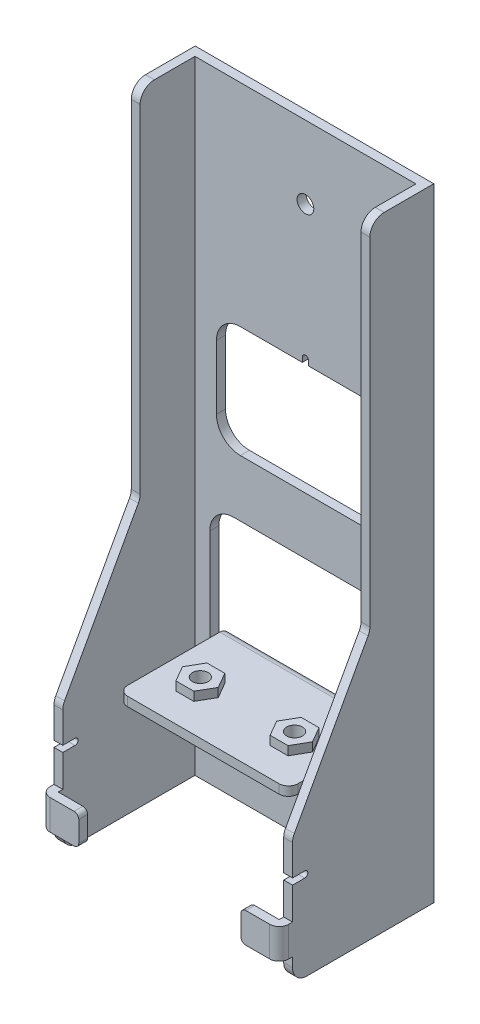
ISO-10303-21;
HEADER;
FILE_DESCRIPTION(('STEP AP214'),'2;1');
FILE_NAME('part.step','',(''),(''),'','','');
FILE_SCHEMA(('AUTOMOTIVE_DESIGN { 1 0 10303 214 1 1 1 1 }'));
ENDSEC;
DATA;
#1=APPLICATION_CONTEXT('core data for automotive mechanical design processes');
#2=APPLICATION_PROTOCOL_DEFINITION('international standard','automotive_design',2000,#1);
#3=PRODUCT_CONTEXT('',#1,'mechanical');
#4=PRODUCT('Part','Part','',(#3));
#5=PRODUCT_RELATED_PRODUCT_CATEGORY('part','',(#4));
#6=PRODUCT_DEFINITION_FORMATION('','',#4);
#7=PRODUCT_DEFINITION_CONTEXT('part definition',#1,'design');
#8=PRODUCT_DEFINITION('design','',#6,#7);
#9=PRODUCT_DEFINITION_SHAPE('','',#8);
#10=(LENGTH_UNIT() NAMED_UNIT(*) SI_UNIT(.MILLI.,.METRE.));
#11=(NAMED_UNIT(*) PLANE_ANGLE_UNIT() SI_UNIT($,.RADIAN.));
#12=(NAMED_UNIT(*) SI_UNIT($,.STERADIAN.) SOLID_ANGLE_UNIT());
#13=UNCERTAINTY_MEASURE_WITH_UNIT(LENGTH_MEASURE(1.E-05),#10,'distance_accuracy_value','');
#14=(GEOMETRIC_REPRESENTATION_CONTEXT(3) GLOBAL_UNCERTAINTY_ASSIGNED_CONTEXT((#13)) GLOBAL_UNIT_ASSIGNED_CONTEXT((#10,
#11,#12)) REPRESENTATION_CONTEXT('',''));
#15=CARTESIAN_POINT('',(0.,0.,0.));
#16=DIRECTION('',(0.,0.,1.));
#17=DIRECTION('',(1.,0.,0.));
#18=AXIS2_PLACEMENT_3D('',#15,#16,#17);
#19=CARTESIAN_POINT('',(0.,2.8,1.9));
#20=DIRECTION('',(0.,0.,1.));
#21=DIRECTION('',(1.,0.,0.));
#22=AXIS2_PLACEMENT_3D('',#19,#20,#21);
#23=PLANE('',#22);
#24=CARTESIAN_POINT('',(0.,115.25,1.9));
#25=DIRECTION('',(0.,0.,1.));
#26=DIRECTION('',(1.,0.,0.));
#27=AXIS2_PLACEMENT_3D('',#24,#25,#26);
#28=CIRCLE('',#27,1.75);
#29=CARTESIAN_POINT('',(-1.75,115.25,1.9));
#30=VERTEX_POINT('',#29);
#31=EDGE_CURVE('E887',#30,#30,#28,.T.);
#32=ORIENTED_EDGE('',*,*,#31,.F.);
#33=EDGE_LOOP('',(#32));
#34=FACE_BOUND('',#33,.T.);
#35=CARTESIAN_POINT('',(-18.05,18.95,1.9));
#36=DIRECTION('',(0.,0.,1.));
#37=DIRECTION('',(1.,0.,0.));
#38=AXIS2_PLACEMENT_3D('',#35,#36,#37);
#39=CIRCLE('',#38,1.75);
#40=CARTESIAN_POINT('',(-19.8,18.95,1.9));
#41=VERTEX_POINT('',#40);
#42=EDGE_CURVE('E1054',#41,#41,#39,.T.);
#43=ORIENTED_EDGE('',*,*,#42,.F.);
#44=EDGE_LOOP('',(#43));
#45=FACE_BOUND('',#44,.T.);
#46=CARTESIAN_POINT('',(18.05,18.95,1.9));
#47=DIRECTION('',(0.,0.,1.));
#48=DIRECTION('',(1.,0.,0.));
#49=AXIS2_PLACEMENT_3D('',#46,#47,#48);
#50=CIRCLE('',#49,1.75);
#51=CARTESIAN_POINT('',(16.3,18.95,1.9));
#52=VERTEX_POINT('',#51);
#53=EDGE_CURVE('E1048',#52,#52,#50,.T.);
#54=ORIENTED_EDGE('',*,*,#53,.F.);
#55=EDGE_LOOP('',(#54));
#56=FACE_BOUND('',#55,.T.);
#57=DIRECTION('',(1.,0.,0.));
#58=VECTOR('',#57,1.);
#59=CARTESIAN_POINT('',(-13.65,62.8,1.9));
#60=LINE('',#59,#58);
#61=CARTESIAN_POINT('',(-13.65,62.8,1.9));
#62=VERTEX_POINT('',#61);
#63=CARTESIAN_POINT('',(13.65,62.8,1.9));
#64=VERTEX_POINT('',#63);
#65=EDGE_CURVE('E895',#62,#64,#60,.T.);
#66=ORIENTED_EDGE('',*,*,#65,.F.);
#67=CARTESIAN_POINT('',(-13.65,67.8,1.9));
#68=DIRECTION('',(0.,0.,1.));
#69=DIRECTION('',(1.,0.,0.));
#70=AXIS2_PLACEMENT_3D('',#67,#68,#69);
#71=CIRCLE('',#70,5.);
#72=CARTESIAN_POINT('',(-18.65,67.8,1.9));
#73=VERTEX_POINT('',#72);
#74=EDGE_CURVE('E893',#73,#62,#71,.T.);
#75=ORIENTED_EDGE('',*,*,#74,.F.);
#76=DIRECTION('',(0.,-1.,0.));
#77=VECTOR('',#76,1.);
#78=CARTESIAN_POINT('',(-18.65,81.2,1.9));
#79=LINE('',#78,#77);
#80=CARTESIAN_POINT('',(-18.65,81.2,1.9));
#81=VERTEX_POINT('',#80);
#82=EDGE_CURVE('E917',#81,#73,#79,.T.);
#83=ORIENTED_EDGE('',*,*,#82,.F.);
#84=CARTESIAN_POINT('',(-13.65,81.2,1.9));
#85=DIRECTION('',(0.,0.,1.));
#86=DIRECTION('',(1.,0.,0.));
#87=AXIS2_PLACEMENT_3D('',#84,#85,#86);
#88=CIRCLE('',#87,5.);
#89=CARTESIAN_POINT('',(-13.65,86.2,1.9));
#90=VERTEX_POINT('',#89);
#91=EDGE_CURVE('E914',#90,#81,#88,.T.);
#92=ORIENTED_EDGE('',*,*,#91,.F.);
#93=DIRECTION('',(-1.,0.,0.));
#94=VECTOR('',#93,1.);
#95=CARTESIAN_POINT('',(-13.65,86.2,1.9));
#96=LINE('',#95,#94);
#97=CARTESIAN_POINT('',(-0.65000000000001,86.2,1.9));
#98=VERTEX_POINT('',#97);
#99=EDGE_CURVE('E912',#98,#90,#96,.T.);
#100=ORIENTED_EDGE('',*,*,#99,.F.);
#101=DIRECTION('',(0.,-1.,0.));
#102=VECTOR('',#101,1.);
#103=CARTESIAN_POINT('',(-0.650000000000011,87.2,1.9));
#104=LINE('',#103,#102);
#105=CARTESIAN_POINT('',(-0.650000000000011,87.2,1.9));
#106=VERTEX_POINT('',#105);
#107=EDGE_CURVE('E910',#106,#98,#104,.T.);
#108=ORIENTED_EDGE('',*,*,#107,.F.);
#109=CARTESIAN_POINT('',(0.,87.2,1.9));
#110=DIRECTION('',(0.,0.,1.));
#111=DIRECTION('',(1.,0.,0.));
#112=AXIS2_PLACEMENT_3D('',#109,#110,#111);
#113=CIRCLE('',#112,0.65);
#114=CARTESIAN_POINT('',(0.649999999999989,87.2,1.9));
#115=VERTEX_POINT('',#114);
#116=EDGE_CURVE('E908',#115,#106,#113,.T.);
#117=ORIENTED_EDGE('',*,*,#116,.F.);
#118=DIRECTION('',(0.,1.,0.));
#119=VECTOR('',#118,1.);
#120=CARTESIAN_POINT('',(0.649999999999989,87.2,1.9));
#121=LINE('',#120,#119);
#122=CARTESIAN_POINT('',(0.64999999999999,86.2,1.9));
#123=VERTEX_POINT('',#122);
#124=EDGE_CURVE('E906',#123,#115,#121,.T.);
#125=ORIENTED_EDGE('',*,*,#124,.F.);
#126=DIRECTION('',(-1.,0.,0.));
#127=VECTOR('',#126,1.);
#128=CARTESIAN_POINT('',(0.64999999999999,86.2,1.9));
#129=LINE('',#128,#127);
#130=CARTESIAN_POINT('',(13.65,86.2,1.9));
#131=VERTEX_POINT('',#130);
#132=EDGE_CURVE('E904',#131,#123,#129,.T.);
#133=ORIENTED_EDGE('',*,*,#132,.F.);
#134=CARTESIAN_POINT('',(13.65,81.2,1.9));
#135=DIRECTION('',(0.,0.,1.));
#136=DIRECTION('',(-1.,0.,0.));
#137=AXIS2_PLACEMENT_3D('',#134,#135,#136);
#138=CIRCLE('',#137,5.);
#139=CARTESIAN_POINT('',(18.65,81.2,1.9));
#140=VERTEX_POINT('',#139);
#141=EDGE_CURVE('E902',#140,#131,#138,.T.);
#142=ORIENTED_EDGE('',*,*,#141,.F.);
#143=DIRECTION('',(0.,1.,0.));
#144=VECTOR('',#143,1.);
#145=CARTESIAN_POINT('',(18.65,81.2,1.9));
#146=LINE('',#145,#144);
#147=CARTESIAN_POINT('',(18.65,67.8,1.9));
#148=VERTEX_POINT('',#147);
#149=EDGE_CURVE('E900',#148,#140,#146,.T.);
#150=ORIENTED_EDGE('',*,*,#149,.F.);
#151=CARTESIAN_POINT('',(13.65,67.8,1.9));
#152=DIRECTION('',(0.,0.,1.));
#153=DIRECTION('',(1.,0.,0.));
#154=AXIS2_PLACEMENT_3D('',#151,#152,#153);
#155=CIRCLE('',#154,5.);
#156=EDGE_CURVE('E898',#64,#148,#155,.T.);
#157=ORIENTED_EDGE('',*,*,#156,.F.);
#158=EDGE_LOOP('',(#66,#75,#83,#92,#100,#108,#117,#125,#133,#142,#150,#157));
#159=FACE_BOUND('',#158,.T.);
#160=DIRECTION('',(0.,-1.,0.));
#161=VECTOR('',#160,1.);
#162=CARTESIAN_POINT('',(17.85,26.,1.9));
#163=LINE('',#162,#161);
#164=CARTESIAN_POINT('',(17.85,26.6,1.9));
#165=VERTEX_POINT('',#164);
#166=CARTESIAN_POINT('',(17.85,26.,1.9));
#167=VERTEX_POINT('',#166);
#168=EDGE_CURVE('E980',#165,#167,#163,.T.);
#169=ORIENTED_EDGE('',*,*,#168,.F.);
#170=DIRECTION('',(1.,0.,0.));
#171=VECTOR('',#170,1.);
#172=CARTESIAN_POINT('',(0.,26.6,1.9));
#173=LINE('',#172,#171);
#174=CARTESIAN_POINT('',(-17.85,26.6,1.9));
#175=VERTEX_POINT('',#174);
#176=EDGE_CURVE('E1132',#165,#175,#173,.F.);
#177=ORIENTED_EDGE('',*,*,#176,.T.);
#178=DIRECTION('',(0.,1.,0.));
#179=VECTOR('',#178,1.);
#180=CARTESIAN_POINT('',(-17.85,26.,1.9));
#181=LINE('',#180,#179);
#182=CARTESIAN_POINT('',(-17.85,26.,1.9));
#183=VERTEX_POINT('',#182);
#184=EDGE_CURVE('E997',#183,#175,#181,.T.);
#185=ORIENTED_EDGE('',*,*,#184,.F.);
#186=CARTESIAN_POINT('',(-18.95,26.,1.9));
#187=DIRECTION('',(0.,0.,1.));
#188=DIRECTION('',(1.,0.,0.));
#189=AXIS2_PLACEMENT_3D('',#186,#187,#188);
#190=CIRCLE('',#189,1.1);
#191=CARTESIAN_POINT('',(-20.05,26.,1.9));
#192=VERTEX_POINT('',#191);
#193=EDGE_CURVE('E995',#192,#183,#190,.T.);
#194=ORIENTED_EDGE('',*,*,#193,.F.);
#195=DIRECTION('',(0.,-1.,0.));
#196=VECTOR('',#195,1.);
#197=CARTESIAN_POINT('',(-20.05,45.9,1.9));
#198=LINE('',#197,#196);
#199=CARTESIAN_POINT('',(-20.05,45.9,1.9));
#200=VERTEX_POINT('',#199);
#201=EDGE_CURVE('E993',#200,#192,#198,.T.);
#202=ORIENTED_EDGE('',*,*,#201,.F.);
#203=CARTESIAN_POINT('',(-15.05,45.9,1.9));
#204=DIRECTION('',(0.,0.,1.));
#205=DIRECTION('',(1.,0.,0.));
#206=AXIS2_PLACEMENT_3D('',#203,#204,#205);
#207=CIRCLE('',#206,5.);
#208=CARTESIAN_POINT('',(-15.05,50.9,1.9));
#209=VERTEX_POINT('',#208);
#210=EDGE_CURVE('E991',#209,#200,#207,.T.);
#211=ORIENTED_EDGE('',*,*,#210,.F.);
#212=DIRECTION('',(-1.,0.,0.));
#213=VECTOR('',#212,1.);
#214=CARTESIAN_POINT('',(-15.05,50.9,1.9));
#215=LINE('',#214,#213);
#216=CARTESIAN_POINT('',(15.05,50.9,1.9));
#217=VERTEX_POINT('',#216);
#218=EDGE_CURVE('E989',#217,#209,#215,.T.);
#219=ORIENTED_EDGE('',*,*,#218,.F.);
#220=CARTESIAN_POINT('',(15.05,45.9,1.9));
#221=DIRECTION('',(0.,0.,1.));
#222=DIRECTION('',(-1.,0.,0.));
#223=AXIS2_PLACEMENT_3D('',#220,#221,#222);
#224=CIRCLE('',#223,5.);
#225=CARTESIAN_POINT('',(20.05,45.9,1.9));
#226=VERTEX_POINT('',#225);
#227=EDGE_CURVE('E987',#226,#217,#224,.T.);
#228=ORIENTED_EDGE('',*,*,#227,.F.);
#229=DIRECTION('',(0.,1.,0.));
#230=VECTOR('',#229,1.);
#231=CARTESIAN_POINT('',(20.05,45.9,1.9));
#232=LINE('',#231,#230);
#233=CARTESIAN_POINT('',(20.05,26.,1.9));
#234=VERTEX_POINT('',#233);
#235=EDGE_CURVE('E985',#234,#226,#232,.T.);
#236=ORIENTED_EDGE('',*,*,#235,.F.);
#237=CARTESIAN_POINT('',(18.95,26.,1.9));
#238=DIRECTION('',(0.,0.,1.));
#239=DIRECTION('',(1.,0.,0.));
#240=AXIS2_PLACEMENT_3D('',#237,#238,#239);
#241=CIRCLE('',#240,1.1);
#242=EDGE_CURVE('E982',#167,#234,#241,.T.);
#243=ORIENTED_EDGE('',*,*,#242,.F.);
#244=EDGE_LOOP('',(#169,#177,#185,#194,#202,#211,#219,#228,#236,#243));
#245=FACE_BOUND('',#244,.T.);
#246=DIRECTION('',(1.,0.,0.));
#247=VECTOR('',#246,1.);
#248=CARTESIAN_POINT('',(25.,0.,1.9));
#249=LINE('',#248,#247);
#250=CARTESIAN_POINT('',(2.5,0.,1.9));
#251=VERTEX_POINT('',#250);
#252=CARTESIAN_POINT('',(23.15,0.,1.9));
#253=VERTEX_POINT('',#252);
#254=EDGE_CURVE('E1069',#251,#253,#249,.T.);
#255=ORIENTED_EDGE('',*,*,#254,.T.);
#256=DIRECTION('',(0.,1.,0.));
#257=VECTOR('',#256,1.);
#258=CARTESIAN_POINT('',(23.15,2.8,1.9));
#259=LINE('',#258,#257);
#260=CARTESIAN_POINT('',(23.15,130.5,1.9));
#261=VERTEX_POINT('',#260);
#262=EDGE_CURVE('E665',#253,#261,#259,.T.);
#263=ORIENTED_EDGE('',*,*,#262,.T.);
#264=DIRECTION('',(-1.,0.,0.));
#265=VECTOR('',#264,1.);
#266=CARTESIAN_POINT('',(-25.,130.5,1.9));
#267=LINE('',#266,#265);
#268=CARTESIAN_POINT('',(-23.15,130.5,1.9));
#269=VERTEX_POINT('',#268);
#270=EDGE_CURVE('E1071',#261,#269,#267,.T.);
#271=ORIENTED_EDGE('',*,*,#270,.T.);
#272=DIRECTION('',(0.,-1.,0.));
#273=VECTOR('',#272,1.);
#274=CARTESIAN_POINT('',(-23.15,2.8,1.9));
#275=LINE('',#274,#273);
#276=CARTESIAN_POINT('',(-23.15,0.,1.9));
#277=VERTEX_POINT('',#276);
#278=EDGE_CURVE('E759',#269,#277,#275,.T.);
#279=ORIENTED_EDGE('',*,*,#278,.T.);
#280=DIRECTION('',(1.,0.,0.));
#281=VECTOR('',#280,1.);
#282=CARTESIAN_POINT('',(-2.5,0.,1.9));
#283=LINE('',#282,#281);
#284=CARTESIAN_POINT('',(-2.5,0.,1.9));
#285=VERTEX_POINT('',#284);
#286=EDGE_CURVE('E1060',#277,#285,#283,.T.);
#287=ORIENTED_EDGE('',*,*,#286,.T.);
#288=DIRECTION('',(0.,1.,0.));
#289=VECTOR('',#288,1.);
#290=CARTESIAN_POINT('',(-2.5,2.8,1.9));
#291=LINE('',#290,#289);
#292=CARTESIAN_POINT('',(-2.5,2.8,1.9));
#293=VERTEX_POINT('',#292);
#294=EDGE_CURVE('E1062',#285,#293,#291,.T.);
#295=ORIENTED_EDGE('',*,*,#294,.T.);
#296=CARTESIAN_POINT('',(0.,2.8,1.9));
#297=DIRECTION('',(0.,0.,-1.));
#298=DIRECTION('',(1.,0.,0.));
#299=AXIS2_PLACEMENT_3D('',#296,#297,#298);
#300=CIRCLE('',#299,2.5);
#301=CARTESIAN_POINT('',(2.5,2.8,1.9));
#302=VERTEX_POINT('',#301);
#303=EDGE_CURVE('E1065',#293,#302,#300,.T.);
#304=ORIENTED_EDGE('',*,*,#303,.T.);
#305=DIRECTION('',(0.,-1.,0.));
#306=VECTOR('',#305,1.);
#307=CARTESIAN_POINT('',(2.5,2.8,1.9));
#308=LINE('',#307,#306);
#309=EDGE_CURVE('E1067',#302,#251,#308,.T.);
#310=ORIENTED_EDGE('',*,*,#309,.T.);
#311=EDGE_LOOP('',(#255,#263,#271,#279,#287,#295,#304,#310));
#312=FACE_BOUND('',#311,.T.);
#313=ADVANCED_FACE('F37',(#34,#45,#56,#159,#245,#312),#23,.T.);
#314=CARTESIAN_POINT('',(-17.85,28.7,1.9));
#315=DIRECTION('',(0.,1.,0.));
#316=DIRECTION('',(0.,0.,1.));
#317=AXIS2_PLACEMENT_3D('',#314,#315,#316);
#318=PLANE('',#317);
#319=DIRECTION('',(0.5,0.,0.866025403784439));
#320=VECTOR('',#319,1.);
#321=CARTESIAN_POINT('',(6.12222325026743,28.7,14.05));
#322=LINE('',#321,#320);
#323=CARTESIAN_POINT('',(6.12222325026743,28.7,14.05));
#324=VERTEX_POINT('',#323);
#325=CARTESIAN_POINT('',(7.99861162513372,28.7,17.3));
#326=VERTEX_POINT('',#325);
#327=EDGE_CURVE('E849',#324,#326,#322,.T.);
#328=ORIENTED_EDGE('',*,*,#327,.F.);
#329=DIRECTION('',(-0.5,0.,0.866025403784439));
#330=VECTOR('',#329,1.);
#331=CARTESIAN_POINT('',(7.99861162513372,28.7,10.8));
#332=LINE('',#331,#330);
#333=CARTESIAN_POINT('',(7.99861162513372,28.7,10.8));
#334=VERTEX_POINT('',#333);
#335=EDGE_CURVE('E831',#334,#324,#332,.T.);
#336=ORIENTED_EDGE('',*,*,#335,.F.);
#337=DIRECTION('',(-1.,0.,0.));
#338=VECTOR('',#337,1.);
#339=CARTESIAN_POINT('',(11.7513883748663,28.7,10.8));
#340=LINE('',#339,#338);
#341=CARTESIAN_POINT('',(11.7513883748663,28.7,10.8));
#342=VERTEX_POINT('',#341);
#343=EDGE_CURVE('E836',#342,#334,#340,.T.);
#344=ORIENTED_EDGE('',*,*,#343,.F.);
#345=DIRECTION('',(-0.5,0.,-0.866025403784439));
#346=VECTOR('',#345,1.);
#347=CARTESIAN_POINT('',(13.6277767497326,28.7,14.05));
#348=LINE('',#347,#346);
#349=CARTESIAN_POINT('',(13.6277767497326,28.7,14.05));
#350=VERTEX_POINT('',#349);
#351=EDGE_CURVE('E855',#350,#342,#348,.T.);
#352=ORIENTED_EDGE('',*,*,#351,.F.);
#353=DIRECTION('',(0.5,0.,-0.866025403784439));
#354=VECTOR('',#353,1.);
#355=CARTESIAN_POINT('',(11.7513883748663,28.7,17.3));
#356=LINE('',#355,#354);
#357=CARTESIAN_POINT('',(11.7513883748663,28.7,17.3));
#358=VERTEX_POINT('',#357);
#359=EDGE_CURVE('E853',#358,#350,#356,.T.);
#360=ORIENTED_EDGE('',*,*,#359,.F.);
#361=DIRECTION('',(1.,0.,0.));
#362=VECTOR('',#361,1.);
#363=CARTESIAN_POINT('',(7.99861162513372,28.7,17.3));
#364=LINE('',#363,#362);
#365=EDGE_CURVE('E851',#326,#358,#364,.T.);
#366=ORIENTED_EDGE('',*,*,#365,.F.);
#367=EDGE_LOOP('',(#328,#336,#344,#352,#360,#366));
#368=FACE_BOUND('',#367,.T.);
#369=DIRECTION('',(0.,0.,-1.));
#370=VECTOR('',#369,1.);
#371=CARTESIAN_POINT('',(17.85,28.7,1.9));
#372=LINE('',#371,#370);
#373=CARTESIAN_POINT('',(17.85,28.7,21.3));
#374=VERTEX_POINT('',#373);
#375=CARTESIAN_POINT('',(17.85,28.7,2.));
#376=VERTEX_POINT('',#375);
#377=EDGE_CURVE('E1000',#374,#376,#372,.T.);
#378=ORIENTED_EDGE('',*,*,#377,.T.);
#379=DIRECTION('',(1.,0.,0.));
#380=VECTOR('',#379,1.);
#381=CARTESIAN_POINT('',(-17.85,28.7,2.));
#382=LINE('',#381,#380);
#383=CARTESIAN_POINT('',(-17.85,28.7,2.));
#384=VERTEX_POINT('',#383);
#385=EDGE_CURVE('E1143',#376,#384,#382,.F.);
#386=ORIENTED_EDGE('',*,*,#385,.T.);
#387=DIRECTION('',(0.,0.,-1.));
#388=VECTOR('',#387,1.);
#389=CARTESIAN_POINT('',(-17.85,28.7,1.9));
#390=LINE('',#389,#388);
#391=CARTESIAN_POINT('',(-17.85,28.7,21.3));
#392=VERTEX_POINT('',#391);
#393=EDGE_CURVE('E1027',#392,#384,#390,.T.);
#394=ORIENTED_EDGE('',*,*,#393,.F.);
#395=CARTESIAN_POINT('',(-15.85,28.7,21.3));
#396=DIRECTION('',(0.,1.,0.));
#397=DIRECTION('',(0.,0.,1.));
#398=AXIS2_PLACEMENT_3D('',#395,#396,#397);
#399=CIRCLE('',#398,2.);
#400=CARTESIAN_POINT('',(-15.85,28.7,23.3));
#401=VERTEX_POINT('',#400);
#402=EDGE_CURVE('E1117',#392,#401,#399,.T.);
#403=ORIENTED_EDGE('',*,*,#402,.T.);
#404=DIRECTION('',(-1.,0.,0.));
#405=VECTOR('',#404,1.);
#406=CARTESIAN_POINT('',(-17.85,28.7,23.3));
#407=LINE('',#406,#405);
#408=CARTESIAN_POINT('',(15.85,28.7,23.3));
#409=VERTEX_POINT('',#408);
#410=EDGE_CURVE('E877',#409,#401,#407,.T.);
#411=ORIENTED_EDGE('',*,*,#410,.F.);
#412=CARTESIAN_POINT('',(15.85,28.7,21.3));
#413=DIRECTION('',(0.,1.,0.));
#414=DIRECTION('',(0.,0.,1.));
#415=AXIS2_PLACEMENT_3D('',#412,#413,#414);
#416=CIRCLE('',#415,2.);
#417=EDGE_CURVE('E1119',#409,#374,#416,.T.);
#418=ORIENTED_EDGE('',*,*,#417,.T.);
#419=EDGE_LOOP('',(#378,#386,#394,#403,#411,#418));
#420=FACE_BOUND('',#419,.T.);
#421=DIRECTION('',(-0.5,0.,-0.866025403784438));
#422=VECTOR('',#421,1.);
#423=CARTESIAN_POINT('',(-6.12222325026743,28.7,14.05));
#424=LINE('',#423,#422);
#425=CARTESIAN_POINT('',(-6.12222325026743,28.7,14.05));
#426=VERTEX_POINT('',#425);
#427=CARTESIAN_POINT('',(-7.99861162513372,28.7,10.8));
#428=VERTEX_POINT('',#427);
#429=EDGE_CURVE('E806',#426,#428,#424,.T.);
#430=ORIENTED_EDGE('',*,*,#429,.F.);
#431=DIRECTION('',(0.500000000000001,0.,-0.866025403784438));
#432=VECTOR('',#431,1.);
#433=CARTESIAN_POINT('',(-7.99861162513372,28.7,17.3));
#434=LINE('',#433,#432);
#435=CARTESIAN_POINT('',(-7.99861162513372,28.7,17.3));
#436=VERTEX_POINT('',#435);
#437=EDGE_CURVE('E803',#436,#426,#434,.T.);
#438=ORIENTED_EDGE('',*,*,#437,.F.);
#439=DIRECTION('',(1.,0.,0.));
#440=VECTOR('',#439,1.);
#441=CARTESIAN_POINT('',(-11.7513883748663,28.7,17.3));
#442=LINE('',#441,#440);
#443=CARTESIAN_POINT('',(-11.7513883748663,28.7,17.3));
#444=VERTEX_POINT('',#443);
#445=EDGE_CURVE('E792',#444,#436,#442,.T.);
#446=ORIENTED_EDGE('',*,*,#445,.F.);
#447=DIRECTION('',(0.5,0.,0.866025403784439));
#448=VECTOR('',#447,1.);
#449=CARTESIAN_POINT('',(-13.6277767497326,28.7,14.05));
#450=LINE('',#449,#448);
#451=CARTESIAN_POINT('',(-13.6277767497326,28.7,14.05));
#452=VERTEX_POINT('',#451);
#453=EDGE_CURVE('E812',#452,#444,#450,.T.);
#454=ORIENTED_EDGE('',*,*,#453,.F.);
#455=DIRECTION('',(-0.5,0.,0.866025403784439));
#456=VECTOR('',#455,1.);
#457=CARTESIAN_POINT('',(-11.7513883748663,28.7,10.8));
#458=LINE('',#457,#456);
#459=CARTESIAN_POINT('',(-11.7513883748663,28.7,10.8));
#460=VERTEX_POINT('',#459);
#461=EDGE_CURVE('E810',#460,#452,#458,.T.);
#462=ORIENTED_EDGE('',*,*,#461,.F.);
#463=DIRECTION('',(-1.,0.,0.));
#464=VECTOR('',#463,1.);
#465=CARTESIAN_POINT('',(-7.99861162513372,28.7,10.8));
#466=LINE('',#465,#464);
#467=EDGE_CURVE('E808',#428,#460,#466,.T.);
#468=ORIENTED_EDGE('',*,*,#467,.F.);
#469=EDGE_LOOP('',(#430,#438,#446,#454,#462,#468));
#470=FACE_BOUND('',#469,.T.);
#471=ADVANCED_FACE('F1440',(#368,#420,#470),#318,.T.);
#472=CARTESIAN_POINT('',(0.,2.8,0.));
#473=DIRECTION('',(0.,0.,1.));
#474=DIRECTION('',(1.,0.,0.));
#475=AXIS2_PLACEMENT_3D('',#472,#473,#474);
#476=PLANE('',#475);
#477=DIRECTION('',(0.,1.,0.));
#478=VECTOR('',#477,1.);
#479=CARTESIAN_POINT('',(25.,130.5,0.));
#480=LINE('',#479,#478);
#481=CARTESIAN_POINT('',(25.,0.,0.));
#482=VERTEX_POINT('',#481);
#483=CARTESIAN_POINT('',(25.,130.5,0.));
#484=VERTEX_POINT('',#483);
#485=EDGE_CURVE('E1084',#482,#484,#480,.T.);
#486=ORIENTED_EDGE('',*,*,#485,.F.);
#487=DIRECTION('',(1.,0.,0.));
#488=VECTOR('',#487,1.);
#489=CARTESIAN_POINT('',(25.,0.,0.));
#490=LINE('',#489,#488);
#491=CARTESIAN_POINT('',(2.5,0.,0.));
#492=VERTEX_POINT('',#491);
#493=EDGE_CURVE('E1081',#492,#482,#490,.T.);
#494=ORIENTED_EDGE('',*,*,#493,.F.);
#495=DIRECTION('',(0.,-1.,0.));
#496=VECTOR('',#495,1.);
#497=CARTESIAN_POINT('',(2.5,2.8,0.));
#498=LINE('',#497,#496);
#499=CARTESIAN_POINT('',(2.5,2.8,0.));
#500=VERTEX_POINT('',#499);
#501=EDGE_CURVE('E1079',#500,#492,#498,.T.);
#502=ORIENTED_EDGE('',*,*,#501,.F.);
#503=CARTESIAN_POINT('',(0.,2.8,0.));
#504=DIRECTION('',(0.,0.,-1.));
#505=DIRECTION('',(1.,0.,0.));
#506=AXIS2_PLACEMENT_3D('',#503,#504,#505);
#507=CIRCLE('',#506,2.5);
#508=CARTESIAN_POINT('',(-2.5,2.8,0.));
#509=VERTEX_POINT('',#508);
#510=EDGE_CURVE('E1077',#509,#500,#507,.T.);
#511=ORIENTED_EDGE('',*,*,#510,.F.);
#512=DIRECTION('',(0.,1.,0.));
#513=VECTOR('',#512,1.);
#514=CARTESIAN_POINT('',(-2.5,2.8,0.));
#515=LINE('',#514,#513);
#516=CARTESIAN_POINT('',(-2.5,0.,0.));
#517=VERTEX_POINT('',#516);
#518=EDGE_CURVE('E1075',#517,#509,#515,.T.);
#519=ORIENTED_EDGE('',*,*,#518,.F.);
#520=DIRECTION('',(1.,0.,0.));
#521=VECTOR('',#520,1.);
#522=CARTESIAN_POINT('',(-2.5,0.,0.));
#523=LINE('',#522,#521);
#524=CARTESIAN_POINT('',(-25.,0.,0.));
#525=VERTEX_POINT('',#524);
#526=EDGE_CURVE('E1057',#525,#517,#523,.T.);
#527=ORIENTED_EDGE('',*,*,#526,.F.);
#528=DIRECTION('',(0.,-1.,0.));
#529=VECTOR('',#528,1.);
#530=CARTESIAN_POINT('',(-25.,0.,0.));
#531=LINE('',#530,#529);
#532=CARTESIAN_POINT('',(-25.,130.5,0.));
#533=VERTEX_POINT('',#532);
#534=EDGE_CURVE('E1063',#533,#525,#531,.T.);
#535=ORIENTED_EDGE('',*,*,#534,.F.);
#536=DIRECTION('',(-1.,0.,0.));
#537=VECTOR('',#536,1.);
#538=CARTESIAN_POINT('',(-25.,130.5,0.));
#539=LINE('',#538,#537);
#540=EDGE_CURVE('E1087',#484,#533,#539,.T.);
#541=ORIENTED_EDGE('',*,*,#540,.F.);
#542=EDGE_LOOP('',(#486,#494,#502,#511,#519,#527,#535,#541));
#543=FACE_BOUND('',#542,.T.);
#544=CARTESIAN_POINT('',(-13.65,67.8,0.));
#545=DIRECTION('',(0.,0.,1.));
#546=DIRECTION('',(1.,0.,0.));
#547=AXIS2_PLACEMENT_3D('',#544,#545,#546);
#548=CIRCLE('',#547,5.);
#549=CARTESIAN_POINT('',(-18.65,67.8,0.));
#550=VERTEX_POINT('',#549);
#551=CARTESIAN_POINT('',(-13.65,62.8,0.));
#552=VERTEX_POINT('',#551);
#553=EDGE_CURVE('E890',#550,#552,#548,.T.);
#554=ORIENTED_EDGE('',*,*,#553,.T.);
#555=DIRECTION('',(1.,0.,0.));
#556=VECTOR('',#555,1.);
#557=CARTESIAN_POINT('',(-13.65,62.8,0.));
#558=LINE('',#557,#556);
#559=CARTESIAN_POINT('',(13.65,62.8,0.));
#560=VERTEX_POINT('',#559);
#561=EDGE_CURVE('E922',#552,#560,#558,.T.);
#562=ORIENTED_EDGE('',*,*,#561,.T.);
#563=CARTESIAN_POINT('',(13.65,67.8,0.));
#564=DIRECTION('',(0.,0.,1.));
#565=DIRECTION('',(1.,0.,0.));
#566=AXIS2_PLACEMENT_3D('',#563,#564,#565);
#567=CIRCLE('',#566,5.);
#568=CARTESIAN_POINT('',(18.65,67.8,0.));
#569=VERTEX_POINT('',#568);
#570=EDGE_CURVE('E925',#560,#569,#567,.T.);
#571=ORIENTED_EDGE('',*,*,#570,.T.);
#572=DIRECTION('',(0.,1.,0.));
#573=VECTOR('',#572,1.);
#574=CARTESIAN_POINT('',(18.65,81.2,0.));
#575=LINE('',#574,#573);
#576=CARTESIAN_POINT('',(18.65,81.2,0.));
#577=VERTEX_POINT('',#576);
#578=EDGE_CURVE('E928',#569,#577,#575,.T.);
#579=ORIENTED_EDGE('',*,*,#578,.T.);
#580=CARTESIAN_POINT('',(13.65,81.2,0.));
#581=DIRECTION('',(0.,0.,1.));
#582=DIRECTION('',(-1.,0.,0.));
#583=AXIS2_PLACEMENT_3D('',#580,#581,#582);
#584=CIRCLE('',#583,5.);
#585=CARTESIAN_POINT('',(13.65,86.2,0.));
#586=VERTEX_POINT('',#585);
#587=EDGE_CURVE('E931',#577,#586,#584,.T.);
#588=ORIENTED_EDGE('',*,*,#587,.T.);
#589=DIRECTION('',(-1.,0.,0.));
#590=VECTOR('',#589,1.);
#591=CARTESIAN_POINT('',(0.64999999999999,86.2,0.));
#592=LINE('',#591,#590);
#593=CARTESIAN_POINT('',(0.64999999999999,86.2,0.));
#594=VERTEX_POINT('',#593);
#595=EDGE_CURVE('E934',#586,#594,#592,.T.);
#596=ORIENTED_EDGE('',*,*,#595,.T.);
#597=DIRECTION('',(0.,1.,0.));
#598=VECTOR('',#597,1.);
#599=CARTESIAN_POINT('',(0.649999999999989,87.2,0.));
#600=LINE('',#599,#598);
#601=CARTESIAN_POINT('',(0.649999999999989,87.2,0.));
#602=VERTEX_POINT('',#601);
#603=EDGE_CURVE('E937',#594,#602,#600,.T.);
#604=ORIENTED_EDGE('',*,*,#603,.T.);
#605=CARTESIAN_POINT('',(0.,87.2,0.));
#606=DIRECTION('',(0.,0.,1.));
#607=DIRECTION('',(1.,0.,0.));
#608=AXIS2_PLACEMENT_3D('',#605,#606,#607);
#609=CIRCLE('',#608,0.65);
#610=CARTESIAN_POINT('',(-0.650000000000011,87.2,0.));
#611=VERTEX_POINT('',#610);
#612=EDGE_CURVE('E940',#602,#611,#609,.T.);
#613=ORIENTED_EDGE('',*,*,#612,.T.);
#614=DIRECTION('',(0.,-1.,0.));
#615=VECTOR('',#614,1.);
#616=CARTESIAN_POINT('',(-0.650000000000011,87.2,0.));
#617=LINE('',#616,#615);
#618=CARTESIAN_POINT('',(-0.65000000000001,86.2,0.));
#619=VERTEX_POINT('',#618);
#620=EDGE_CURVE('E943',#611,#619,#617,.T.);
#621=ORIENTED_EDGE('',*,*,#620,.T.);
#622=DIRECTION('',(-1.,0.,0.));
#623=VECTOR('',#622,1.);
#624=CARTESIAN_POINT('',(-13.65,86.2,0.));
#625=LINE('',#624,#623);
#626=CARTESIAN_POINT('',(-13.65,86.2,0.));
#627=VERTEX_POINT('',#626);
#628=EDGE_CURVE('E946',#619,#627,#625,.T.);
#629=ORIENTED_EDGE('',*,*,#628,.T.);
#630=CARTESIAN_POINT('',(-13.65,81.2,0.));
#631=DIRECTION('',(0.,0.,1.));
#632=DIRECTION('',(1.,0.,0.));
#633=AXIS2_PLACEMENT_3D('',#630,#631,#632);
#634=CIRCLE('',#633,5.);
#635=CARTESIAN_POINT('',(-18.65,81.2,0.));
#636=VERTEX_POINT('',#635);
#637=EDGE_CURVE('E949',#627,#636,#634,.T.);
#638=ORIENTED_EDGE('',*,*,#637,.T.);
#639=DIRECTION('',(0.,-1.,0.));
#640=VECTOR('',#639,1.);
#641=CARTESIAN_POINT('',(-18.65,81.2,0.));
#642=LINE('',#641,#640);
#643=EDGE_CURVE('E896',#636,#550,#642,.T.);
#644=ORIENTED_EDGE('',*,*,#643,.T.);
#645=EDGE_LOOP('',(#554,#562,#571,#579,#588,#596,#604,#613,#621,#629,#638,#644));
#646=FACE_BOUND('',#645,.T.);
#647=CARTESIAN_POINT('',(18.05,18.95,0.));
#648=DIRECTION('',(0.,0.,1.));
#649=DIRECTION('',(1.,0.,0.));
#650=AXIS2_PLACEMENT_3D('',#647,#648,#649);
#651=CIRCLE('',#650,1.75);
#652=CARTESIAN_POINT('',(16.3,18.95,0.));
#653=VERTEX_POINT('',#652);
#654=EDGE_CURVE('E1047',#653,#653,#651,.T.);
#655=ORIENTED_EDGE('',*,*,#654,.T.);
#656=EDGE_LOOP('',(#655));
#657=FACE_BOUND('',#656,.T.);
#658=CARTESIAN_POINT('',(-18.05,18.95,0.));
#659=DIRECTION('',(0.,0.,1.));
#660=DIRECTION('',(1.,0.,0.));
#661=AXIS2_PLACEMENT_3D('',#658,#659,#660);
#662=CIRCLE('',#661,1.75);
#663=CARTESIAN_POINT('',(-19.8,18.95,0.));
#664=VERTEX_POINT('',#663);
#665=EDGE_CURVE('E1051',#664,#664,#662,.T.);
#666=ORIENTED_EDGE('',*,*,#665,.T.);
#667=EDGE_LOOP('',(#666));
#668=FACE_BOUND('',#667,.T.);
#669=DIRECTION('',(0.,1.,0.));
#670=VECTOR('',#669,1.);
#671=CARTESIAN_POINT('',(-17.85,26.,0.));
#672=LINE('',#671,#670);
#673=CARTESIAN_POINT('',(-17.85,26.,0.));
#674=VERTEX_POINT('',#673);
#675=CARTESIAN_POINT('',(-17.85,26.7,0.));
#676=VERTEX_POINT('',#675);
#677=EDGE_CURVE('E983',#674,#676,#672,.T.);
#678=ORIENTED_EDGE('',*,*,#677,.T.);
#679=DIRECTION('',(1.,0.,0.));
#680=VECTOR('',#679,1.);
#681=CARTESIAN_POINT('',(17.85,26.7,0.));
#682=LINE('',#681,#680);
#683=CARTESIAN_POINT('',(17.85,26.7,0.));
#684=VERTEX_POINT('',#683);
#685=EDGE_CURVE('E1138',#676,#684,#682,.T.);
#686=ORIENTED_EDGE('',*,*,#685,.T.);
#687=DIRECTION('',(0.,-1.,0.));
#688=VECTOR('',#687,1.);
#689=CARTESIAN_POINT('',(17.85,26.,0.));
#690=LINE('',#689,#688);
#691=CARTESIAN_POINT('',(17.85,26.,0.));
#692=VERTEX_POINT('',#691);
#693=EDGE_CURVE('E979',#684,#692,#690,.T.);
#694=ORIENTED_EDGE('',*,*,#693,.T.);
#695=CARTESIAN_POINT('',(18.95,26.,0.));
#696=DIRECTION('',(0.,0.,1.));
#697=DIRECTION('',(1.,0.,0.));
#698=AXIS2_PLACEMENT_3D('',#695,#696,#697);
#699=CIRCLE('',#698,1.1);
#700=CARTESIAN_POINT('',(20.05,26.,0.));
#701=VERTEX_POINT('',#700);
#702=EDGE_CURVE('E1002',#692,#701,#699,.T.);
#703=ORIENTED_EDGE('',*,*,#702,.T.);
#704=DIRECTION('',(0.,1.,0.));
#705=VECTOR('',#704,1.);
#706=CARTESIAN_POINT('',(20.05,45.9,0.));
#707=LINE('',#706,#705);
#708=CARTESIAN_POINT('',(20.05,45.9,0.));
#709=VERTEX_POINT('',#708);
#710=EDGE_CURVE('E1005',#701,#709,#707,.T.);
#711=ORIENTED_EDGE('',*,*,#710,.T.);
#712=CARTESIAN_POINT('',(15.05,45.9,0.));
#713=DIRECTION('',(0.,0.,1.));
#714=DIRECTION('',(-1.,0.,0.));
#715=AXIS2_PLACEMENT_3D('',#712,#713,#714);
#716=CIRCLE('',#715,5.);
#717=CARTESIAN_POINT('',(15.05,50.9,0.));
#718=VERTEX_POINT('',#717);
#719=EDGE_CURVE('E1008',#709,#718,#716,.T.);
#720=ORIENTED_EDGE('',*,*,#719,.T.);
#721=DIRECTION('',(-1.,0.,0.));
#722=VECTOR('',#721,1.);
#723=CARTESIAN_POINT('',(-15.05,50.9,0.));
#724=LINE('',#723,#722);
#725=CARTESIAN_POINT('',(-15.05,50.9,0.));
#726=VERTEX_POINT('',#725);
#727=EDGE_CURVE('E1011',#718,#726,#724,.T.);
#728=ORIENTED_EDGE('',*,*,#727,.T.);
#729=CARTESIAN_POINT('',(-15.05,45.9,0.));
#730=DIRECTION('',(0.,0.,1.));
#731=DIRECTION('',(1.,0.,0.));
#732=AXIS2_PLACEMENT_3D('',#729,#730,#731);
#733=CIRCLE('',#732,5.);
#734=CARTESIAN_POINT('',(-20.05,45.9,0.));
#735=VERTEX_POINT('',#734);
#736=EDGE_CURVE('E1014',#726,#735,#733,.T.);
#737=ORIENTED_EDGE('',*,*,#736,.T.);
#738=DIRECTION('',(0.,-1.,0.));
#739=VECTOR('',#738,1.);
#740=CARTESIAN_POINT('',(-20.05,45.9,0.));
#741=LINE('',#740,#739);
#742=CARTESIAN_POINT('',(-20.05,26.,0.));
#743=VERTEX_POINT('',#742);
#744=EDGE_CURVE('E1017',#735,#743,#741,.T.);
#745=ORIENTED_EDGE('',*,*,#744,.T.);
#746=CARTESIAN_POINT('',(-18.95,26.,0.));
#747=DIRECTION('',(0.,0.,1.));
#748=DIRECTION('',(1.,0.,0.));
#749=AXIS2_PLACEMENT_3D('',#746,#747,#748);
#750=CIRCLE('',#749,1.1);
#751=EDGE_CURVE('E1020',#743,#674,#750,.T.);
#752=ORIENTED_EDGE('',*,*,#751,.T.);
#753=EDGE_LOOP('',(#678,#686,#694,#703,#711,#720,#728,#737,#745,#752));
#754=FACE_BOUND('',#753,.T.);
#755=CARTESIAN_POINT('',(0.,115.25,0.));
#756=DIRECTION('',(0.,0.,1.));
#757=DIRECTION('',(1.,0.,0.));
#758=AXIS2_PLACEMENT_3D('',#755,#756,#757);
#759=CIRCLE('',#758,1.75);
#760=CARTESIAN_POINT('',(-1.75,115.25,0.));
#761=VERTEX_POINT('',#760);
#762=EDGE_CURVE('E886',#761,#761,#759,.T.);
#763=ORIENTED_EDGE('',*,*,#762,.T.);
#764=EDGE_LOOP('',(#763));
#765=FACE_BOUND('',#764,.T.);
#766=ADVANCED_FACE('F1327',(#543,#646,#657,#668,#754,#765),#476,.F.);
#767=CARTESIAN_POINT('',(-2.5,0.,1.9));
#768=DIRECTION('',(0.,1.,0.));
#769=DIRECTION('',(-1.,0.,0.));
#770=AXIS2_PLACEMENT_3D('',#767,#768,#769);
#771=PLANE('',#770);
#772=DIRECTION('',(0.,0.,1.));
#773=VECTOR('',#772,1.);
#774=CARTESIAN_POINT('',(-23.15,0.,29.6));
#775=LINE('',#774,#773);
#776=CARTESIAN_POINT('',(-23.15,0.,26.6));
#777=VERTEX_POINT('',#776);
#778=EDGE_CURVE('E698',#277,#777,#775,.T.);
#779=ORIENTED_EDGE('',*,*,#778,.T.);
#780=DIRECTION('',(-1.,0.,0.));
#781=VECTOR('',#780,1.);
#782=CARTESIAN_POINT('',(-25.,0.,26.6));
#783=LINE('',#782,#781);
#784=CARTESIAN_POINT('',(-25.,0.,26.6));
#785=VERTEX_POINT('',#784);
#786=EDGE_CURVE('E1147',#777,#785,#783,.T.);
#787=ORIENTED_EDGE('',*,*,#786,.T.);
#788=DIRECTION('',(0.,0.,-1.));
#789=VECTOR('',#788,1.);
#790=CARTESIAN_POINT('',(-25.,0.,1.9));
#791=LINE('',#790,#789);
#792=EDGE_CURVE('E1073',#785,#525,#791,.T.);
#793=ORIENTED_EDGE('',*,*,#792,.T.);
#794=ORIENTED_EDGE('',*,*,#526,.T.);
#795=DIRECTION('',(0.,0.,-1.));
#796=VECTOR('',#795,1.);
#797=CARTESIAN_POINT('',(-2.5,0.,1.9));
#798=LINE('',#797,#796);
#799=EDGE_CURVE('E1108',#285,#517,#798,.T.);
#800=ORIENTED_EDGE('',*,*,#799,.F.);
#801=ORIENTED_EDGE('',*,*,#286,.F.);
#802=EDGE_LOOP('',(#779,#787,#793,#794,#800,#801));
#803=FACE_BOUND('',#802,.T.);
#804=ADVANCED_FACE('F1427',(#803),#771,.F.);
#805=CARTESIAN_POINT('',(-2.5,2.8,1.9));
#806=DIRECTION('',(-1.,0.,0.));
#807=DIRECTION('',(0.,-1.,0.));
#808=AXIS2_PLACEMENT_3D('',#805,#806,#807);
#809=PLANE('',#808);
#810=ORIENTED_EDGE('',*,*,#518,.T.);
#811=DIRECTION('',(0.,0.,-1.));
#812=VECTOR('',#811,1.);
#813=CARTESIAN_POINT('',(-2.5,2.8,1.9));
#814=LINE('',#813,#812);
#815=EDGE_CURVE('E1105',#293,#509,#814,.T.);
#816=ORIENTED_EDGE('',*,*,#815,.F.);
#817=ORIENTED_EDGE('',*,*,#294,.F.);
#818=ORIENTED_EDGE('',*,*,#799,.T.);
#819=EDGE_LOOP('',(#810,#816,#817,#818));
#820=FACE_BOUND('',#819,.T.);
#821=ADVANCED_FACE('F1473',(#820),#809,.F.);
#822=CARTESIAN_POINT('',(0.,2.8,1.9));
#823=DIRECTION('',(0.,0.,-1.));
#824=DIRECTION('',(-1.,0.,0.));
#825=AXIS2_PLACEMENT_3D('',#822,#823,#824);
#826=CYLINDRICAL_SURFACE('',#825,2.5);
#827=ORIENTED_EDGE('',*,*,#510,.T.);
#828=DIRECTION('',(0.,0.,-1.));
#829=VECTOR('',#828,1.);
#830=CARTESIAN_POINT('',(2.5,2.8,1.9));
#831=LINE('',#830,#829);
#832=EDGE_CURVE('E1102',#302,#500,#831,.T.);
#833=ORIENTED_EDGE('',*,*,#832,.F.);
#834=ORIENTED_EDGE('',*,*,#303,.F.);
#835=ORIENTED_EDGE('',*,*,#815,.T.);
#836=EDGE_LOOP('',(#827,#833,#834,#835));
#837=FACE_BOUND('',#836,.T.);
#838=ADVANCED_FACE('F1469',(#837),#826,.F.);
#839=CARTESIAN_POINT('',(2.5,2.8,1.9));
#840=DIRECTION('',(1.,0.,0.));
#841=DIRECTION('',(0.,1.,0.));
#842=AXIS2_PLACEMENT_3D('',#839,#840,#841);
#843=PLANE('',#842);
#844=ORIENTED_EDGE('',*,*,#501,.T.);
#845=DIRECTION('',(0.,0.,-1.));
#846=VECTOR('',#845,1.);
#847=CARTESIAN_POINT('',(2.5,0.,1.9));
#848=LINE('',#847,#846);
#849=EDGE_CURVE('E1099',#251,#492,#848,.T.);
#850=ORIENTED_EDGE('',*,*,#849,.F.);
#851=ORIENTED_EDGE('',*,*,#309,.F.);
#852=ORIENTED_EDGE('',*,*,#832,.T.);
#853=EDGE_LOOP('',(#844,#850,#851,#852));
#854=FACE_BOUND('',#853,.T.);
#855=ADVANCED_FACE('F1465',(#854),#843,.F.);
#856=CARTESIAN_POINT('',(25.,0.,1.9));
#857=DIRECTION('',(0.,1.,0.));
#858=DIRECTION('',(-1.,0.,0.));
#859=AXIS2_PLACEMENT_3D('',#856,#857,#858);
#860=PLANE('',#859);
#861=DIRECTION('',(0.,0.,-1.));
#862=VECTOR('',#861,1.);
#863=CARTESIAN_POINT('',(25.,0.,1.9));
#864=LINE('',#863,#862);
#865=CARTESIAN_POINT('',(25.,0.,26.6));
#866=VERTEX_POINT('',#865);
#867=EDGE_CURVE('E1097',#866,#482,#864,.T.);
#868=ORIENTED_EDGE('',*,*,#867,.F.);
#869=DIRECTION('',(1.,0.,0.));
#870=VECTOR('',#869,1.);
#871=CARTESIAN_POINT('',(25.,0.,26.6));
#872=LINE('',#871,#870);
#873=CARTESIAN_POINT('',(23.15,0.,26.6));
#874=VERTEX_POINT('',#873);
#875=EDGE_CURVE('E1224',#866,#874,#872,.F.);
#876=ORIENTED_EDGE('',*,*,#875,.T.);
#877=DIRECTION('',(0.,0.,1.));
#878=VECTOR('',#877,1.);
#879=CARTESIAN_POINT('',(23.15,0.,29.6));
#880=LINE('',#879,#878);
#881=EDGE_CURVE('E614',#253,#874,#880,.T.);
#882=ORIENTED_EDGE('',*,*,#881,.F.);
#883=ORIENTED_EDGE('',*,*,#254,.F.);
#884=ORIENTED_EDGE('',*,*,#849,.T.);
#885=ORIENTED_EDGE('',*,*,#493,.T.);
#886=EDGE_LOOP('',(#868,#876,#882,#883,#884,#885));
#887=FACE_BOUND('',#886,.T.);
#888=ADVANCED_FACE('F1462',(#887),#860,.F.);
#889=CARTESIAN_POINT('',(25.,130.5,1.9));
#890=DIRECTION('',(-1.,0.,0.));
#891=DIRECTION('',(0.,0.,1.));
#892=AXIS2_PLACEMENT_3D('',#889,#890,#891);
#893=PLANE('',#892);
#894=DIRECTION('',(0.,0.,-1.));
#895=VECTOR('',#894,1.);
#896=CARTESIAN_POINT('',(25.,11.3,29.6));
#897=LINE('',#896,#895);
#898=CARTESIAN_POINT('',(25.,11.3,30.4));
#899=VERTEX_POINT('',#898);
#900=CARTESIAN_POINT('',(25.,11.3,29.6));
#901=VERTEX_POINT('',#900);
#902=EDGE_CURVE('E655',#899,#901,#897,.T.);
#903=ORIENTED_EDGE('',*,*,#902,.F.);
#904=DIRECTION('',(0.,1.,0.));
#905=VECTOR('',#904,1.);
#906=CARTESIAN_POINT('',(25.,130.5,30.4));
#907=LINE('',#906,#905);
#908=CARTESIAN_POINT('',(25.,5.,30.4));
#909=VERTEX_POINT('',#908);
#910=EDGE_CURVE('E45',#899,#909,#907,.F.);
#911=ORIENTED_EDGE('',*,*,#910,.T.);
#912=DIRECTION('',(0.,0.,1.));
#913=VECTOR('',#912,1.);
#914=CARTESIAN_POINT('',(25.,5.,32.4));
#915=LINE('',#914,#913);
#916=CARTESIAN_POINT('',(25.,5.,29.6));
#917=VERTEX_POINT('',#916);
#918=EDGE_CURVE('E657',#917,#909,#915,.T.);
#919=ORIENTED_EDGE('',*,*,#918,.F.);
#920=DIRECTION('',(0.,1.,0.));
#921=VECTOR('',#920,1.);
#922=CARTESIAN_POINT('',(25.,5.,29.6));
#923=LINE('',#922,#921);
#924=CARTESIAN_POINT('',(25.,3.,29.6));
#925=VERTEX_POINT('',#924);
#926=EDGE_CURVE('E659',#925,#917,#923,.T.);
#927=ORIENTED_EDGE('',*,*,#926,.F.);
#928=CARTESIAN_POINT('',(25.,2.99999999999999,26.6));
#929=DIRECTION('',(-1.,0.,0.));
#930=DIRECTION('',(0.,0.,1.));
#931=AXIS2_PLACEMENT_3D('',#928,#929,#930);
#932=CIRCLE('',#931,3.);
#933=EDGE_CURVE('E1222',#925,#866,#932,.F.);
#934=ORIENTED_EDGE('',*,*,#933,.T.);
#935=ORIENTED_EDGE('',*,*,#867,.T.);
#936=ORIENTED_EDGE('',*,*,#485,.T.);
#937=DIRECTION('',(0.,0.,-1.));
#938=VECTOR('',#937,1.);
#939=CARTESIAN_POINT('',(25.,130.5,1.9));
#940=LINE('',#939,#938);
#941=CARTESIAN_POINT('',(25.,130.5,10.4));
#942=VERTEX_POINT('',#941);
#943=EDGE_CURVE('E1095',#942,#484,#940,.T.);
#944=ORIENTED_EDGE('',*,*,#943,.F.);
#945=CARTESIAN_POINT('',(25.,127.5,10.4));
#946=DIRECTION('',(-1.,0.,0.));
#947=DIRECTION('',(0.,0.,1.));
#948=AXIS2_PLACEMENT_3D('',#945,#946,#947);
#949=CIRCLE('',#948,3.);
#950=CARTESIAN_POINT('',(25.,127.5,13.4));
#951=VERTEX_POINT('',#950);
#952=EDGE_CURVE('E1218',#942,#951,#949,.F.);
#953=ORIENTED_EDGE('',*,*,#952,.T.);
#954=DIRECTION('',(0.,1.,0.));
#955=VECTOR('',#954,1.);
#956=CARTESIAN_POINT('',(25.,130.5,13.4));
#957=LINE('',#956,#955);
#958=CARTESIAN_POINT('',(25.,56.7695296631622,13.4));
#959=VERTEX_POINT('',#958);
#960=EDGE_CURVE('E639',#959,#951,#957,.T.);
#961=ORIENTED_EDGE('',*,*,#960,.F.);
#962=CARTESIAN_POINT('',(25.,56.7695296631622,16.4));
#963=DIRECTION('',(-1.,0.,0.));
#964=DIRECTION('',(0.,0.,1.));
#965=AXIS2_PLACEMENT_3D('',#962,#963,#964);
#966=CIRCLE('',#965,3.);
#967=CARTESIAN_POINT('',(25.,55.3254846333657,13.7704118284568));
#968=VERTEX_POINT('',#967);
#969=EDGE_CURVE('E1246',#959,#968,#966,.T.);
#970=ORIENTED_EDGE('',*,*,#969,.T.);
#971=DIRECTION('',(0.,0.876529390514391,-0.481348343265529));
#972=VECTOR('',#971,1.);
#973=CARTESIAN_POINT('',(25.,56.,13.4));
#974=LINE('',#973,#972);
#975=CARTESIAN_POINT('',(25.,27.1745153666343,29.2295881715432));
#976=VERTEX_POINT('',#975);
#977=EDGE_CURVE('E642',#976,#968,#974,.T.);
#978=ORIENTED_EDGE('',*,*,#977,.F.);
#979=CARTESIAN_POINT('',(25.,25.7304703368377,26.6));
#980=DIRECTION('',(-1.,0.,0.));
#981=DIRECTION('',(0.,0.,1.));
#982=AXIS2_PLACEMENT_3D('',#979,#980,#981);
#983=CIRCLE('',#982,3.);
#984=CARTESIAN_POINT('',(25.,25.7304703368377,29.6));
#985=VERTEX_POINT('',#984);
#986=EDGE_CURVE('E1220',#976,#985,#983,.F.);
#987=ORIENTED_EDGE('',*,*,#986,.T.);
#988=DIRECTION('',(0.,1.,0.));
#989=VECTOR('',#988,1.);
#990=CARTESIAN_POINT('',(25.,26.5,29.6));
#991=LINE('',#990,#989);
#992=CARTESIAN_POINT('',(25.,19.3,29.6));
#993=VERTEX_POINT('',#992);
#994=EDGE_CURVE('E646',#993,#985,#991,.T.);
#995=ORIENTED_EDGE('',*,*,#994,.F.);
#996=DIRECTION('',(0.,0.,1.));
#997=VECTOR('',#996,1.);
#998=CARTESIAN_POINT('',(25.,19.3,29.6));
#999=LINE('',#998,#997);
#1000=CARTESIAN_POINT('',(25.,19.3,27.05));
#1001=VERTEX_POINT('',#1000);
#1002=EDGE_CURVE('E609',#1001,#993,#999,.T.);
#1003=ORIENTED_EDGE('',*,*,#1002,.F.);
#1004=CARTESIAN_POINT('',(25.,18.65,27.05));
#1005=DIRECTION('',(1.,0.,0.));
#1006=DIRECTION('',(0.,0.,1.));
#1007=AXIS2_PLACEMENT_3D('',#1004,#1005,#1006);
#1008=CIRCLE('',#1007,0.65);
#1009=CARTESIAN_POINT('',(25.,18.,27.05));
#1010=VERTEX_POINT('',#1009);
#1011=EDGE_CURVE('E649',#1010,#1001,#1008,.T.);
#1012=ORIENTED_EDGE('',*,*,#1011,.F.);
#1013=DIRECTION('',(0.,0.,-1.));
#1014=VECTOR('',#1013,1.);
#1015=CARTESIAN_POINT('',(25.,18.,27.05));
#1016=LINE('',#1015,#1014);
#1017=CARTESIAN_POINT('',(25.,18.,29.6));
#1018=VERTEX_POINT('',#1017);
#1019=EDGE_CURVE('E651',#1018,#1010,#1016,.T.);
#1020=ORIENTED_EDGE('',*,*,#1019,.F.);
#1021=DIRECTION('',(0.,1.,0.));
#1022=VECTOR('',#1021,1.);
#1023=CARTESIAN_POINT('',(25.,18.,29.6));
#1024=LINE('',#1023,#1022);
#1025=EDGE_CURVE('E653',#901,#1018,#1024,.T.);
#1026=ORIENTED_EDGE('',*,*,#1025,.F.);
#1027=EDGE_LOOP('',(#903,#911,#919,#927,#934,#935,#936,#944,#953,#961,#970,#978,#987,#995,#1003,
#1012,#1020,#1026));
#1028=FACE_BOUND('',#1027,.T.);
#1029=ADVANCED_FACE('F1319',(#1028),#893,.F.);
#1030=CARTESIAN_POINT('',(-25.,130.5,1.9));
#1031=DIRECTION('',(0.,-1.,0.));
#1032=DIRECTION('',(0.,0.,-1.));
#1033=AXIS2_PLACEMENT_3D('',#1030,#1031,#1032);
#1034=PLANE('',#1033);
#1035=DIRECTION('',(0.,0.,-1.));
#1036=VECTOR('',#1035,1.);
#1037=CARTESIAN_POINT('',(23.15,130.5,13.4));
#1038=LINE('',#1037,#1036);
#1039=CARTESIAN_POINT('',(23.15,130.5,10.4));
#1040=VERTEX_POINT('',#1039);
#1041=EDGE_CURVE('E661',#1040,#261,#1038,.T.);
#1042=ORIENTED_EDGE('',*,*,#1041,.F.);
#1043=DIRECTION('',(1.,0.,0.));
#1044=VECTOR('',#1043,1.);
#1045=CARTESIAN_POINT('',(-25.,130.5,10.4));
#1046=LINE('',#1045,#1044);
#1047=EDGE_CURVE('E1243',#1040,#942,#1046,.T.);
#1048=ORIENTED_EDGE('',*,*,#1047,.T.);
#1049=ORIENTED_EDGE('',*,*,#943,.T.);
#1050=ORIENTED_EDGE('',*,*,#540,.T.);
#1051=DIRECTION('',(0.,0.,-1.));
#1052=VECTOR('',#1051,1.);
#1053=CARTESIAN_POINT('',(-25.,130.5,1.9));
#1054=LINE('',#1053,#1052);
#1055=CARTESIAN_POINT('',(-25.,130.5,10.4));
#1056=VERTEX_POINT('',#1055);
#1057=EDGE_CURVE('E1092',#1056,#533,#1054,.T.);
#1058=ORIENTED_EDGE('',*,*,#1057,.F.);
#1059=DIRECTION('',(-1.,0.,0.));
#1060=VECTOR('',#1059,1.);
#1061=CARTESIAN_POINT('',(-23.15,130.5,10.4));
#1062=LINE('',#1061,#1060);
#1063=CARTESIAN_POINT('',(-23.15,130.5,10.4));
#1064=VERTEX_POINT('',#1063);
#1065=EDGE_CURVE('E1179',#1056,#1064,#1062,.F.);
#1066=ORIENTED_EDGE('',*,*,#1065,.T.);
#1067=DIRECTION('',(0.,0.,-1.));
#1068=VECTOR('',#1067,1.);
#1069=CARTESIAN_POINT('',(-23.15,130.5,13.4));
#1070=LINE('',#1069,#1068);
#1071=EDGE_CURVE('E695',#1064,#269,#1070,.T.);
#1072=ORIENTED_EDGE('',*,*,#1071,.T.);
#1073=ORIENTED_EDGE('',*,*,#270,.F.);
#1074=EDGE_LOOP('',(#1042,#1048,#1049,#1050,#1058,#1066,#1072,#1073));
#1075=FACE_BOUND('',#1074,.T.);
#1076=ADVANCED_FACE('F1317',(#1075),#1034,.F.);
#1077=CARTESIAN_POINT('',(-25.,0.,1.9));
#1078=DIRECTION('',(1.,0.,0.));
#1079=DIRECTION('',(0.,0.,-1.));
#1080=AXIS2_PLACEMENT_3D('',#1077,#1078,#1079);
#1081=PLANE('',#1080);
#1082=DIRECTION('',(0.,0.,1.));
#1083=VECTOR('',#1082,1.);
#1084=CARTESIAN_POINT('',(-25.,5.,32.4));
#1085=LINE('',#1084,#1083);
#1086=CARTESIAN_POINT('',(-25.,5.,29.6));
#1087=VERTEX_POINT('',#1086);
#1088=CARTESIAN_POINT('',(-25.,5.,30.4));
#1089=VERTEX_POINT('',#1088);
#1090=EDGE_CURVE('E732',#1087,#1089,#1085,.T.);
#1091=ORIENTED_EDGE('',*,*,#1090,.T.);
#1092=DIRECTION('',(0.,1.,0.));
#1093=VECTOR('',#1092,1.);
#1094=CARTESIAN_POINT('',(-25.,11.3,30.4));
#1095=LINE('',#1094,#1093);
#1096=CARTESIAN_POINT('',(-25.,11.3,30.4));
#1097=VERTEX_POINT('',#1096);
#1098=EDGE_CURVE('E1206',#1089,#1097,#1095,.T.);
#1099=ORIENTED_EDGE('',*,*,#1098,.T.);
#1100=DIRECTION('',(0.,0.,-1.));
#1101=VECTOR('',#1100,1.);
#1102=CARTESIAN_POINT('',(-25.,11.3,29.6));
#1103=LINE('',#1102,#1101);
#1104=CARTESIAN_POINT('',(-25.,11.3,29.6));
#1105=VERTEX_POINT('',#1104);
#1106=EDGE_CURVE('E735',#1097,#1105,#1103,.T.);
#1107=ORIENTED_EDGE('',*,*,#1106,.T.);
#1108=DIRECTION('',(0.,1.,0.));
#1109=VECTOR('',#1108,1.);
#1110=CARTESIAN_POINT('',(-25.,18.,29.6));
#1111=LINE('',#1110,#1109);
#1112=CARTESIAN_POINT('',(-25.,18.,29.6));
#1113=VERTEX_POINT('',#1112);
#1114=EDGE_CURVE('E737',#1105,#1113,#1111,.T.);
#1115=ORIENTED_EDGE('',*,*,#1114,.T.);
#1116=DIRECTION('',(0.,0.,-1.));
#1117=VECTOR('',#1116,1.);
#1118=CARTESIAN_POINT('',(-25.,18.,27.05));
#1119=LINE('',#1118,#1117);
#1120=CARTESIAN_POINT('',(-25.,18.,27.05));
#1121=VERTEX_POINT('',#1120);
#1122=EDGE_CURVE('E740',#1113,#1121,#1119,.T.);
#1123=ORIENTED_EDGE('',*,*,#1122,.T.);
#1124=CARTESIAN_POINT('',(-25.,18.65,27.05));
#1125=DIRECTION('',(1.,0.,0.));
#1126=DIRECTION('',(0.,0.,1.));
#1127=AXIS2_PLACEMENT_3D('',#1124,#1125,#1126);
#1128=CIRCLE('',#1127,0.65);
#1129=CARTESIAN_POINT('',(-25.,19.3,27.05));
#1130=VERTEX_POINT('',#1129);
#1131=EDGE_CURVE('E743',#1121,#1130,#1128,.T.);
#1132=ORIENTED_EDGE('',*,*,#1131,.T.);
#1133=DIRECTION('',(0.,0.,1.));
#1134=VECTOR('',#1133,1.);
#1135=CARTESIAN_POINT('',(-25.,19.3,29.6));
#1136=LINE('',#1135,#1134);
#1137=CARTESIAN_POINT('',(-25.,19.3,29.6));
#1138=VERTEX_POINT('',#1137);
#1139=EDGE_CURVE('E746',#1130,#1138,#1136,.T.);
#1140=ORIENTED_EDGE('',*,*,#1139,.T.);
#1141=DIRECTION('',(0.,1.,0.));
#1142=VECTOR('',#1141,1.);
#1143=CARTESIAN_POINT('',(-25.,26.5,29.6));
#1144=LINE('',#1143,#1142);
#1145=CARTESIAN_POINT('',(-25.,25.7304703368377,29.6));
#1146=VERTEX_POINT('',#1145);
#1147=EDGE_CURVE('E749',#1138,#1146,#1144,.T.);
#1148=ORIENTED_EDGE('',*,*,#1147,.T.);
#1149=CARTESIAN_POINT('',(-25.,25.7304703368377,26.6));
#1150=DIRECTION('',(1.,0.,0.));
#1151=DIRECTION('',(0.,0.,-1.));
#1152=AXIS2_PLACEMENT_3D('',#1149,#1150,#1151);
#1153=CIRCLE('',#1152,3.);
#1154=CARTESIAN_POINT('',(-25.,27.1745153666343,29.2295881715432));
#1155=VERTEX_POINT('',#1154);
#1156=EDGE_CURVE('E1154',#1146,#1155,#1153,.F.);
#1157=ORIENTED_EDGE('',*,*,#1156,.T.);
#1158=DIRECTION('',(0.,0.876529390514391,-0.481348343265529));
#1159=VECTOR('',#1158,1.);
#1160=CARTESIAN_POINT('',(-25.,56.,13.4));
#1161=LINE('',#1160,#1159);
#1162=CARTESIAN_POINT('',(-25.,55.3254846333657,13.7704118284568));
#1163=VERTEX_POINT('',#1162);
#1164=EDGE_CURVE('E752',#1155,#1163,#1161,.T.);
#1165=ORIENTED_EDGE('',*,*,#1164,.T.);
#1166=CARTESIAN_POINT('',(-25.,56.7695296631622,16.4));
#1167=DIRECTION('',(1.,0.,0.));
#1168=DIRECTION('',(0.,0.,-1.));
#1169=AXIS2_PLACEMENT_3D('',#1166,#1167,#1168);
#1170=CIRCLE('',#1169,3.);
#1171=CARTESIAN_POINT('',(-25.,56.7695296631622,13.4));
#1172=VERTEX_POINT('',#1171);
#1173=EDGE_CURVE('E1181',#1163,#1172,#1170,.T.);
#1174=ORIENTED_EDGE('',*,*,#1173,.T.);
#1175=DIRECTION('',(0.,1.,0.));
#1176=VECTOR('',#1175,1.);
#1177=CARTESIAN_POINT('',(-25.,130.5,13.4));
#1178=LINE('',#1177,#1176);
#1179=CARTESIAN_POINT('',(-25.,127.5,13.4));
#1180=VERTEX_POINT('',#1179);
#1181=EDGE_CURVE('E699',#1172,#1180,#1178,.T.);
#1182=ORIENTED_EDGE('',*,*,#1181,.T.);
#1183=CARTESIAN_POINT('',(-25.,127.5,10.4));
#1184=DIRECTION('',(1.,0.,0.));
#1185=DIRECTION('',(0.,0.,-1.));
#1186=AXIS2_PLACEMENT_3D('',#1183,#1184,#1185);
#1187=CIRCLE('',#1186,3.);
#1188=EDGE_CURVE('E1152',#1180,#1056,#1187,.F.);
#1189=ORIENTED_EDGE('',*,*,#1188,.T.);
#1190=ORIENTED_EDGE('',*,*,#1057,.T.);
#1191=ORIENTED_EDGE('',*,*,#534,.T.);
#1192=ORIENTED_EDGE('',*,*,#792,.F.);
#1193=CARTESIAN_POINT('',(-25.,2.99999999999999,26.6));
#1194=DIRECTION('',(1.,0.,0.));
#1195=DIRECTION('',(0.,0.,-1.));
#1196=AXIS2_PLACEMENT_3D('',#1193,#1194,#1195);
#1197=CIRCLE('',#1196,3.);
#1198=CARTESIAN_POINT('',(-25.,3.,29.6));
#1199=VERTEX_POINT('',#1198);
#1200=EDGE_CURVE('E1156',#785,#1199,#1197,.F.);
#1201=ORIENTED_EDGE('',*,*,#1200,.T.);
#1202=DIRECTION('',(0.,1.,0.));
#1203=VECTOR('',#1202,1.);
#1204=CARTESIAN_POINT('',(-25.,5.,29.6));
#1205=LINE('',#1204,#1203);
#1206=EDGE_CURVE('E692',#1199,#1087,#1205,.T.);
#1207=ORIENTED_EDGE('',*,*,#1206,.T.);
#1208=EDGE_LOOP('',(#1091,#1099,#1107,#1115,#1123,#1132,#1140,#1148,#1157,#1165,#1174,#1182,
#1189,#1190,#1191,#1192,#1201,#1207));
#1209=FACE_BOUND('',#1208,.T.);
#1210=ADVANCED_FACE('F1333',(#1209),#1081,.F.);
#1211=CARTESIAN_POINT('',(-18.05,18.95,1.9));
#1212=DIRECTION('',(0.,0.,-1.));
#1213=DIRECTION('',(-1.,0.,0.));
#1214=AXIS2_PLACEMENT_3D('',#1211,#1212,#1213);
#1215=CYLINDRICAL_SURFACE('',#1214,1.75);
#1216=CARTESIAN_POINT('',(-19.8,18.95,1.9));
#1217=CARTESIAN_POINT('',(-19.8,18.95,1.88020833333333));
#1218=CARTESIAN_POINT('',(-19.8,18.95,1.86041666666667));
#1219=CARTESIAN_POINT('',(-19.8,18.95,1.82083333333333));
#1220=CARTESIAN_POINT('',(-19.8,18.95,1.80104166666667));
#1221=CARTESIAN_POINT('',(-19.8,18.95,1.76145833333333));
#1222=CARTESIAN_POINT('',(-19.8,18.95,1.74166666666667));
#1223=CARTESIAN_POINT('',(-19.8,18.95,1.70208333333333));
#1224=CARTESIAN_POINT('',(-19.8,18.95,1.68229166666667));
#1225=CARTESIAN_POINT('',(-19.8,18.95,1.64270833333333));
#1226=CARTESIAN_POINT('',(-19.8,18.95,1.62291666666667));
#1227=CARTESIAN_POINT('',(-19.8,18.95,1.58333333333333));
#1228=CARTESIAN_POINT('',(-19.8,18.95,1.56354166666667));
#1229=CARTESIAN_POINT('',(-19.8,18.95,1.52395833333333));
#1230=CARTESIAN_POINT('',(-19.8,18.95,1.50416666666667));
#1231=CARTESIAN_POINT('',(-19.8,18.95,1.46458333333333));
#1232=CARTESIAN_POINT('',(-19.8,18.95,1.44479166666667));
#1233=CARTESIAN_POINT('',(-19.8,18.95,1.40520833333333));
#1234=CARTESIAN_POINT('',(-19.8,18.95,1.38541666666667));
#1235=CARTESIAN_POINT('',(-19.8,18.95,1.34583333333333));
#1236=CARTESIAN_POINT('',(-19.8,18.95,1.32604166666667));
#1237=CARTESIAN_POINT('',(-19.8,18.95,1.28645833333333));
#1238=CARTESIAN_POINT('',(-19.8,18.95,1.26666666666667));
#1239=CARTESIAN_POINT('',(-19.8,18.95,1.22708333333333));
#1240=CARTESIAN_POINT('',(-19.8,18.95,1.20729166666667));
#1241=CARTESIAN_POINT('',(-19.8,18.95,1.16770833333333));
#1242=CARTESIAN_POINT('',(-19.8,18.95,1.14791666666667));
#1243=CARTESIAN_POINT('',(-19.8,18.95,1.10833333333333));
#1244=CARTESIAN_POINT('',(-19.8,18.95,1.08854166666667));
#1245=CARTESIAN_POINT('',(-19.8,18.95,1.04895833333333));
#1246=CARTESIAN_POINT('',(-19.8,18.95,1.02916666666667));
#1247=CARTESIAN_POINT('',(-19.8,18.95,0.989583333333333));
#1248=CARTESIAN_POINT('',(-19.8,18.95,0.969791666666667));
#1249=CARTESIAN_POINT('',(-19.8,18.95,0.930208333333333));
#1250=CARTESIAN_POINT('',(-19.8,18.95,0.910416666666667));
#1251=CARTESIAN_POINT('',(-19.8,18.95,0.870833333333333));
#1252=CARTESIAN_POINT('',(-19.8,18.95,0.851041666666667));
#1253=CARTESIAN_POINT('',(-19.8,18.95,0.811458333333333));
#1254=CARTESIAN_POINT('',(-19.8,18.95,0.791666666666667));
#1255=CARTESIAN_POINT('',(-19.8,18.95,0.752083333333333));
#1256=CARTESIAN_POINT('',(-19.8,18.95,0.732291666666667));
#1257=CARTESIAN_POINT('',(-19.8,18.95,0.692708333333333));
#1258=CARTESIAN_POINT('',(-19.8,18.95,0.672916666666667));
#1259=CARTESIAN_POINT('',(-19.8,18.95,0.633333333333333));
#1260=CARTESIAN_POINT('',(-19.8,18.95,0.613541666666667));
#1261=CARTESIAN_POINT('',(-19.8,18.95,0.573958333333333));
#1262=CARTESIAN_POINT('',(-19.8,18.95,0.554166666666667));
#1263=CARTESIAN_POINT('',(-19.8,18.95,0.514583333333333));
#1264=CARTESIAN_POINT('',(-19.8,18.95,0.494791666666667));
#1265=CARTESIAN_POINT('',(-19.8,18.95,0.455208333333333));
#1266=CARTESIAN_POINT('',(-19.8,18.95,0.435416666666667));
#1267=CARTESIAN_POINT('',(-19.8,18.95,0.395833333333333));
#1268=CARTESIAN_POINT('',(-19.8,18.95,0.376041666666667));
#1269=CARTESIAN_POINT('',(-19.8,18.95,0.336458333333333));
#1270=CARTESIAN_POINT('',(-19.8,18.95,0.316666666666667));
#1271=CARTESIAN_POINT('',(-19.8,18.95,0.277083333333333));
#1272=CARTESIAN_POINT('',(-19.8,18.95,0.257291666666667));
#1273=CARTESIAN_POINT('',(-19.8,18.95,0.217708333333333));
#1274=CARTESIAN_POINT('',(-19.8,18.95,0.197916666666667));
#1275=CARTESIAN_POINT('',(-19.8,18.95,0.158333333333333));
#1276=CARTESIAN_POINT('',(-19.8,18.95,0.138541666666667));
#1277=CARTESIAN_POINT('',(-19.8,18.95,0.0989583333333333));
#1278=CARTESIAN_POINT('',(-19.8,18.95,0.0791666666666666));
#1279=CARTESIAN_POINT('',(-19.8,18.95,0.0395833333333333));
#1280=CARTESIAN_POINT('',(-19.8,18.95,0.0197916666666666));
#1281=CARTESIAN_POINT('',(-19.8,18.95,0.));
#1282=B_SPLINE_CURVE_WITH_KNOTS('',3,(#1216,#1217,#1218,#1219,#1220,#1221,#1222,#1223,#1224,
#1225,#1226,#1227,#1228,#1229,#1230,#1231,#1232,#1233,#1234,#1235,#1236,#1237,#1238,#1239,#1240,
#1241,#1242,#1243,#1244,#1245,#1246,#1247,#1248,#1249,#1250,#1251,#1252,#1253,#1254,#1255,#1256,
#1257,#1258,#1259,#1260,#1261,#1262,#1263,#1264,#1265,#1266,#1267,#1268,#1269,#1270,#1271,#1272,
#1273,#1274,#1275,#1276,#1277,#1278,#1279,#1280,#1281),.UNSPECIFIED.,.F.,.F.,(4,2,2,2,2,2,2,2,2,
2,2,2,2,2,2,2,2,2,2,2,2,2,2,2,2,2,2,2,2,2,2,2,4),(0.,0.059375,0.11875,0.178125,0.2375,0.296875,
0.35625,0.415625,0.475,0.534375,0.59375,0.653125,0.7125,0.771875,0.83125,0.890625,0.95,1.009375,
1.06875,1.128125,1.1875,1.246875,1.30625,1.365625,1.425,1.484375,1.54375,1.603125,1.6625,
1.721875,1.78125,1.840625,1.9),.UNSPECIFIED.);
#1283=EDGE_CURVE('BSEAM1452',#41,#664,#1282,.T.);
#1284=ORIENTED_EDGE('',*,*,#42,.T.);
#1285=ORIENTED_EDGE('',*,*,#665,.F.);
#1286=ORIENTED_EDGE('',*,*,#1283,.T.);
#1287=ORIENTED_EDGE('',*,*,#1283,.F.);
#1288=EDGE_LOOP('',(#1284,#1286,#1285,#1287));
#1289=FACE_BOUND('',#1288,.T.);
#1290=ADVANCED_FACE('F1452',(#1289),#1215,.F.);
#1291=CARTESIAN_POINT('',(18.05,18.95,1.9));
#1292=DIRECTION('',(0.,0.,-1.));
#1293=DIRECTION('',(-1.,0.,0.));
#1294=AXIS2_PLACEMENT_3D('',#1291,#1292,#1293);
#1295=CYLINDRICAL_SURFACE('',#1294,1.75);
#1296=CARTESIAN_POINT('',(16.3,18.95,1.9));
#1297=CARTESIAN_POINT('',(16.3,18.95,1.88020833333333));
#1298=CARTESIAN_POINT('',(16.3,18.95,1.86041666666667));
#1299=CARTESIAN_POINT('',(16.3,18.95,1.82083333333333));
#1300=CARTESIAN_POINT('',(16.3,18.95,1.80104166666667));
#1301=CARTESIAN_POINT('',(16.3,18.95,1.76145833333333));
#1302=CARTESIAN_POINT('',(16.3,18.95,1.74166666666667));
#1303=CARTESIAN_POINT('',(16.3,18.95,1.70208333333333));
#1304=CARTESIAN_POINT('',(16.3,18.95,1.68229166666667));
#1305=CARTESIAN_POINT('',(16.3,18.95,1.64270833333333));
#1306=CARTESIAN_POINT('',(16.3,18.95,1.62291666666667));
#1307=CARTESIAN_POINT('',(16.3,18.95,1.58333333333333));
#1308=CARTESIAN_POINT('',(16.3,18.95,1.56354166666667));
#1309=CARTESIAN_POINT('',(16.3,18.95,1.52395833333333));
#1310=CARTESIAN_POINT('',(16.3,18.95,1.50416666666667));
#1311=CARTESIAN_POINT('',(16.3,18.95,1.46458333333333));
#1312=CARTESIAN_POINT('',(16.3,18.95,1.44479166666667));
#1313=CARTESIAN_POINT('',(16.3,18.95,1.40520833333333));
#1314=CARTESIAN_POINT('',(16.3,18.95,1.38541666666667));
#1315=CARTESIAN_POINT('',(16.3,18.95,1.34583333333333));
#1316=CARTESIAN_POINT('',(16.3,18.95,1.32604166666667));
#1317=CARTESIAN_POINT('',(16.3,18.95,1.28645833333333));
#1318=CARTESIAN_POINT('',(16.3,18.95,1.26666666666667));
#1319=CARTESIAN_POINT('',(16.3,18.95,1.22708333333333));
#1320=CARTESIAN_POINT('',(16.3,18.95,1.20729166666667));
#1321=CARTESIAN_POINT('',(16.3,18.95,1.16770833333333));
#1322=CARTESIAN_POINT('',(16.3,18.95,1.14791666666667));
#1323=CARTESIAN_POINT('',(16.3,18.95,1.10833333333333));
#1324=CARTESIAN_POINT('',(16.3,18.95,1.08854166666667));
#1325=CARTESIAN_POINT('',(16.3,18.95,1.04895833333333));
#1326=CARTESIAN_POINT('',(16.3,18.95,1.02916666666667));
#1327=CARTESIAN_POINT('',(16.3,18.95,0.989583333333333));
#1328=CARTESIAN_POINT('',(16.3,18.95,0.969791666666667));
#1329=CARTESIAN_POINT('',(16.3,18.95,0.930208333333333));
#1330=CARTESIAN_POINT('',(16.3,18.95,0.910416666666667));
#1331=CARTESIAN_POINT('',(16.3,18.95,0.870833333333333));
#1332=CARTESIAN_POINT('',(16.3,18.95,0.851041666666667));
#1333=CARTESIAN_POINT('',(16.3,18.95,0.811458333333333));
#1334=CARTESIAN_POINT('',(16.3,18.95,0.791666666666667));
#1335=CARTESIAN_POINT('',(16.3,18.95,0.752083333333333));
#1336=CARTESIAN_POINT('',(16.3,18.95,0.732291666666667));
#1337=CARTESIAN_POINT('',(16.3,18.95,0.692708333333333));
#1338=CARTESIAN_POINT('',(16.3,18.95,0.672916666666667));
#1339=CARTESIAN_POINT('',(16.3,18.95,0.633333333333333));
#1340=CARTESIAN_POINT('',(16.3,18.95,0.613541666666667));
#1341=CARTESIAN_POINT('',(16.3,18.95,0.573958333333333));
#1342=CARTESIAN_POINT('',(16.3,18.95,0.554166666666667));
#1343=CARTESIAN_POINT('',(16.3,18.95,0.514583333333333));
#1344=CARTESIAN_POINT('',(16.3,18.95,0.494791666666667));
#1345=CARTESIAN_POINT('',(16.3,18.95,0.455208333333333));
#1346=CARTESIAN_POINT('',(16.3,18.95,0.435416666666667));
#1347=CARTESIAN_POINT('',(16.3,18.95,0.395833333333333));
#1348=CARTESIAN_POINT('',(16.3,18.95,0.376041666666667));
#1349=CARTESIAN_POINT('',(16.3,18.95,0.336458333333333));
#1350=CARTESIAN_POINT('',(16.3,18.95,0.316666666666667));
#1351=CARTESIAN_POINT('',(16.3,18.95,0.277083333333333));
#1352=CARTESIAN_POINT('',(16.3,18.95,0.257291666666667));
#1353=CARTESIAN_POINT('',(16.3,18.95,0.217708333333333));
#1354=CARTESIAN_POINT('',(16.3,18.95,0.197916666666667));
#1355=CARTESIAN_POINT('',(16.3,18.95,0.158333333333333));
#1356=CARTESIAN_POINT('',(16.3,18.95,0.138541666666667));
#1357=CARTESIAN_POINT('',(16.3,18.95,0.0989583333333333));
#1358=CARTESIAN_POINT('',(16.3,18.95,0.0791666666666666));
#1359=CARTESIAN_POINT('',(16.3,18.95,0.0395833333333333));
#1360=CARTESIAN_POINT('',(16.3,18.95,0.0197916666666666));
#1361=CARTESIAN_POINT('',(16.3,18.95,0.));
#1362=B_SPLINE_CURVE_WITH_KNOTS('',3,(#1296,#1297,#1298,#1299,#1300,#1301,#1302,#1303,#1304,
#1305,#1306,#1307,#1308,#1309,#1310,#1311,#1312,#1313,#1314,#1315,#1316,#1317,#1318,#1319,#1320,
#1321,#1322,#1323,#1324,#1325,#1326,#1327,#1328,#1329,#1330,#1331,#1332,#1333,#1334,#1335,#1336,
#1337,#1338,#1339,#1340,#1341,#1342,#1343,#1344,#1345,#1346,#1347,#1348,#1349,#1350,#1351,#1352,
#1353,#1354,#1355,#1356,#1357,#1358,#1359,#1360,#1361),.UNSPECIFIED.,.F.,.F.,(4,2,2,2,2,2,2,2,2,
2,2,2,2,2,2,2,2,2,2,2,2,2,2,2,2,2,2,2,2,2,2,2,4),(0.,0.059375,0.11875,0.178125,0.2375,0.296875,
0.35625,0.415625,0.475,0.534375,0.59375,0.653125,0.7125,0.771875,0.83125,0.890625,0.95,1.009375,
1.06875,1.128125,1.1875,1.246875,1.30625,1.365625,1.425,1.484375,1.54375,1.603125,1.6625,
1.721875,1.78125,1.840625,1.9),.UNSPECIFIED.);
#1363=EDGE_CURVE('BSEAM1833',#52,#653,#1362,.T.);
#1364=ORIENTED_EDGE('',*,*,#53,.T.);
#1365=ORIENTED_EDGE('',*,*,#654,.F.);
#1366=ORIENTED_EDGE('',*,*,#1363,.T.);
#1367=ORIENTED_EDGE('',*,*,#1363,.F.);
#1368=EDGE_LOOP('',(#1364,#1366,#1365,#1367));
#1369=FACE_BOUND('',#1368,.T.);
#1370=ADVANCED_FACE('F1833',(#1369),#1295,.F.);
#1371=CARTESIAN_POINT('',(17.85,26.,1.9));
#1372=DIRECTION('',(1.,0.,0.));
#1373=DIRECTION('',(0.,0.,-1.));
#1374=AXIS2_PLACEMENT_3D('',#1371,#1372,#1373);
#1375=PLANE('',#1374);
#1376=ORIENTED_EDGE('',*,*,#693,.F.);
#1377=CARTESIAN_POINT('',(17.85,26.7,2.));
#1378=DIRECTION('',(1.,0.,0.));
#1379=DIRECTION('',(0.,0.,-1.));
#1380=AXIS2_PLACEMENT_3D('',#1377,#1378,#1379);
#1381=CIRCLE('',#1380,2.);
#1382=EDGE_CURVE('E1141',#684,#376,#1381,.T.);
#1383=ORIENTED_EDGE('',*,*,#1382,.T.);
#1384=ORIENTED_EDGE('',*,*,#377,.F.);
#1385=DIRECTION('',(0.,1.,0.));
#1386=VECTOR('',#1385,1.);
#1387=CARTESIAN_POINT('',(17.85,26.,21.3));
#1388=LINE('',#1387,#1386);
#1389=CARTESIAN_POINT('',(17.85,26.8,21.3));
#1390=VERTEX_POINT('',#1389);
#1391=EDGE_CURVE('E1121',#374,#1390,#1388,.F.);
#1392=ORIENTED_EDGE('',*,*,#1391,.T.);
#1393=DIRECTION('',(0.,0.,-1.));
#1394=VECTOR('',#1393,1.);
#1395=CARTESIAN_POINT('',(17.85,26.8,23.3));
#1396=LINE('',#1395,#1394);
#1397=CARTESIAN_POINT('',(17.85,26.8,2.1));
#1398=VERTEX_POINT('',#1397);
#1399=EDGE_CURVE('E880',#1390,#1398,#1396,.T.);
#1400=ORIENTED_EDGE('',*,*,#1399,.T.);
#1401=CARTESIAN_POINT('',(17.85,26.6,2.1));
#1402=DIRECTION('',(1.,0.,0.));
#1403=DIRECTION('',(0.,0.,-1.));
#1404=AXIS2_PLACEMENT_3D('',#1401,#1402,#1403);
#1405=CIRCLE('',#1404,0.2);
#1406=EDGE_CURVE('E1134',#1398,#165,#1405,.F.);
#1407=ORIENTED_EDGE('',*,*,#1406,.T.);
#1408=ORIENTED_EDGE('',*,*,#168,.T.);
#1409=DIRECTION('',(0.,0.,-1.));
#1410=VECTOR('',#1409,1.);
#1411=CARTESIAN_POINT('',(17.85,26.,1.9));
#1412=LINE('',#1411,#1410);
#1413=EDGE_CURVE('E1044',#167,#692,#1412,.T.);
#1414=ORIENTED_EDGE('',*,*,#1413,.T.);
#1415=EDGE_LOOP('',(#1376,#1383,#1384,#1392,#1400,#1407,#1408,#1414));
#1416=FACE_BOUND('',#1415,.T.);
#1417=ADVANCED_FACE('F1841',(#1416),#1375,.T.);
#1418=CARTESIAN_POINT('',(18.95,26.,1.9));
#1419=DIRECTION('',(0.,0.,-1.));
#1420=DIRECTION('',(-1.,0.,0.));
#1421=AXIS2_PLACEMENT_3D('',#1418,#1419,#1420);
#1422=CYLINDRICAL_SURFACE('',#1421,1.1);
#1423=ORIENTED_EDGE('',*,*,#702,.F.);
#1424=ORIENTED_EDGE('',*,*,#1413,.F.);
#1425=ORIENTED_EDGE('',*,*,#242,.T.);
#1426=DIRECTION('',(0.,0.,-1.));
#1427=VECTOR('',#1426,1.);
#1428=CARTESIAN_POINT('',(20.05,26.,1.9));
#1429=LINE('',#1428,#1427);
#1430=EDGE_CURVE('E1042',#234,#701,#1429,.T.);
#1431=ORIENTED_EDGE('',*,*,#1430,.T.);
#1432=EDGE_LOOP('',(#1423,#1424,#1425,#1431));
#1433=FACE_BOUND('',#1432,.T.);
#1434=ADVANCED_FACE('F1849',(#1433),#1422,.F.);
#1435=CARTESIAN_POINT('',(20.05,45.9,1.9));
#1436=DIRECTION('',(-1.,0.,0.));
#1437=DIRECTION('',(0.,-1.,0.));
#1438=AXIS2_PLACEMENT_3D('',#1435,#1436,#1437);
#1439=PLANE('',#1438);
#1440=ORIENTED_EDGE('',*,*,#710,.F.);
#1441=ORIENTED_EDGE('',*,*,#1430,.F.);
#1442=ORIENTED_EDGE('',*,*,#235,.T.);
#1443=DIRECTION('',(0.,0.,-1.));
#1444=VECTOR('',#1443,1.);
#1445=CARTESIAN_POINT('',(20.05,45.9,1.9));
#1446=LINE('',#1445,#1444);
#1447=EDGE_CURVE('E1040',#226,#709,#1446,.T.);
#1448=ORIENTED_EDGE('',*,*,#1447,.T.);
#1449=EDGE_LOOP('',(#1440,#1441,#1442,#1448));
#1450=FACE_BOUND('',#1449,.T.);
#1451=ADVANCED_FACE('F1858',(#1450),#1439,.T.);
#1452=CARTESIAN_POINT('',(15.05,45.9,1.9));
#1453=DIRECTION('',(0.,0.,-1.));
#1454=DIRECTION('',(-1.,0.,0.));
#1455=AXIS2_PLACEMENT_3D('',#1452,#1453,#1454);
#1456=CYLINDRICAL_SURFACE('',#1455,5.);
#1457=ORIENTED_EDGE('',*,*,#719,.F.);
#1458=ORIENTED_EDGE('',*,*,#1447,.F.);
#1459=ORIENTED_EDGE('',*,*,#227,.T.);
#1460=DIRECTION('',(0.,0.,-1.));
#1461=VECTOR('',#1460,1.);
#1462=CARTESIAN_POINT('',(15.05,50.9,1.9));
#1463=LINE('',#1462,#1461);
#1464=EDGE_CURVE('E1038',#217,#718,#1463,.T.);
#1465=ORIENTED_EDGE('',*,*,#1464,.T.);
#1466=EDGE_LOOP('',(#1457,#1458,#1459,#1465));
#1467=FACE_BOUND('',#1466,.T.);
#1468=ADVANCED_FACE('F1866',(#1467),#1456,.F.);
#1469=CARTESIAN_POINT('',(-15.05,50.9,1.9));
#1470=DIRECTION('',(0.,-1.,0.));
#1471=DIRECTION('',(0.,0.,-1.));
#1472=AXIS2_PLACEMENT_3D('',#1469,#1470,#1471);
#1473=PLANE('',#1472);
#1474=ORIENTED_EDGE('',*,*,#727,.F.);
#1475=ORIENTED_EDGE('',*,*,#1464,.F.);
#1476=ORIENTED_EDGE('',*,*,#218,.T.);
#1477=DIRECTION('',(0.,0.,-1.));
#1478=VECTOR('',#1477,1.);
#1479=CARTESIAN_POINT('',(-15.05,50.9,1.9));
#1480=LINE('',#1479,#1478);
#1481=EDGE_CURVE('E1036',#209,#726,#1480,.T.);
#1482=ORIENTED_EDGE('',*,*,#1481,.T.);
#1483=EDGE_LOOP('',(#1474,#1475,#1476,#1482));
#1484=FACE_BOUND('',#1483,.T.);
#1485=ADVANCED_FACE('F1874',(#1484),#1473,.T.);
#1486=CARTESIAN_POINT('',(-15.05,45.9,1.9));
#1487=DIRECTION('',(0.,0.,-1.));
#1488=DIRECTION('',(-1.,0.,0.));
#1489=AXIS2_PLACEMENT_3D('',#1486,#1487,#1488);
#1490=CYLINDRICAL_SURFACE('',#1489,5.);
#1491=ORIENTED_EDGE('',*,*,#736,.F.);
#1492=ORIENTED_EDGE('',*,*,#1481,.F.);
#1493=ORIENTED_EDGE('',*,*,#210,.T.);
#1494=DIRECTION('',(0.,0.,-1.));
#1495=VECTOR('',#1494,1.);
#1496=CARTESIAN_POINT('',(-20.05,45.9,1.9));
#1497=LINE('',#1496,#1495);
#1498=EDGE_CURVE('E1034',#200,#735,#1497,.T.);
#1499=ORIENTED_EDGE('',*,*,#1498,.T.);
#1500=EDGE_LOOP('',(#1491,#1492,#1493,#1499));
#1501=FACE_BOUND('',#1500,.T.);
#1502=ADVANCED_FACE('F1882',(#1501),#1490,.F.);
#1503=CARTESIAN_POINT('',(-20.05,45.9,1.9));
#1504=DIRECTION('',(1.,0.,0.));
#1505=DIRECTION('',(0.,1.,0.));
#1506=AXIS2_PLACEMENT_3D('',#1503,#1504,#1505);
#1507=PLANE('',#1506);
#1508=ORIENTED_EDGE('',*,*,#744,.F.);
#1509=ORIENTED_EDGE('',*,*,#1498,.F.);
#1510=ORIENTED_EDGE('',*,*,#201,.T.);
#1511=DIRECTION('',(0.,0.,-1.));
#1512=VECTOR('',#1511,1.);
#1513=CARTESIAN_POINT('',(-20.05,26.,1.9));
#1514=LINE('',#1513,#1512);
#1515=EDGE_CURVE('E1032',#192,#743,#1514,.T.);
#1516=ORIENTED_EDGE('',*,*,#1515,.T.);
#1517=EDGE_LOOP('',(#1508,#1509,#1510,#1516));
#1518=FACE_BOUND('',#1517,.T.);
#1519=ADVANCED_FACE('F1890',(#1518),#1507,.T.);
#1520=CARTESIAN_POINT('',(-18.95,26.,1.9));
#1521=DIRECTION('',(0.,0.,-1.));
#1522=DIRECTION('',(-1.,0.,0.));
#1523=AXIS2_PLACEMENT_3D('',#1520,#1521,#1522);
#1524=CYLINDRICAL_SURFACE('',#1523,1.1);
#1525=ORIENTED_EDGE('',*,*,#751,.F.);
#1526=ORIENTED_EDGE('',*,*,#1515,.F.);
#1527=ORIENTED_EDGE('',*,*,#193,.T.);
#1528=DIRECTION('',(0.,0.,-1.));
#1529=VECTOR('',#1528,1.);
#1530=CARTESIAN_POINT('',(-17.85,26.,1.9));
#1531=LINE('',#1530,#1529);
#1532=EDGE_CURVE('E1030',#183,#674,#1531,.T.);
#1533=ORIENTED_EDGE('',*,*,#1532,.T.);
#1534=EDGE_LOOP('',(#1525,#1526,#1527,#1533));
#1535=FACE_BOUND('',#1534,.T.);
#1536=ADVANCED_FACE('F1898',(#1535),#1524,.F.);
#1537=CARTESIAN_POINT('',(-17.85,26.,1.9));
#1538=DIRECTION('',(-1.,0.,0.));
#1539=DIRECTION('',(0.,0.,1.));
#1540=AXIS2_PLACEMENT_3D('',#1537,#1538,#1539);
#1541=PLANE('',#1540);
#1542=ORIENTED_EDGE('',*,*,#393,.T.);
#1543=CARTESIAN_POINT('',(-17.85,26.7,2.));
#1544=DIRECTION('',(-1.,0.,0.));
#1545=DIRECTION('',(0.,0.,1.));
#1546=AXIS2_PLACEMENT_3D('',#1543,#1544,#1545);
#1547=CIRCLE('',#1546,2.);
#1548=EDGE_CURVE('E1145',#384,#676,#1547,.T.);
#1549=ORIENTED_EDGE('',*,*,#1548,.T.);
#1550=ORIENTED_EDGE('',*,*,#677,.F.);
#1551=ORIENTED_EDGE('',*,*,#1532,.F.);
#1552=ORIENTED_EDGE('',*,*,#184,.T.);
#1553=CARTESIAN_POINT('',(-17.85,26.6,2.1));
#1554=DIRECTION('',(-1.,0.,0.));
#1555=DIRECTION('',(0.,0.,1.));
#1556=AXIS2_PLACEMENT_3D('',#1553,#1554,#1555);
#1557=CIRCLE('',#1556,0.2);
#1558=CARTESIAN_POINT('',(-17.85,26.8,2.1));
#1559=VERTEX_POINT('',#1558);
#1560=EDGE_CURVE('E1136',#175,#1559,#1557,.F.);
#1561=ORIENTED_EDGE('',*,*,#1560,.T.);
#1562=DIRECTION('',(0.,0.,-1.));
#1563=VECTOR('',#1562,1.);
#1564=CARTESIAN_POINT('',(-17.85,26.8,23.3));
#1565=LINE('',#1564,#1563);
#1566=CARTESIAN_POINT('',(-17.85,26.8,21.3));
#1567=VERTEX_POINT('',#1566);
#1568=EDGE_CURVE('E883',#1567,#1559,#1565,.T.);
#1569=ORIENTED_EDGE('',*,*,#1568,.F.);
#1570=DIRECTION('',(0.,-1.,0.));
#1571=VECTOR('',#1570,1.);
#1572=CARTESIAN_POINT('',(-17.85,26.,21.3));
#1573=LINE('',#1572,#1571);
#1574=EDGE_CURVE('E1127',#1567,#392,#1573,.F.);
#1575=ORIENTED_EDGE('',*,*,#1574,.T.);
#1576=EDGE_LOOP('',(#1542,#1549,#1550,#1551,#1552,#1561,#1569,#1575));
#1577=FACE_BOUND('',#1576,.T.);
#1578=ADVANCED_FACE('F1906',(#1577),#1541,.T.);
#1579=CARTESIAN_POINT('',(-13.65,67.8,1.9));
#1580=DIRECTION('',(0.,0.,-1.));
#1581=DIRECTION('',(-1.,0.,0.));
#1582=AXIS2_PLACEMENT_3D('',#1579,#1580,#1581);
#1583=CYLINDRICAL_SURFACE('',#1582,5.);
#1584=ORIENTED_EDGE('',*,*,#553,.F.);
#1585=DIRECTION('',(0.,0.,-1.));
#1586=VECTOR('',#1585,1.);
#1587=CARTESIAN_POINT('',(-18.65,67.8,1.9));
#1588=LINE('',#1587,#1586);
#1589=EDGE_CURVE('E919',#73,#550,#1588,.T.);
#1590=ORIENTED_EDGE('',*,*,#1589,.F.);
#1591=ORIENTED_EDGE('',*,*,#74,.T.);
#1592=DIRECTION('',(0.,0.,-1.));
#1593=VECTOR('',#1592,1.);
#1594=CARTESIAN_POINT('',(-13.65,62.8,1.9));
#1595=LINE('',#1594,#1593);
#1596=EDGE_CURVE('E976',#62,#552,#1595,.T.);
#1597=ORIENTED_EDGE('',*,*,#1596,.T.);
#1598=EDGE_LOOP('',(#1584,#1590,#1591,#1597));
#1599=FACE_BOUND('',#1598,.T.);
#1600=ADVANCED_FACE('F1914',(#1599),#1583,.F.);
#1601=CARTESIAN_POINT('',(-13.65,62.8,1.9));
#1602=DIRECTION('',(0.,1.,0.));
#1603=DIRECTION('',(0.,0.,1.));
#1604=AXIS2_PLACEMENT_3D('',#1601,#1602,#1603);
#1605=PLANE('',#1604);
#1606=ORIENTED_EDGE('',*,*,#561,.F.);
#1607=ORIENTED_EDGE('',*,*,#1596,.F.);
#1608=ORIENTED_EDGE('',*,*,#65,.T.);
#1609=DIRECTION('',(0.,0.,-1.));
#1610=VECTOR('',#1609,1.);
#1611=CARTESIAN_POINT('',(13.65,62.8,1.9));
#1612=LINE('',#1611,#1610);
#1613=EDGE_CURVE('E974',#64,#560,#1612,.T.);
#1614=ORIENTED_EDGE('',*,*,#1613,.T.);
#1615=EDGE_LOOP('',(#1606,#1607,#1608,#1614));
#1616=FACE_BOUND('',#1615,.T.);
#1617=ADVANCED_FACE('F1922',(#1616),#1605,.T.);
#1618=CARTESIAN_POINT('',(13.65,67.8,1.9));
#1619=DIRECTION('',(0.,0.,-1.));
#1620=DIRECTION('',(-1.,0.,0.));
#1621=AXIS2_PLACEMENT_3D('',#1618,#1619,#1620);
#1622=CYLINDRICAL_SURFACE('',#1621,5.);
#1623=ORIENTED_EDGE('',*,*,#570,.F.);
#1624=ORIENTED_EDGE('',*,*,#1613,.F.);
#1625=ORIENTED_EDGE('',*,*,#156,.T.);
#1626=DIRECTION('',(0.,0.,-1.));
#1627=VECTOR('',#1626,1.);
#1628=CARTESIAN_POINT('',(18.65,67.8,1.9));
#1629=LINE('',#1628,#1627);
#1630=EDGE_CURVE('E972',#148,#569,#1629,.T.);
#1631=ORIENTED_EDGE('',*,*,#1630,.T.);
#1632=EDGE_LOOP('',(#1623,#1624,#1625,#1631));
#1633=FACE_BOUND('',#1632,.T.);
#1634=ADVANCED_FACE('F1930',(#1633),#1622,.F.);
#1635=CARTESIAN_POINT('',(18.65,81.2,1.9));
#1636=DIRECTION('',(-1.,0.,0.));
#1637=DIRECTION('',(0.,0.,1.));
#1638=AXIS2_PLACEMENT_3D('',#1635,#1636,#1637);
#1639=PLANE('',#1638);
#1640=ORIENTED_EDGE('',*,*,#578,.F.);
#1641=ORIENTED_EDGE('',*,*,#1630,.F.);
#1642=ORIENTED_EDGE('',*,*,#149,.T.);
#1643=DIRECTION('',(0.,0.,-1.));
#1644=VECTOR('',#1643,1.);
#1645=CARTESIAN_POINT('',(18.65,81.2,1.9));
#1646=LINE('',#1645,#1644);
#1647=EDGE_CURVE('E970',#140,#577,#1646,.T.);
#1648=ORIENTED_EDGE('',*,*,#1647,.T.);
#1649=EDGE_LOOP('',(#1640,#1641,#1642,#1648));
#1650=FACE_BOUND('',#1649,.T.);
#1651=ADVANCED_FACE('F1938',(#1650),#1639,.T.);
#1652=CARTESIAN_POINT('',(13.65,81.2,1.9));
#1653=DIRECTION('',(0.,0.,-1.));
#1654=DIRECTION('',(-1.,0.,0.));
#1655=AXIS2_PLACEMENT_3D('',#1652,#1653,#1654);
#1656=CYLINDRICAL_SURFACE('',#1655,5.);
#1657=ORIENTED_EDGE('',*,*,#587,.F.);
#1658=ORIENTED_EDGE('',*,*,#1647,.F.);
#1659=ORIENTED_EDGE('',*,*,#141,.T.);
#1660=DIRECTION('',(0.,0.,-1.));
#1661=VECTOR('',#1660,1.);
#1662=CARTESIAN_POINT('',(13.65,86.2,1.9));
#1663=LINE('',#1662,#1661);
#1664=EDGE_CURVE('E968',#131,#586,#1663,.T.);
#1665=ORIENTED_EDGE('',*,*,#1664,.T.);
#1666=EDGE_LOOP('',(#1657,#1658,#1659,#1665));
#1667=FACE_BOUND('',#1666,.T.);
#1668=ADVANCED_FACE('F1946',(#1667),#1656,.F.);
#1669=CARTESIAN_POINT('',(0.64999999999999,86.2,1.9));
#1670=DIRECTION('',(0.,-1.,0.));
#1671=DIRECTION('',(0.,0.,-1.));
#1672=AXIS2_PLACEMENT_3D('',#1669,#1670,#1671);
#1673=PLANE('',#1672);
#1674=ORIENTED_EDGE('',*,*,#595,.F.);
#1675=ORIENTED_EDGE('',*,*,#1664,.F.);
#1676=ORIENTED_EDGE('',*,*,#132,.T.);
#1677=DIRECTION('',(0.,0.,-1.));
#1678=VECTOR('',#1677,1.);
#1679=CARTESIAN_POINT('',(0.64999999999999,86.2,1.9));
#1680=LINE('',#1679,#1678);
#1681=EDGE_CURVE('E966',#123,#594,#1680,.T.);
#1682=ORIENTED_EDGE('',*,*,#1681,.T.);
#1683=EDGE_LOOP('',(#1674,#1675,#1676,#1682));
#1684=FACE_BOUND('',#1683,.T.);
#1685=ADVANCED_FACE('F1954',(#1684),#1673,.T.);
#1686=CARTESIAN_POINT('',(0.649999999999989,87.2,1.9));
#1687=DIRECTION('',(-1.,0.,0.));
#1688=DIRECTION('',(0.,-1.,0.));
#1689=AXIS2_PLACEMENT_3D('',#1686,#1687,#1688);
#1690=PLANE('',#1689);
#1691=ORIENTED_EDGE('',*,*,#603,.F.);
#1692=ORIENTED_EDGE('',*,*,#1681,.F.);
#1693=ORIENTED_EDGE('',*,*,#124,.T.);
#1694=DIRECTION('',(0.,0.,-1.));
#1695=VECTOR('',#1694,1.);
#1696=CARTESIAN_POINT('',(0.649999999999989,87.2,1.9));
#1697=LINE('',#1696,#1695);
#1698=EDGE_CURVE('E964',#115,#602,#1697,.T.);
#1699=ORIENTED_EDGE('',*,*,#1698,.T.);
#1700=EDGE_LOOP('',(#1691,#1692,#1693,#1699));
#1701=FACE_BOUND('',#1700,.T.);
#1702=ADVANCED_FACE('F1962',(#1701),#1690,.T.);
#1703=CARTESIAN_POINT('',(0.,87.2,1.9));
#1704=DIRECTION('',(0.,0.,-1.));
#1705=DIRECTION('',(-1.,0.,0.));
#1706=AXIS2_PLACEMENT_3D('',#1703,#1704,#1705);
#1707=CYLINDRICAL_SURFACE('',#1706,0.65);
#1708=ORIENTED_EDGE('',*,*,#612,.F.);
#1709=ORIENTED_EDGE('',*,*,#1698,.F.);
#1710=ORIENTED_EDGE('',*,*,#116,.T.);
#1711=DIRECTION('',(0.,0.,-1.));
#1712=VECTOR('',#1711,1.);
#1713=CARTESIAN_POINT('',(-0.650000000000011,87.2,1.9));
#1714=LINE('',#1713,#1712);
#1715=EDGE_CURVE('E962',#106,#611,#1714,.T.);
#1716=ORIENTED_EDGE('',*,*,#1715,.T.);
#1717=EDGE_LOOP('',(#1708,#1709,#1710,#1716));
#1718=FACE_BOUND('',#1717,.T.);
#1719=ADVANCED_FACE('F1970',(#1718),#1707,.F.);
#1720=CARTESIAN_POINT('',(-0.650000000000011,87.2,1.9));
#1721=DIRECTION('',(1.,0.,0.));
#1722=DIRECTION('',(0.,1.,0.));
#1723=AXIS2_PLACEMENT_3D('',#1720,#1721,#1722);
#1724=PLANE('',#1723);
#1725=ORIENTED_EDGE('',*,*,#620,.F.);
#1726=ORIENTED_EDGE('',*,*,#1715,.F.);
#1727=ORIENTED_EDGE('',*,*,#107,.T.);
#1728=DIRECTION('',(0.,0.,-1.));
#1729=VECTOR('',#1728,1.);
#1730=CARTESIAN_POINT('',(-0.65000000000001,86.2,1.9));
#1731=LINE('',#1730,#1729);
#1732=EDGE_CURVE('E960',#98,#619,#1731,.T.);
#1733=ORIENTED_EDGE('',*,*,#1732,.T.);
#1734=EDGE_LOOP('',(#1725,#1726,#1727,#1733));
#1735=FACE_BOUND('',#1734,.T.);
#1736=ADVANCED_FACE('F1978',(#1735),#1724,.T.);
#1737=CARTESIAN_POINT('',(-13.65,86.2,1.9));
#1738=DIRECTION('',(0.,-1.,0.));
#1739=DIRECTION('',(0.,0.,-1.));
#1740=AXIS2_PLACEMENT_3D('',#1737,#1738,#1739);
#1741=PLANE('',#1740);
#1742=ORIENTED_EDGE('',*,*,#628,.F.);
#1743=ORIENTED_EDGE('',*,*,#1732,.F.);
#1744=ORIENTED_EDGE('',*,*,#99,.T.);
#1745=DIRECTION('',(0.,0.,-1.));
#1746=VECTOR('',#1745,1.);
#1747=CARTESIAN_POINT('',(-13.65,86.2,1.9));
#1748=LINE('',#1747,#1746);
#1749=EDGE_CURVE('E958',#90,#627,#1748,.T.);
#1750=ORIENTED_EDGE('',*,*,#1749,.T.);
#1751=EDGE_LOOP('',(#1742,#1743,#1744,#1750));
#1752=FACE_BOUND('',#1751,.T.);
#1753=ADVANCED_FACE('F1986',(#1752),#1741,.T.);
#1754=CARTESIAN_POINT('',(-13.65,81.2,1.9));
#1755=DIRECTION('',(0.,0.,-1.));
#1756=DIRECTION('',(-1.,0.,0.));
#1757=AXIS2_PLACEMENT_3D('',#1754,#1755,#1756);
#1758=CYLINDRICAL_SURFACE('',#1757,5.);
#1759=ORIENTED_EDGE('',*,*,#637,.F.);
#1760=ORIENTED_EDGE('',*,*,#1749,.F.);
#1761=ORIENTED_EDGE('',*,*,#91,.T.);
#1762=DIRECTION('',(0.,0.,-1.));
#1763=VECTOR('',#1762,1.);
#1764=CARTESIAN_POINT('',(-18.65,81.2,1.9));
#1765=LINE('',#1764,#1763);
#1766=EDGE_CURVE('E956',#81,#636,#1765,.T.);
#1767=ORIENTED_EDGE('',*,*,#1766,.T.);
#1768=EDGE_LOOP('',(#1759,#1760,#1761,#1767));
#1769=FACE_BOUND('',#1768,.T.);
#1770=ADVANCED_FACE('F1994',(#1769),#1758,.F.);
#1771=CARTESIAN_POINT('',(-18.65,81.2,1.9));
#1772=DIRECTION('',(1.,0.,0.));
#1773=DIRECTION('',(0.,0.,-1.));
#1774=AXIS2_PLACEMENT_3D('',#1771,#1772,#1773);
#1775=PLANE('',#1774);
#1776=ORIENTED_EDGE('',*,*,#643,.F.);
#1777=ORIENTED_EDGE('',*,*,#1766,.F.);
#1778=ORIENTED_EDGE('',*,*,#82,.T.);
#1779=ORIENTED_EDGE('',*,*,#1589,.T.);
#1780=EDGE_LOOP('',(#1776,#1777,#1778,#1779));
#1781=FACE_BOUND('',#1780,.T.);
#1782=ADVANCED_FACE('F2002',(#1781),#1775,.T.);
#1783=CARTESIAN_POINT('',(0.,115.25,1.9));
#1784=DIRECTION('',(0.,0.,-1.));
#1785=DIRECTION('',(-1.,0.,0.));
#1786=AXIS2_PLACEMENT_3D('',#1783,#1784,#1785);
#1787=CYLINDRICAL_SURFACE('',#1786,1.75);
#1788=CARTESIAN_POINT('',(-1.75,115.25,1.9));
#1789=CARTESIAN_POINT('',(-1.75,115.25,1.88020833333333));
#1790=CARTESIAN_POINT('',(-1.75,115.25,1.86041666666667));
#1791=CARTESIAN_POINT('',(-1.75,115.25,1.82083333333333));
#1792=CARTESIAN_POINT('',(-1.75,115.25,1.80104166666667));
#1793=CARTESIAN_POINT('',(-1.75,115.25,1.76145833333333));
#1794=CARTESIAN_POINT('',(-1.75,115.25,1.74166666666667));
#1795=CARTESIAN_POINT('',(-1.75,115.25,1.70208333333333));
#1796=CARTESIAN_POINT('',(-1.75,115.25,1.68229166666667));
#1797=CARTESIAN_POINT('',(-1.75,115.25,1.64270833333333));
#1798=CARTESIAN_POINT('',(-1.75,115.25,1.62291666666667));
#1799=CARTESIAN_POINT('',(-1.75,115.25,1.58333333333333));
#1800=CARTESIAN_POINT('',(-1.75,115.25,1.56354166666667));
#1801=CARTESIAN_POINT('',(-1.75,115.25,1.52395833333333));
#1802=CARTESIAN_POINT('',(-1.75,115.25,1.50416666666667));
#1803=CARTESIAN_POINT('',(-1.75,115.25,1.46458333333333));
#1804=CARTESIAN_POINT('',(-1.75,115.25,1.44479166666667));
#1805=CARTESIAN_POINT('',(-1.75,115.25,1.40520833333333));
#1806=CARTESIAN_POINT('',(-1.75,115.25,1.38541666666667));
#1807=CARTESIAN_POINT('',(-1.75,115.25,1.34583333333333));
#1808=CARTESIAN_POINT('',(-1.75,115.25,1.32604166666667));
#1809=CARTESIAN_POINT('',(-1.75,115.25,1.28645833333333));
#1810=CARTESIAN_POINT('',(-1.75,115.25,1.26666666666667));
#1811=CARTESIAN_POINT('',(-1.75,115.25,1.22708333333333));
#1812=CARTESIAN_POINT('',(-1.75,115.25,1.20729166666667));
#1813=CARTESIAN_POINT('',(-1.75,115.25,1.16770833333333));
#1814=CARTESIAN_POINT('',(-1.75,115.25,1.14791666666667));
#1815=CARTESIAN_POINT('',(-1.75,115.25,1.10833333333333));
#1816=CARTESIAN_POINT('',(-1.75,115.25,1.08854166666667));
#1817=CARTESIAN_POINT('',(-1.75,115.25,1.04895833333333));
#1818=CARTESIAN_POINT('',(-1.75,115.25,1.02916666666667));
#1819=CARTESIAN_POINT('',(-1.75,115.25,0.989583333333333));
#1820=CARTESIAN_POINT('',(-1.75,115.25,0.969791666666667));
#1821=CARTESIAN_POINT('',(-1.75,115.25,0.930208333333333));
#1822=CARTESIAN_POINT('',(-1.75,115.25,0.910416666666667));
#1823=CARTESIAN_POINT('',(-1.75,115.25,0.870833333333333));
#1824=CARTESIAN_POINT('',(-1.75,115.25,0.851041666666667));
#1825=CARTESIAN_POINT('',(-1.75,115.25,0.811458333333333));
#1826=CARTESIAN_POINT('',(-1.75,115.25,0.791666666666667));
#1827=CARTESIAN_POINT('',(-1.75,115.25,0.752083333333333));
#1828=CARTESIAN_POINT('',(-1.75,115.25,0.732291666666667));
#1829=CARTESIAN_POINT('',(-1.75,115.25,0.692708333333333));
#1830=CARTESIAN_POINT('',(-1.75,115.25,0.672916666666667));
#1831=CARTESIAN_POINT('',(-1.75,115.25,0.633333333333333));
#1832=CARTESIAN_POINT('',(-1.75,115.25,0.613541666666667));
#1833=CARTESIAN_POINT('',(-1.75,115.25,0.573958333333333));
#1834=CARTESIAN_POINT('',(-1.75,115.25,0.554166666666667));
#1835=CARTESIAN_POINT('',(-1.75,115.25,0.514583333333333));
#1836=CARTESIAN_POINT('',(-1.75,115.25,0.494791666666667));
#1837=CARTESIAN_POINT('',(-1.75,115.25,0.455208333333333));
#1838=CARTESIAN_POINT('',(-1.75,115.25,0.435416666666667));
#1839=CARTESIAN_POINT('',(-1.75,115.25,0.395833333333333));
#1840=CARTESIAN_POINT('',(-1.75,115.25,0.376041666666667));
#1841=CARTESIAN_POINT('',(-1.75,115.25,0.336458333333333));
#1842=CARTESIAN_POINT('',(-1.75,115.25,0.316666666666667));
#1843=CARTESIAN_POINT('',(-1.75,115.25,0.277083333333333));
#1844=CARTESIAN_POINT('',(-1.75,115.25,0.257291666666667));
#1845=CARTESIAN_POINT('',(-1.75,115.25,0.217708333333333));
#1846=CARTESIAN_POINT('',(-1.75,115.25,0.197916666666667));
#1847=CARTESIAN_POINT('',(-1.75,115.25,0.158333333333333));
#1848=CARTESIAN_POINT('',(-1.75,115.25,0.138541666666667));
#1849=CARTESIAN_POINT('',(-1.75,115.25,0.0989583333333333));
#1850=CARTESIAN_POINT('',(-1.75,115.25,0.0791666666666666));
#1851=CARTESIAN_POINT('',(-1.75,115.25,0.0395833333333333));
#1852=CARTESIAN_POINT('',(-1.75,115.25,0.0197916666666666));
#1853=CARTESIAN_POINT('',(-1.75,115.25,0.));
#1854=B_SPLINE_CURVE_WITH_KNOTS('',3,(#1788,#1789,#1790,#1791,#1792,#1793,#1794,#1795,#1796,
#1797,#1798,#1799,#1800,#1801,#1802,#1803,#1804,#1805,#1806,#1807,#1808,#1809,#1810,#1811,#1812,
#1813,#1814,#1815,#1816,#1817,#1818,#1819,#1820,#1821,#1822,#1823,#1824,#1825,#1826,#1827,#1828,
#1829,#1830,#1831,#1832,#1833,#1834,#1835,#1836,#1837,#1838,#1839,#1840,#1841,#1842,#1843,#1844,
#1845,#1846,#1847,#1848,#1849,#1850,#1851,#1852,#1853),.UNSPECIFIED.,.F.,.F.,(4,2,2,2,2,2,2,2,2,
2,2,2,2,2,2,2,2,2,2,2,2,2,2,2,2,2,2,2,2,2,2,2,4),(0.,0.059375,0.11875,0.178125,0.2375,0.296875,
0.35625,0.415625,0.475,0.534375,0.59375,0.653125,0.7125,0.771875,0.83125,0.890625,0.95,1.009375,
1.06875,1.128125,1.1875,1.246875,1.30625,1.365625,1.425,1.484375,1.54375,1.603125,1.6625,
1.721875,1.78125,1.840625,1.9),.UNSPECIFIED.);
#1855=EDGE_CURVE('BSEAM2010',#30,#761,#1854,.T.);
#1856=ORIENTED_EDGE('',*,*,#31,.T.);
#1857=ORIENTED_EDGE('',*,*,#762,.F.);
#1858=ORIENTED_EDGE('',*,*,#1855,.T.);
#1859=ORIENTED_EDGE('',*,*,#1855,.F.);
#1860=EDGE_LOOP('',(#1856,#1858,#1857,#1859));
#1861=FACE_BOUND('',#1860,.T.);
#1862=ADVANCED_FACE('F2010',(#1861),#1787,.F.);
#1863=CARTESIAN_POINT('',(-17.85,26.8,23.3));
#1864=DIRECTION('',(0.,1.,0.));
#1865=DIRECTION('',(0.,0.,1.));
#1866=AXIS2_PLACEMENT_3D('',#1863,#1864,#1865);
#1867=PLANE('',#1866);
#1868=CARTESIAN_POINT('',(9.875,26.8,14.05));
#1869=DIRECTION('',(0.,1.,0.));
#1870=DIRECTION('',(0.,0.,1.));
#1871=AXIS2_PLACEMENT_3D('',#1868,#1869,#1870);
#1872=CIRCLE('',#1871,1.64999999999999);
#1873=CARTESIAN_POINT('',(9.875,26.8,15.7));
#1874=VERTEX_POINT('',#1873);
#1875=EDGE_CURVE('E781',#1874,#1874,#1872,.T.);
#1876=ORIENTED_EDGE('',*,*,#1875,.T.);
#1877=EDGE_LOOP('',(#1876));
#1878=FACE_BOUND('',#1877,.T.);
#1879=CARTESIAN_POINT('',(-9.875,26.8,14.05));
#1880=DIRECTION('',(0.,1.,0.));
#1881=DIRECTION('',(0.,0.,1.));
#1882=AXIS2_PLACEMENT_3D('',#1879,#1880,#1881);
#1883=CIRCLE('',#1882,1.64999999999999);
#1884=CARTESIAN_POINT('',(-9.875,26.8,15.7));
#1885=VERTEX_POINT('',#1884);
#1886=EDGE_CURVE('E787',#1885,#1885,#1883,.T.);
#1887=ORIENTED_EDGE('',*,*,#1886,.T.);
#1888=EDGE_LOOP('',(#1887));
#1889=FACE_BOUND('',#1888,.T.);
#1890=ORIENTED_EDGE('',*,*,#1568,.T.);
#1891=DIRECTION('',(1.,0.,0.));
#1892=VECTOR('',#1891,1.);
#1893=CARTESIAN_POINT('',(-17.85,26.8,2.1));
#1894=LINE('',#1893,#1892);
#1895=EDGE_CURVE('E1129',#1559,#1398,#1894,.T.);
#1896=ORIENTED_EDGE('',*,*,#1895,.T.);
#1897=ORIENTED_EDGE('',*,*,#1399,.F.);
#1898=CARTESIAN_POINT('',(15.85,26.8,21.3));
#1899=DIRECTION('',(0.,1.,0.));
#1900=DIRECTION('',(0.,0.,1.));
#1901=AXIS2_PLACEMENT_3D('',#1898,#1899,#1900);
#1902=CIRCLE('',#1901,2.);
#1903=CARTESIAN_POINT('',(15.85,26.8,23.3));
#1904=VERTEX_POINT('',#1903);
#1905=EDGE_CURVE('E1125',#1390,#1904,#1902,.F.);
#1906=ORIENTED_EDGE('',*,*,#1905,.T.);
#1907=DIRECTION('',(1.,0.,0.));
#1908=VECTOR('',#1907,1.);
#1909=CARTESIAN_POINT('',(-17.85,26.8,23.3));
#1910=LINE('',#1909,#1908);
#1911=CARTESIAN_POINT('',(-15.85,26.8,23.3));
#1912=VERTEX_POINT('',#1911);
#1913=EDGE_CURVE('E874',#1912,#1904,#1910,.T.);
#1914=ORIENTED_EDGE('',*,*,#1913,.F.);
#1915=CARTESIAN_POINT('',(-15.85,26.8,21.3));
#1916=DIRECTION('',(0.,1.,0.));
#1917=DIRECTION('',(0.,0.,1.));
#1918=AXIS2_PLACEMENT_3D('',#1915,#1916,#1917);
#1919=CIRCLE('',#1918,2.);
#1920=EDGE_CURVE('E1123',#1912,#1567,#1919,.F.);
#1921=ORIENTED_EDGE('',*,*,#1920,.T.);
#1922=EDGE_LOOP('',(#1890,#1896,#1897,#1906,#1914,#1921));
#1923=FACE_BOUND('',#1922,.T.);
#1924=ADVANCED_FACE('F2018',(#1878,#1889,#1923),#1867,.F.);
#1925=CARTESIAN_POINT('',(-17.85,26.8,23.3));
#1926=DIRECTION('',(0.,0.,1.));
#1927=DIRECTION('',(1.,0.,0.));
#1928=AXIS2_PLACEMENT_3D('',#1925,#1926,#1927);
#1929=PLANE('',#1928);
#1930=ORIENTED_EDGE('',*,*,#1913,.T.);
#1931=DIRECTION('',(0.,1.,0.));
#1932=VECTOR('',#1931,1.);
#1933=CARTESIAN_POINT('',(15.85,26.8,23.3));
#1934=LINE('',#1933,#1932);
#1935=EDGE_CURVE('E1114',#1904,#409,#1934,.T.);
#1936=ORIENTED_EDGE('',*,*,#1935,.T.);
#1937=ORIENTED_EDGE('',*,*,#410,.T.);
#1938=DIRECTION('',(0.,-1.,0.));
#1939=VECTOR('',#1938,1.);
#1940=CARTESIAN_POINT('',(-15.85,26.8,23.3));
#1941=LINE('',#1940,#1939);
#1942=EDGE_CURVE('E1111',#401,#1912,#1941,.T.);
#1943=ORIENTED_EDGE('',*,*,#1942,.T.);
#1944=EDGE_LOOP('',(#1930,#1936,#1937,#1943));
#1945=FACE_BOUND('',#1944,.T.);
#1946=ADVANCED_FACE('F1484',(#1945),#1929,.T.);
#1947=CARTESIAN_POINT('',(15.85,26.8,21.3));
#1948=DIRECTION('',(0.,1.,0.));
#1949=DIRECTION('',(0.,0.,1.));
#1950=AXIS2_PLACEMENT_3D('',#1947,#1948,#1949);
#1951=CYLINDRICAL_SURFACE('',#1950,2.);
#1952=ORIENTED_EDGE('',*,*,#1905,.F.);
#1953=ORIENTED_EDGE('',*,*,#1391,.F.);
#1954=ORIENTED_EDGE('',*,*,#417,.F.);
#1955=ORIENTED_EDGE('',*,*,#1935,.F.);
#1956=EDGE_LOOP('',(#1952,#1953,#1954,#1955));
#1957=FACE_BOUND('',#1956,.T.);
#1958=ADVANCED_FACE('F1480',(#1957),#1951,.T.);
#1959=CARTESIAN_POINT('',(-15.85,26.8,21.3));
#1960=DIRECTION('',(0.,-1.,0.));
#1961=DIRECTION('',(0.,0.,-1.));
#1962=AXIS2_PLACEMENT_3D('',#1959,#1960,#1961);
#1963=CYLINDRICAL_SURFACE('',#1962,2.);
#1964=ORIENTED_EDGE('',*,*,#402,.F.);
#1965=ORIENTED_EDGE('',*,*,#1574,.F.);
#1966=ORIENTED_EDGE('',*,*,#1920,.F.);
#1967=ORIENTED_EDGE('',*,*,#1942,.F.);
#1968=EDGE_LOOP('',(#1964,#1965,#1966,#1967));
#1969=FACE_BOUND('',#1968,.T.);
#1970=ADVANCED_FACE('F1483',(#1969),#1963,.T.);
#1971=CARTESIAN_POINT('',(-17.85,26.6,2.1));
#1972=DIRECTION('',(1.,0.,0.));
#1973=DIRECTION('',(0.,0.,-1.));
#1974=AXIS2_PLACEMENT_3D('',#1971,#1972,#1973);
#1975=CYLINDRICAL_SURFACE('',#1974,0.2);
#1976=ORIENTED_EDGE('',*,*,#1560,.F.);
#1977=ORIENTED_EDGE('',*,*,#176,.F.);
#1978=ORIENTED_EDGE('',*,*,#1406,.F.);
#1979=ORIENTED_EDGE('',*,*,#1895,.F.);
#1980=EDGE_LOOP('',(#1976,#1977,#1978,#1979));
#1981=FACE_BOUND('',#1980,.T.);
#1982=ADVANCED_FACE('F1488',(#1981),#1975,.F.);
#1983=CARTESIAN_POINT('',(0.,26.7,2.));
#1984=DIRECTION('',(-1.,0.,0.));
#1985=DIRECTION('',(0.,0.,1.));
#1986=AXIS2_PLACEMENT_3D('',#1983,#1984,#1985);
#1987=CYLINDRICAL_SURFACE('',#1986,2.);
#1988=ORIENTED_EDGE('',*,*,#1548,.F.);
#1989=ORIENTED_EDGE('',*,*,#385,.F.);
#1990=ORIENTED_EDGE('',*,*,#1382,.F.);
#1991=ORIENTED_EDGE('',*,*,#685,.F.);
#1992=EDGE_LOOP('',(#1988,#1989,#1990,#1991));
#1993=FACE_BOUND('',#1992,.T.);
#1994=ADVANCED_FACE('F1492',(#1993),#1987,.T.);
#1995=CARTESIAN_POINT('',(7.99861162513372,30.55,10.8));
#1996=DIRECTION('',(0.866025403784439,0.,0.5));
#1997=DIRECTION('',(0.5,0.,-0.866025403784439));
#1998=AXIS2_PLACEMENT_3D('',#1995,#1996,#1997);
#1999=PLANE('',#1998);
#2000=ORIENTED_EDGE('',*,*,#335,.T.);
#2001=DIRECTION('',(0.,-1.,0.));
#2002=VECTOR('',#2001,1.);
#2003=CARTESIAN_POINT('',(6.12222325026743,30.55,14.05));
#2004=LINE('',#2003,#2002);
#2005=CARTESIAN_POINT('',(6.12222325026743,30.55,14.05));
#2006=VERTEX_POINT('',#2005);
#2007=EDGE_CURVE('E872',#2006,#324,#2004,.T.);
#2008=ORIENTED_EDGE('',*,*,#2007,.F.);
#2009=DIRECTION('',(-0.5,0.,0.866025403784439));
#2010=VECTOR('',#2009,1.);
#2011=CARTESIAN_POINT('',(7.99861162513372,30.55,10.8));
#2012=LINE('',#2011,#2010);
#2013=CARTESIAN_POINT('',(7.99861162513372,30.55,10.8));
#2014=VERTEX_POINT('',#2013);
#2015=EDGE_CURVE('E832',#2014,#2006,#2012,.T.);
#2016=ORIENTED_EDGE('',*,*,#2015,.F.);
#2017=DIRECTION('',(0.,-1.,0.));
#2018=VECTOR('',#2017,1.);
#2019=CARTESIAN_POINT('',(7.99861162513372,30.55,10.8));
#2020=LINE('',#2019,#2018);
#2021=EDGE_CURVE('E846',#2014,#334,#2020,.T.);
#2022=ORIENTED_EDGE('',*,*,#2021,.T.);
#2023=EDGE_LOOP('',(#2000,#2008,#2016,#2022));
#2024=FACE_BOUND('',#2023,.T.);
#2025=ADVANCED_FACE('F1496',(#2024),#1999,.F.);
#2026=CARTESIAN_POINT('',(6.12222325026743,30.55,14.05));
#2027=DIRECTION('',(0.866025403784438,0.,-0.5));
#2028=DIRECTION('',(-0.5,0.,-0.866025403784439));
#2029=AXIS2_PLACEMENT_3D('',#2026,#2027,#2028);
#2030=PLANE('',#2029);
#2031=ORIENTED_EDGE('',*,*,#327,.T.);
#2032=DIRECTION('',(0.,-1.,0.));
#2033=VECTOR('',#2032,1.);
#2034=CARTESIAN_POINT('',(7.99861162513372,30.55,17.3));
#2035=LINE('',#2034,#2033);
#2036=CARTESIAN_POINT('',(7.99861162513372,30.55,17.3));
#2037=VERTEX_POINT('',#2036);
#2038=EDGE_CURVE('E869',#2037,#326,#2035,.T.);
#2039=ORIENTED_EDGE('',*,*,#2038,.F.);
#2040=DIRECTION('',(0.5,0.,0.866025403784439));
#2041=VECTOR('',#2040,1.);
#2042=CARTESIAN_POINT('',(6.12222325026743,30.55,14.05));
#2043=LINE('',#2042,#2041);
#2044=EDGE_CURVE('E835',#2006,#2037,#2043,.T.);
#2045=ORIENTED_EDGE('',*,*,#2044,.F.);
#2046=ORIENTED_EDGE('',*,*,#2007,.T.);
#2047=EDGE_LOOP('',(#2031,#2039,#2045,#2046));
#2048=FACE_BOUND('',#2047,.T.);
#2049=ADVANCED_FACE('F2057',(#2048),#2030,.F.);
#2050=CARTESIAN_POINT('',(7.99861162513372,30.55,17.3));
#2051=DIRECTION('',(0.,0.,-1.));
#2052=DIRECTION('',(-1.,0.,0.));
#2053=AXIS2_PLACEMENT_3D('',#2050,#2051,#2052);
#2054=PLANE('',#2053);
#2055=ORIENTED_EDGE('',*,*,#365,.T.);
#2056=DIRECTION('',(0.,-1.,0.));
#2057=VECTOR('',#2056,1.);
#2058=CARTESIAN_POINT('',(11.7513883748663,30.55,17.3));
#2059=LINE('',#2058,#2057);
#2060=CARTESIAN_POINT('',(11.7513883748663,30.55,17.3));
#2061=VERTEX_POINT('',#2060);
#2062=EDGE_CURVE('E866',#2061,#358,#2059,.T.);
#2063=ORIENTED_EDGE('',*,*,#2062,.F.);
#2064=DIRECTION('',(1.,0.,0.));
#2065=VECTOR('',#2064,1.);
#2066=CARTESIAN_POINT('',(7.99861162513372,30.55,17.3));
#2067=LINE('',#2066,#2065);
#2068=EDGE_CURVE('E838',#2037,#2061,#2067,.T.);
#2069=ORIENTED_EDGE('',*,*,#2068,.F.);
#2070=ORIENTED_EDGE('',*,*,#2038,.T.);
#2071=EDGE_LOOP('',(#2055,#2063,#2069,#2070));
#2072=FACE_BOUND('',#2071,.T.);
#2073=ADVANCED_FACE('F2065',(#2072),#2054,.F.);
#2074=CARTESIAN_POINT('',(11.7513883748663,30.55,17.3));
#2075=DIRECTION('',(-0.866025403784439,0.,-0.5));
#2076=DIRECTION('',(-0.5,0.,0.866025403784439));
#2077=AXIS2_PLACEMENT_3D('',#2074,#2075,#2076);
#2078=PLANE('',#2077);
#2079=ORIENTED_EDGE('',*,*,#359,.T.);
#2080=DIRECTION('',(0.,-1.,0.));
#2081=VECTOR('',#2080,1.);
#2082=CARTESIAN_POINT('',(13.6277767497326,30.55,14.05));
#2083=LINE('',#2082,#2081);
#2084=CARTESIAN_POINT('',(13.6277767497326,30.55,14.05));
#2085=VERTEX_POINT('',#2084);
#2086=EDGE_CURVE('E863',#2085,#350,#2083,.T.);
#2087=ORIENTED_EDGE('',*,*,#2086,.F.);
#2088=DIRECTION('',(0.5,0.,-0.866025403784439));
#2089=VECTOR('',#2088,1.);
#2090=CARTESIAN_POINT('',(11.7513883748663,30.55,17.3));
#2091=LINE('',#2090,#2089);
#2092=EDGE_CURVE('E840',#2061,#2085,#2091,.T.);
#2093=ORIENTED_EDGE('',*,*,#2092,.F.);
#2094=ORIENTED_EDGE('',*,*,#2062,.T.);
#2095=EDGE_LOOP('',(#2079,#2087,#2093,#2094));
#2096=FACE_BOUND('',#2095,.T.);
#2097=ADVANCED_FACE('F2073',(#2096),#2078,.F.);
#2098=CARTESIAN_POINT('',(13.6277767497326,30.55,14.05));
#2099=DIRECTION('',(-0.866025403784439,0.,0.5));
#2100=DIRECTION('',(0.5,0.,0.866025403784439));
#2101=AXIS2_PLACEMENT_3D('',#2098,#2099,#2100);
#2102=PLANE('',#2101);
#2103=ORIENTED_EDGE('',*,*,#351,.T.);
#2104=DIRECTION('',(0.,-1.,0.));
#2105=VECTOR('',#2104,1.);
#2106=CARTESIAN_POINT('',(11.7513883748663,30.55,10.8));
#2107=LINE('',#2106,#2105);
#2108=CARTESIAN_POINT('',(11.7513883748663,30.55,10.8));
#2109=VERTEX_POINT('',#2108);
#2110=EDGE_CURVE('E861',#2109,#342,#2107,.T.);
#2111=ORIENTED_EDGE('',*,*,#2110,.F.);
#2112=DIRECTION('',(-0.5,0.,-0.866025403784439));
#2113=VECTOR('',#2112,1.);
#2114=CARTESIAN_POINT('',(13.6277767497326,30.55,14.05));
#2115=LINE('',#2114,#2113);
#2116=EDGE_CURVE('E842',#2085,#2109,#2115,.T.);
#2117=ORIENTED_EDGE('',*,*,#2116,.F.);
#2118=ORIENTED_EDGE('',*,*,#2086,.T.);
#2119=EDGE_LOOP('',(#2103,#2111,#2117,#2118));
#2120=FACE_BOUND('',#2119,.T.);
#2121=ADVANCED_FACE('F2081',(#2120),#2102,.F.);
#2122=CARTESIAN_POINT('',(11.7513883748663,30.55,10.8));
#2123=DIRECTION('',(0.,0.,1.));
#2124=DIRECTION('',(1.,0.,0.));
#2125=AXIS2_PLACEMENT_3D('',#2122,#2123,#2124);
#2126=PLANE('',#2125);
#2127=ORIENTED_EDGE('',*,*,#343,.T.);
#2128=ORIENTED_EDGE('',*,*,#2021,.F.);
#2129=DIRECTION('',(-1.,0.,0.));
#2130=VECTOR('',#2129,1.);
#2131=CARTESIAN_POINT('',(11.7513883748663,30.55,10.8));
#2132=LINE('',#2131,#2130);
#2133=EDGE_CURVE('E844',#2109,#2014,#2132,.T.);
#2134=ORIENTED_EDGE('',*,*,#2133,.F.);
#2135=ORIENTED_EDGE('',*,*,#2110,.T.);
#2136=EDGE_LOOP('',(#2127,#2128,#2134,#2135));
#2137=FACE_BOUND('',#2136,.T.);
#2138=ADVANCED_FACE('F2089',(#2137),#2126,.F.);
#2139=CARTESIAN_POINT('',(6.12222325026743,30.55,14.05));
#2140=DIRECTION('',(0.,1.,0.));
#2141=DIRECTION('',(0.,0.,1.));
#2142=AXIS2_PLACEMENT_3D('',#2139,#2140,#2141);
#2143=PLANE('',#2142);
#2144=CARTESIAN_POINT('',(9.875,30.55,14.05));
#2145=DIRECTION('',(0.,1.,0.));
#2146=DIRECTION('',(0.,0.,1.));
#2147=AXIS2_PLACEMENT_3D('',#2144,#2145,#2146);
#2148=CIRCLE('',#2147,1.64999999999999);
#2149=CARTESIAN_POINT('',(9.875,30.55,15.7));
#2150=VERTEX_POINT('',#2149);
#2151=EDGE_CURVE('E778',#2150,#2150,#2148,.T.);
#2152=ORIENTED_EDGE('',*,*,#2151,.F.);
#2153=EDGE_LOOP('',(#2152));
#2154=FACE_BOUND('',#2153,.T.);
#2155=ORIENTED_EDGE('',*,*,#2015,.T.);
#2156=ORIENTED_EDGE('',*,*,#2044,.T.);
#2157=ORIENTED_EDGE('',*,*,#2068,.T.);
#2158=ORIENTED_EDGE('',*,*,#2092,.T.);
#2159=ORIENTED_EDGE('',*,*,#2116,.T.);
#2160=ORIENTED_EDGE('',*,*,#2133,.T.);
#2161=EDGE_LOOP('',(#2155,#2156,#2157,#2158,#2159,#2160));
#2162=FACE_BOUND('',#2161,.T.);
#2163=ADVANCED_FACE('F2097',(#2154,#2162),#2143,.T.);
#2164=CARTESIAN_POINT('',(-7.99861162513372,30.55,17.3));
#2165=DIRECTION('',(-0.866025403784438,0.,-0.500000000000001));
#2166=DIRECTION('',(-0.500000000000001,0.,0.866025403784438));
#2167=AXIS2_PLACEMENT_3D('',#2164,#2165,#2166);
#2168=PLANE('',#2167);
#2169=ORIENTED_EDGE('',*,*,#437,.T.);
#2170=DIRECTION('',(0.,-1.,0.));
#2171=VECTOR('',#2170,1.);
#2172=CARTESIAN_POINT('',(-6.12222325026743,30.55,14.05));
#2173=LINE('',#2172,#2171);
#2174=CARTESIAN_POINT('',(-6.12222325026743,30.55,14.05));
#2175=VERTEX_POINT('',#2174);
#2176=EDGE_CURVE('E829',#2175,#426,#2173,.T.);
#2177=ORIENTED_EDGE('',*,*,#2176,.F.);
#2178=DIRECTION('',(0.500000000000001,0.,-0.866025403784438));
#2179=VECTOR('',#2178,1.);
#2180=CARTESIAN_POINT('',(-7.99861162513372,30.55,17.3));
#2181=LINE('',#2180,#2179);
#2182=CARTESIAN_POINT('',(-7.99861162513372,30.55,17.3));
#2183=VERTEX_POINT('',#2182);
#2184=EDGE_CURVE('E788',#2183,#2175,#2181,.T.);
#2185=ORIENTED_EDGE('',*,*,#2184,.F.);
#2186=DIRECTION('',(0.,-1.,0.));
#2187=VECTOR('',#2186,1.);
#2188=CARTESIAN_POINT('',(-7.99861162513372,30.55,17.3));
#2189=LINE('',#2188,#2187);
#2190=EDGE_CURVE('E802',#2183,#436,#2189,.T.);
#2191=ORIENTED_EDGE('',*,*,#2190,.T.);
#2192=EDGE_LOOP('',(#2169,#2177,#2185,#2191));
#2193=FACE_BOUND('',#2192,.T.);
#2194=ADVANCED_FACE('F2105',(#2193),#2168,.F.);
#2195=CARTESIAN_POINT('',(-6.12222325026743,30.55,14.05));
#2196=DIRECTION('',(-0.866025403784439,0.,0.5));
#2197=DIRECTION('',(0.5,0.,0.866025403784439));
#2198=AXIS2_PLACEMENT_3D('',#2195,#2196,#2197);
#2199=PLANE('',#2198);
#2200=ORIENTED_EDGE('',*,*,#429,.T.);
#2201=DIRECTION('',(0.,-1.,0.));
#2202=VECTOR('',#2201,1.);
#2203=CARTESIAN_POINT('',(-7.99861162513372,30.55,10.8));
#2204=LINE('',#2203,#2202);
#2205=CARTESIAN_POINT('',(-7.99861162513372,30.55,10.8));
#2206=VERTEX_POINT('',#2205);
#2207=EDGE_CURVE('E826',#2206,#428,#2204,.T.);
#2208=ORIENTED_EDGE('',*,*,#2207,.F.);
#2209=DIRECTION('',(-0.5,0.,-0.866025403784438));
#2210=VECTOR('',#2209,1.);
#2211=CARTESIAN_POINT('',(-6.12222325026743,30.55,14.05));
#2212=LINE('',#2211,#2210);
#2213=EDGE_CURVE('E791',#2175,#2206,#2212,.T.);
#2214=ORIENTED_EDGE('',*,*,#2213,.F.);
#2215=ORIENTED_EDGE('',*,*,#2176,.T.);
#2216=EDGE_LOOP('',(#2200,#2208,#2214,#2215));
#2217=FACE_BOUND('',#2216,.T.);
#2218=ADVANCED_FACE('F2113',(#2217),#2199,.F.);
#2219=CARTESIAN_POINT('',(-7.99861162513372,30.55,10.8));
#2220=DIRECTION('',(0.,0.,1.));
#2221=DIRECTION('',(1.,0.,0.));
#2222=AXIS2_PLACEMENT_3D('',#2219,#2220,#2221);
#2223=PLANE('',#2222);
#2224=ORIENTED_EDGE('',*,*,#467,.T.);
#2225=DIRECTION('',(0.,-1.,0.));
#2226=VECTOR('',#2225,1.);
#2227=CARTESIAN_POINT('',(-11.7513883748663,30.55,10.8));
#2228=LINE('',#2227,#2226);
#2229=CARTESIAN_POINT('',(-11.7513883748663,30.55,10.8));
#2230=VERTEX_POINT('',#2229);
#2231=EDGE_CURVE('E823',#2230,#460,#2228,.T.);
#2232=ORIENTED_EDGE('',*,*,#2231,.F.);
#2233=DIRECTION('',(-1.,0.,0.));
#2234=VECTOR('',#2233,1.);
#2235=CARTESIAN_POINT('',(-7.99861162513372,30.55,10.8));
#2236=LINE('',#2235,#2234);
#2237=EDGE_CURVE('E794',#2206,#2230,#2236,.T.);
#2238=ORIENTED_EDGE('',*,*,#2237,.F.);
#2239=ORIENTED_EDGE('',*,*,#2207,.T.);
#2240=EDGE_LOOP('',(#2224,#2232,#2238,#2239));
#2241=FACE_BOUND('',#2240,.T.);
#2242=ADVANCED_FACE('F2121',(#2241),#2223,.F.);
#2243=CARTESIAN_POINT('',(-11.7513883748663,30.55,10.8));
#2244=DIRECTION('',(0.866025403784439,0.,0.5));
#2245=DIRECTION('',(0.5,0.,-0.866025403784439));
#2246=AXIS2_PLACEMENT_3D('',#2243,#2244,#2245);
#2247=PLANE('',#2246);
#2248=ORIENTED_EDGE('',*,*,#461,.T.);
#2249=DIRECTION('',(0.,-1.,0.));
#2250=VECTOR('',#2249,1.);
#2251=CARTESIAN_POINT('',(-13.6277767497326,30.55,14.05));
#2252=LINE('',#2251,#2250);
#2253=CARTESIAN_POINT('',(-13.6277767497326,30.55,14.05));
#2254=VERTEX_POINT('',#2253);
#2255=EDGE_CURVE('E820',#2254,#452,#2252,.T.);
#2256=ORIENTED_EDGE('',*,*,#2255,.F.);
#2257=DIRECTION('',(-0.5,0.,0.866025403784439));
#2258=VECTOR('',#2257,1.);
#2259=CARTESIAN_POINT('',(-11.7513883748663,30.55,10.8));
#2260=LINE('',#2259,#2258);
#2261=EDGE_CURVE('E796',#2230,#2254,#2260,.T.);
#2262=ORIENTED_EDGE('',*,*,#2261,.F.);
#2263=ORIENTED_EDGE('',*,*,#2231,.T.);
#2264=EDGE_LOOP('',(#2248,#2256,#2262,#2263));
#2265=FACE_BOUND('',#2264,.T.);
#2266=ADVANCED_FACE('F2129',(#2265),#2247,.F.);
#2267=CARTESIAN_POINT('',(-13.6277767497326,30.55,14.05));
#2268=DIRECTION('',(0.866025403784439,0.,-0.5));
#2269=DIRECTION('',(-0.5,0.,-0.866025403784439));
#2270=AXIS2_PLACEMENT_3D('',#2267,#2268,#2269);
#2271=PLANE('',#2270);
#2272=ORIENTED_EDGE('',*,*,#453,.T.);
#2273=DIRECTION('',(0.,-1.,0.));
#2274=VECTOR('',#2273,1.);
#2275=CARTESIAN_POINT('',(-11.7513883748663,30.55,17.3));
#2276=LINE('',#2275,#2274);
#2277=CARTESIAN_POINT('',(-11.7513883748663,30.55,17.3));
#2278=VERTEX_POINT('',#2277);
#2279=EDGE_CURVE('E818',#2278,#444,#2276,.T.);
#2280=ORIENTED_EDGE('',*,*,#2279,.F.);
#2281=DIRECTION('',(0.5,0.,0.866025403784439));
#2282=VECTOR('',#2281,1.);
#2283=CARTESIAN_POINT('',(-13.6277767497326,30.55,14.05));
#2284=LINE('',#2283,#2282);
#2285=EDGE_CURVE('E798',#2254,#2278,#2284,.T.);
#2286=ORIENTED_EDGE('',*,*,#2285,.F.);
#2287=ORIENTED_EDGE('',*,*,#2255,.T.);
#2288=EDGE_LOOP('',(#2272,#2280,#2286,#2287));
#2289=FACE_BOUND('',#2288,.T.);
#2290=ADVANCED_FACE('F2137',(#2289),#2271,.F.);
#2291=CARTESIAN_POINT('',(-11.7513883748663,30.55,17.3));
#2292=DIRECTION('',(0.,0.,-1.));
#2293=DIRECTION('',(-1.,0.,0.));
#2294=AXIS2_PLACEMENT_3D('',#2291,#2292,#2293);
#2295=PLANE('',#2294);
#2296=ORIENTED_EDGE('',*,*,#445,.T.);
#2297=ORIENTED_EDGE('',*,*,#2190,.F.);
#2298=DIRECTION('',(1.,0.,0.));
#2299=VECTOR('',#2298,1.);
#2300=CARTESIAN_POINT('',(-11.7513883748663,30.55,17.3));
#2301=LINE('',#2300,#2299);
#2302=EDGE_CURVE('E800',#2278,#2183,#2301,.T.);
#2303=ORIENTED_EDGE('',*,*,#2302,.F.);
#2304=ORIENTED_EDGE('',*,*,#2279,.T.);
#2305=EDGE_LOOP('',(#2296,#2297,#2303,#2304));
#2306=FACE_BOUND('',#2305,.T.);
#2307=ADVANCED_FACE('F2145',(#2306),#2295,.F.);
#2308=CARTESIAN_POINT('',(-6.12222325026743,30.55,14.05));
#2309=DIRECTION('',(0.,1.,0.));
#2310=DIRECTION('',(0.,0.,1.));
#2311=AXIS2_PLACEMENT_3D('',#2308,#2309,#2310);
#2312=PLANE('',#2311);
#2313=CARTESIAN_POINT('',(-9.875,30.55,14.05));
#2314=DIRECTION('',(0.,1.,0.));
#2315=DIRECTION('',(0.,0.,1.));
#2316=AXIS2_PLACEMENT_3D('',#2313,#2314,#2315);
#2317=CIRCLE('',#2316,1.64999999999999);
#2318=CARTESIAN_POINT('',(-9.875,30.55,15.7));
#2319=VERTEX_POINT('',#2318);
#2320=EDGE_CURVE('E784',#2319,#2319,#2317,.T.);
#2321=ORIENTED_EDGE('',*,*,#2320,.F.);
#2322=EDGE_LOOP('',(#2321));
#2323=FACE_BOUND('',#2322,.T.);
#2324=ORIENTED_EDGE('',*,*,#2184,.T.);
#2325=ORIENTED_EDGE('',*,*,#2213,.T.);
#2326=ORIENTED_EDGE('',*,*,#2237,.T.);
#2327=ORIENTED_EDGE('',*,*,#2261,.T.);
#2328=ORIENTED_EDGE('',*,*,#2285,.T.);
#2329=ORIENTED_EDGE('',*,*,#2302,.T.);
#2330=EDGE_LOOP('',(#2324,#2325,#2326,#2327,#2328,#2329));
#2331=FACE_BOUND('',#2330,.T.);
#2332=ADVANCED_FACE('F2152',(#2323,#2331),#2312,.T.);
#2333=CARTESIAN_POINT('',(-9.875,30.55,14.05));
#2334=DIRECTION('',(0.,1.,0.));
#2335=DIRECTION('',(0.,0.,1.));
#2336=AXIS2_PLACEMENT_3D('',#2333,#2334,#2335);
#2337=CYLINDRICAL_SURFACE('',#2336,1.64999999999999);
#2338=ORIENTED_EDGE('',*,*,#2320,.T.);
#2339=EDGE_LOOP('',(#2338));
#2340=FACE_BOUND('',#2339,.T.);
#2341=ORIENTED_EDGE('',*,*,#1886,.F.);
#2342=EDGE_LOOP('',(#2341));
#2343=FACE_BOUND('',#2342,.T.);
#2344=ADVANCED_FACE('F2159',(#2340,#2343),#2337,.F.);
#2345=CARTESIAN_POINT('',(9.875,30.55,14.05));
#2346=DIRECTION('',(0.,1.,0.));
#2347=DIRECTION('',(0.,0.,1.));
#2348=AXIS2_PLACEMENT_3D('',#2345,#2346,#2347);
#2349=CYLINDRICAL_SURFACE('',#2348,1.64999999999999);
#2350=ORIENTED_EDGE('',*,*,#2151,.T.);
#2351=EDGE_LOOP('',(#2350));
#2352=FACE_BOUND('',#2351,.T.);
#2353=ORIENTED_EDGE('',*,*,#1875,.F.);
#2354=EDGE_LOOP('',(#2353));
#2355=FACE_BOUND('',#2354,.T.);
#2356=ADVANCED_FACE('F1603',(#2352,#2355),#2349,.F.);
#2357=CARTESIAN_POINT('',(-23.15,130.5,13.4));
#2358=DIRECTION('',(0.,0.,1.));
#2359=DIRECTION('',(0.,-1.,0.));
#2360=AXIS2_PLACEMENT_3D('',#2357,#2358,#2359);
#2361=PLANE('',#2360);
#2362=ORIENTED_EDGE('',*,*,#1181,.F.);
#2363=DIRECTION('',(-1.,0.,0.));
#2364=VECTOR('',#2363,1.);
#2365=CARTESIAN_POINT('',(-23.15,56.7695296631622,13.4));
#2366=LINE('',#2365,#2364);
#2367=CARTESIAN_POINT('',(-23.15,56.7695296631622,13.4));
#2368=VERTEX_POINT('',#2367);
#2369=EDGE_CURVE('E1177',#1172,#2368,#2366,.F.);
#2370=ORIENTED_EDGE('',*,*,#2369,.T.);
#2371=DIRECTION('',(0.,1.,0.));
#2372=VECTOR('',#2371,1.);
#2373=CARTESIAN_POINT('',(-23.15,130.5,13.4));
#2374=LINE('',#2373,#2372);
#2375=CARTESIAN_POINT('',(-23.15,127.5,13.4));
#2376=VERTEX_POINT('',#2375);
#2377=EDGE_CURVE('E727',#2368,#2376,#2374,.T.);
#2378=ORIENTED_EDGE('',*,*,#2377,.T.);
#2379=DIRECTION('',(-1.,0.,0.));
#2380=VECTOR('',#2379,1.);
#2381=CARTESIAN_POINT('',(-25.,127.5,13.4));
#2382=LINE('',#2381,#2380);
#2383=EDGE_CURVE('E1174',#2376,#1180,#2382,.T.);
#2384=ORIENTED_EDGE('',*,*,#2383,.T.);
#2385=EDGE_LOOP('',(#2362,#2370,#2378,#2384));
#2386=FACE_BOUND('',#2385,.T.);
#2387=ADVANCED_FACE('F1341',(#2386),#2361,.T.);
#2388=CARTESIAN_POINT('',(-23.15,56.,13.4));
#2389=DIRECTION('',(0.,0.481348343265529,0.876529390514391));
#2390=DIRECTION('',(0.,-0.876529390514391,0.481348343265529));
#2391=AXIS2_PLACEMENT_3D('',#2388,#2389,#2390);
#2392=PLANE('',#2391);
#2393=ORIENTED_EDGE('',*,*,#1164,.F.);
#2394=DIRECTION('',(-1.,0.,0.));
#2395=VECTOR('',#2394,1.);
#2396=CARTESIAN_POINT('',(-23.15,27.1745153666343,29.2295881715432));
#2397=LINE('',#2396,#2395);
#2398=CARTESIAN_POINT('',(-23.15,27.1745153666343,29.2295881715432));
#2399=VERTEX_POINT('',#2398);
#2400=EDGE_CURVE('E1172',#1155,#2399,#2397,.F.);
#2401=ORIENTED_EDGE('',*,*,#2400,.T.);
#2402=DIRECTION('',(0.,0.876529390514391,-0.481348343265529));
#2403=VECTOR('',#2402,1.);
#2404=CARTESIAN_POINT('',(-23.15,56.,13.4));
#2405=LINE('',#2404,#2403);
#2406=CARTESIAN_POINT('',(-23.15,55.3254846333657,13.7704118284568));
#2407=VERTEX_POINT('',#2406);
#2408=EDGE_CURVE('E724',#2399,#2407,#2405,.T.);
#2409=ORIENTED_EDGE('',*,*,#2408,.T.);
#2410=DIRECTION('',(-1.,0.,0.));
#2411=VECTOR('',#2410,1.);
#2412=CARTESIAN_POINT('',(-25.,55.3254846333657,13.7704118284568));
#2413=LINE('',#2412,#2411);
#2414=EDGE_CURVE('E1169',#2407,#1163,#2413,.T.);
#2415=ORIENTED_EDGE('',*,*,#2414,.T.);
#2416=EDGE_LOOP('',(#2393,#2401,#2409,#2415));
#2417=FACE_BOUND('',#2416,.T.);
#2418=ADVANCED_FACE('F1355',(#2417),#2392,.T.);
#2419=CARTESIAN_POINT('',(-23.15,26.5,29.6));
#2420=DIRECTION('',(0.,0.,1.));
#2421=DIRECTION('',(1.,0.,0.));
#2422=AXIS2_PLACEMENT_3D('',#2419,#2420,#2421);
#2423=PLANE('',#2422);
#2424=DIRECTION('',(0.,1.,0.));
#2425=VECTOR('',#2424,1.);
#2426=CARTESIAN_POINT('',(-23.15,26.5,29.6));
#2427=LINE('',#2426,#2425);
#2428=CARTESIAN_POINT('',(-23.15,19.3,29.6));
#2429=VERTEX_POINT('',#2428);
#2430=CARTESIAN_POINT('',(-23.15,25.7304703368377,29.6));
#2431=VERTEX_POINT('',#2430);
#2432=EDGE_CURVE('E721',#2429,#2431,#2427,.T.);
#2433=ORIENTED_EDGE('',*,*,#2432,.T.);
#2434=DIRECTION('',(-1.,0.,0.));
#2435=VECTOR('',#2434,1.);
#2436=CARTESIAN_POINT('',(-23.15,25.7304703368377,29.6));
#2437=LINE('',#2436,#2435);
#2438=EDGE_CURVE('E1166',#2431,#1146,#2437,.T.);
#2439=ORIENTED_EDGE('',*,*,#2438,.T.);
#2440=ORIENTED_EDGE('',*,*,#1147,.F.);
#2441=DIRECTION('',(-1.,0.,0.));
#2442=VECTOR('',#2441,1.);
#2443=CARTESIAN_POINT('',(-23.15,19.3,29.6));
#2444=LINE('',#2443,#2442);
#2445=EDGE_CURVE('E757',#2429,#1138,#2444,.T.);
#2446=ORIENTED_EDGE('',*,*,#2445,.F.);
#2447=EDGE_LOOP('',(#2433,#2439,#2440,#2446));
#2448=FACE_BOUND('',#2447,.T.);
#2449=ADVANCED_FACE('F1363',(#2448),#2423,.T.);
#2450=CARTESIAN_POINT('',(-23.15,19.3,29.6));
#2451=DIRECTION('',(0.,-1.,0.));
#2452=DIRECTION('',(0.,0.,-1.));
#2453=AXIS2_PLACEMENT_3D('',#2450,#2451,#2452);
#2454=PLANE('',#2453);
#2455=ORIENTED_EDGE('',*,*,#1139,.F.);
#2456=DIRECTION('',(-1.,0.,0.));
#2457=VECTOR('',#2456,1.);
#2458=CARTESIAN_POINT('',(-23.15,19.3,27.05));
#2459=LINE('',#2458,#2457);
#2460=CARTESIAN_POINT('',(-23.15,19.3,27.05));
#2461=VERTEX_POINT('',#2460);
#2462=EDGE_CURVE('E760',#2461,#1130,#2459,.T.);
#2463=ORIENTED_EDGE('',*,*,#2462,.F.);
#2464=DIRECTION('',(0.,0.,1.));
#2465=VECTOR('',#2464,1.);
#2466=CARTESIAN_POINT('',(-23.15,19.3,29.6));
#2467=LINE('',#2466,#2465);
#2468=EDGE_CURVE('E718',#2461,#2429,#2467,.T.);
#2469=ORIENTED_EDGE('',*,*,#2468,.T.);
#2470=ORIENTED_EDGE('',*,*,#2445,.T.);
#2471=EDGE_LOOP('',(#2455,#2463,#2469,#2470));
#2472=FACE_BOUND('',#2471,.T.);
#2473=ADVANCED_FACE('F1369',(#2472),#2454,.T.);
#2474=CARTESIAN_POINT('',(-23.15,18.65,27.05));
#2475=DIRECTION('',(-1.,0.,0.));
#2476=DIRECTION('',(0.,0.,1.));
#2477=AXIS2_PLACEMENT_3D('',#2474,#2475,#2476);
#2478=CYLINDRICAL_SURFACE('',#2477,0.65);
#2479=ORIENTED_EDGE('',*,*,#1131,.F.);
#2480=DIRECTION('',(-1.,0.,0.));
#2481=VECTOR('',#2480,1.);
#2482=CARTESIAN_POINT('',(-23.15,18.,27.05));
#2483=LINE('',#2482,#2481);
#2484=CARTESIAN_POINT('',(-23.15,18.,27.05));
#2485=VERTEX_POINT('',#2484);
#2486=EDGE_CURVE('E762',#2485,#1121,#2483,.T.);
#2487=ORIENTED_EDGE('',*,*,#2486,.F.);
#2488=CARTESIAN_POINT('',(-23.15,18.65,27.05));
#2489=DIRECTION('',(1.,0.,0.));
#2490=DIRECTION('',(0.,0.,1.));
#2491=AXIS2_PLACEMENT_3D('',#2488,#2489,#2490);
#2492=CIRCLE('',#2491,0.65);
#2493=EDGE_CURVE('E715',#2485,#2461,#2492,.T.);
#2494=ORIENTED_EDGE('',*,*,#2493,.T.);
#2495=ORIENTED_EDGE('',*,*,#2462,.T.);
#2496=EDGE_LOOP('',(#2479,#2487,#2494,#2495));
#2497=FACE_BOUND('',#2496,.T.);
#2498=ADVANCED_FACE('F1372',(#2497),#2478,.F.);
#2499=CARTESIAN_POINT('',(-23.15,18.,27.05));
#2500=DIRECTION('',(0.,1.,0.));
#2501=DIRECTION('',(0.,0.,1.));
#2502=AXIS2_PLACEMENT_3D('',#2499,#2500,#2501);
#2503=PLANE('',#2502);
#2504=ORIENTED_EDGE('',*,*,#1122,.F.);
#2505=DIRECTION('',(-1.,0.,0.));
#2506=VECTOR('',#2505,1.);
#2507=CARTESIAN_POINT('',(-23.15,18.,29.6));
#2508=LINE('',#2507,#2506);
#2509=CARTESIAN_POINT('',(-23.15,18.,29.6));
#2510=VERTEX_POINT('',#2509);
#2511=EDGE_CURVE('E764',#2510,#1113,#2508,.T.);
#2512=ORIENTED_EDGE('',*,*,#2511,.F.);
#2513=DIRECTION('',(0.,0.,-1.));
#2514=VECTOR('',#2513,1.);
#2515=CARTESIAN_POINT('',(-23.15,18.,27.05));
#2516=LINE('',#2515,#2514);
#2517=EDGE_CURVE('E712',#2510,#2485,#2516,.T.);
#2518=ORIENTED_EDGE('',*,*,#2517,.T.);
#2519=ORIENTED_EDGE('',*,*,#2486,.T.);
#2520=EDGE_LOOP('',(#2504,#2512,#2518,#2519));
#2521=FACE_BOUND('',#2520,.T.);
#2522=ADVANCED_FACE('F1377',(#2521),#2503,.T.);
#2523=CARTESIAN_POINT('',(-23.15,18.,29.6));
#2524=DIRECTION('',(0.,0.,1.));
#2525=DIRECTION('',(0.,-1.,0.));
#2526=AXIS2_PLACEMENT_3D('',#2523,#2524,#2525);
#2527=PLANE('',#2526);
#2528=ORIENTED_EDGE('',*,*,#1114,.F.);
#2529=DIRECTION('',(-1.,0.,0.));
#2530=VECTOR('',#2529,1.);
#2531=CARTESIAN_POINT('',(-23.15,11.3,29.6));
#2532=LINE('',#2531,#2530);
#2533=CARTESIAN_POINT('',(-23.15,11.3,29.6));
#2534=VERTEX_POINT('',#2533);
#2535=EDGE_CURVE('E766',#2534,#1105,#2532,.T.);
#2536=ORIENTED_EDGE('',*,*,#2535,.F.);
#2537=DIRECTION('',(0.,1.,0.));
#2538=VECTOR('',#2537,1.);
#2539=CARTESIAN_POINT('',(-23.15,18.,29.6));
#2540=LINE('',#2539,#2538);
#2541=EDGE_CURVE('E709',#2534,#2510,#2540,.T.);
#2542=ORIENTED_EDGE('',*,*,#2541,.T.);
#2543=ORIENTED_EDGE('',*,*,#2511,.T.);
#2544=EDGE_LOOP('',(#2528,#2536,#2542,#2543));
#2545=FACE_BOUND('',#2544,.T.);
#2546=ADVANCED_FACE('F1380',(#2545),#2527,.T.);
#2547=CARTESIAN_POINT('',(-23.15,11.3,29.6));
#2548=DIRECTION('',(0.,1.,0.));
#2549=DIRECTION('',(0.,0.,1.));
#2550=AXIS2_PLACEMENT_3D('',#2547,#2548,#2549);
#2551=PLANE('',#2550);
#2552=ORIENTED_EDGE('',*,*,#1106,.F.);
#2553=CARTESIAN_POINT('',(-23.,11.3,30.4));
#2554=DIRECTION('',(0.,1.,0.));
#2555=DIRECTION('',(0.,0.,1.));
#2556=AXIS2_PLACEMENT_3D('',#2553,#2554,#2555);
#2557=CIRCLE('',#2556,2.);
#2558=CARTESIAN_POINT('',(-23.,11.3,32.4));
#2559=VERTEX_POINT('',#2558);
#2560=EDGE_CURVE('E1209',#1097,#2559,#2557,.T.);
#2561=ORIENTED_EDGE('',*,*,#2560,.T.);
#2562=DIRECTION('',(-1.,0.,0.));
#2563=VECTOR('',#2562,1.);
#2564=CARTESIAN_POINT('',(-23.15,11.3,32.4));
#2565=LINE('',#2564,#2563);
#2566=CARTESIAN_POINT('',(-18.,11.3,32.4));
#2567=VERTEX_POINT('',#2566);
#2568=EDGE_CURVE('E769',#2567,#2559,#2565,.T.);
#2569=ORIENTED_EDGE('',*,*,#2568,.F.);
#2570=DIRECTION('',(0.,0.,1.));
#2571=VECTOR('',#2570,1.);
#2572=CARTESIAN_POINT('',(-18.,11.3,29.6));
#2573=LINE('',#2572,#2571);
#2574=CARTESIAN_POINT('',(-18.,11.3,30.55));
#2575=VERTEX_POINT('',#2574);
#2576=EDGE_CURVE('E1197',#2567,#2575,#2573,.F.);
#2577=ORIENTED_EDGE('',*,*,#2576,.T.);
#2578=DIRECTION('',(-1.,0.,0.));
#2579=VECTOR('',#2578,1.);
#2580=CARTESIAN_POINT('',(-25.,11.3,30.55));
#2581=LINE('',#2580,#2579);
#2582=CARTESIAN_POINT('',(-23.15,11.3,30.55));
#2583=VERTEX_POINT('',#2582);
#2584=EDGE_CURVE('E690',#2575,#2583,#2581,.T.);
#2585=ORIENTED_EDGE('',*,*,#2584,.T.);
#2586=DIRECTION('',(0.,0.,-1.));
#2587=VECTOR('',#2586,1.);
#2588=CARTESIAN_POINT('',(-23.15,11.3,29.6));
#2589=LINE('',#2588,#2587);
#2590=EDGE_CURVE('E707',#2583,#2534,#2589,.T.);
#2591=ORIENTED_EDGE('',*,*,#2590,.T.);
#2592=ORIENTED_EDGE('',*,*,#2535,.T.);
#2593=EDGE_LOOP('',(#2552,#2561,#2569,#2577,#2585,#2591,#2592));
#2594=FACE_BOUND('',#2593,.T.);
#2595=ADVANCED_FACE('F1386',(#2594),#2551,.T.);
#2596=CARTESIAN_POINT('',(-23.15,11.3,32.4));
#2597=DIRECTION('',(0.,0.,1.));
#2598=DIRECTION('',(1.,0.,0.));
#2599=AXIS2_PLACEMENT_3D('',#2596,#2597,#2598);
#2600=PLANE('',#2599);
#2601=ORIENTED_EDGE('',*,*,#2568,.T.);
#2602=DIRECTION('',(0.,1.,0.));
#2603=VECTOR('',#2602,1.);
#2604=CARTESIAN_POINT('',(-23.,5.,32.4));
#2605=LINE('',#2604,#2603);
#2606=CARTESIAN_POINT('',(-23.,5.,32.4));
#2607=VERTEX_POINT('',#2606);
#2608=EDGE_CURVE('E1211',#2559,#2607,#2605,.F.);
#2609=ORIENTED_EDGE('',*,*,#2608,.T.);
#2610=DIRECTION('',(-1.,0.,0.));
#2611=VECTOR('',#2610,1.);
#2612=CARTESIAN_POINT('',(-23.15,5.,32.4));
#2613=LINE('',#2612,#2611);
#2614=CARTESIAN_POINT('',(-18.,5.,32.4));
#2615=VERTEX_POINT('',#2614);
#2616=EDGE_CURVE('E772',#2615,#2607,#2613,.T.);
#2617=ORIENTED_EDGE('',*,*,#2616,.F.);
#2618=CARTESIAN_POINT('',(-18.,6.,32.4));
#2619=DIRECTION('',(0.,0.,1.));
#2620=DIRECTION('',(1.,0.,0.));
#2621=AXIS2_PLACEMENT_3D('',#2618,#2619,#2620);
#2622=CIRCLE('',#2621,1.);
#2623=CARTESIAN_POINT('',(-17.,6.,32.4));
#2624=VERTEX_POINT('',#2623);
#2625=EDGE_CURVE('E1193',#2615,#2624,#2622,.T.);
#2626=ORIENTED_EDGE('',*,*,#2625,.T.);
#2627=DIRECTION('',(0.,1.,0.));
#2628=VECTOR('',#2627,1.);
#2629=CARTESIAN_POINT('',(-17.,5.,32.4));
#2630=LINE('',#2629,#2628);
#2631=CARTESIAN_POINT('',(-17.,10.3,32.4));
#2632=VERTEX_POINT('',#2631);
#2633=EDGE_CURVE('E683',#2624,#2632,#2630,.T.);
#2634=ORIENTED_EDGE('',*,*,#2633,.T.);
#2635=CARTESIAN_POINT('',(-18.,10.3,32.4));
#2636=DIRECTION('',(0.,0.,1.));
#2637=DIRECTION('',(1.,0.,0.));
#2638=AXIS2_PLACEMENT_3D('',#2635,#2636,#2637);
#2639=CIRCLE('',#2638,1.);
#2640=EDGE_CURVE('E1195',#2632,#2567,#2639,.T.);
#2641=ORIENTED_EDGE('',*,*,#2640,.T.);
#2642=EDGE_LOOP('',(#2601,#2609,#2617,#2626,#2634,#2641));
#2643=FACE_BOUND('',#2642,.T.);
#2644=ADVANCED_FACE('F1405',(#2643),#2600,.T.);
#2645=CARTESIAN_POINT('',(-23.15,5.,32.4));
#2646=DIRECTION('',(0.,-1.,0.));
#2647=DIRECTION('',(0.,0.,-1.));
#2648=AXIS2_PLACEMENT_3D('',#2645,#2646,#2647);
#2649=PLANE('',#2648);
#2650=ORIENTED_EDGE('',*,*,#2616,.T.);
#2651=CARTESIAN_POINT('',(-23.,5.,30.4));
#2652=DIRECTION('',(0.,-1.,0.));
#2653=DIRECTION('',(0.,0.,-1.));
#2654=AXIS2_PLACEMENT_3D('',#2651,#2652,#2653);
#2655=CIRCLE('',#2654,2.);
#2656=EDGE_CURVE('E1213',#2607,#1089,#2655,.T.);
#2657=ORIENTED_EDGE('',*,*,#2656,.T.);
#2658=ORIENTED_EDGE('',*,*,#1090,.F.);
#2659=DIRECTION('',(-1.,0.,0.));
#2660=VECTOR('',#2659,1.);
#2661=CARTESIAN_POINT('',(-23.15,5.,29.6));
#2662=LINE('',#2661,#2660);
#2663=CARTESIAN_POINT('',(-23.15,5.,29.6));
#2664=VERTEX_POINT('',#2663);
#2665=EDGE_CURVE('E730',#2664,#1087,#2662,.T.);
#2666=ORIENTED_EDGE('',*,*,#2665,.F.);
#2667=DIRECTION('',(0.,0.,1.));
#2668=VECTOR('',#2667,1.);
#2669=CARTESIAN_POINT('',(-23.15,5.,32.4));
#2670=LINE('',#2669,#2668);
#2671=CARTESIAN_POINT('',(-23.15,5.,30.55));
#2672=VERTEX_POINT('',#2671);
#2673=EDGE_CURVE('E704',#2664,#2672,#2670,.T.);
#2674=ORIENTED_EDGE('',*,*,#2673,.T.);
#2675=DIRECTION('',(1.,0.,0.));
#2676=VECTOR('',#2675,1.);
#2677=CARTESIAN_POINT('',(-25.,5.,30.55));
#2678=LINE('',#2677,#2676);
#2679=CARTESIAN_POINT('',(-18.,5.,30.55));
#2680=VERTEX_POINT('',#2679);
#2681=EDGE_CURVE('E684',#2672,#2680,#2678,.T.);
#2682=ORIENTED_EDGE('',*,*,#2681,.T.);
#2683=DIRECTION('',(0.,0.,1.));
#2684=VECTOR('',#2683,1.);
#2685=CARTESIAN_POINT('',(-18.,5.,32.4));
#2686=LINE('',#2685,#2684);
#2687=EDGE_CURVE('E1203',#2680,#2615,#2686,.T.);
#2688=ORIENTED_EDGE('',*,*,#2687,.T.);
#2689=EDGE_LOOP('',(#2650,#2657,#2658,#2666,#2674,#2682,#2688));
#2690=FACE_BOUND('',#2689,.T.);
#2691=ADVANCED_FACE('F1397',(#2690),#2649,.T.);
#2692=CARTESIAN_POINT('',(-23.15,5.,29.6));
#2693=DIRECTION('',(0.,0.,1.));
#2694=DIRECTION('',(1.,0.,0.));
#2695=AXIS2_PLACEMENT_3D('',#2692,#2693,#2694);
#2696=PLANE('',#2695);
#2697=ORIENTED_EDGE('',*,*,#1206,.F.);
#2698=DIRECTION('',(-1.,0.,0.));
#2699=VECTOR('',#2698,1.);
#2700=CARTESIAN_POINT('',(-23.15,2.99999999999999,29.6));
#2701=LINE('',#2700,#2699);
#2702=CARTESIAN_POINT('',(-23.15,3.,29.6));
#2703=VERTEX_POINT('',#2702);
#2704=EDGE_CURVE('E1158',#1199,#2703,#2701,.F.);
#2705=ORIENTED_EDGE('',*,*,#2704,.T.);
#2706=DIRECTION('',(0.,1.,0.));
#2707=VECTOR('',#2706,1.);
#2708=CARTESIAN_POINT('',(-23.15,5.,29.6));
#2709=LINE('',#2708,#2707);
#2710=EDGE_CURVE('E702',#2703,#2664,#2709,.T.);
#2711=ORIENTED_EDGE('',*,*,#2710,.T.);
#2712=ORIENTED_EDGE('',*,*,#2665,.T.);
#2713=EDGE_LOOP('',(#2697,#2705,#2711,#2712));
#2714=FACE_BOUND('',#2713,.T.);
#2715=ADVANCED_FACE('F1429',(#2714),#2696,.T.);
#2716=CARTESIAN_POINT('',(-23.15,18.65,27.05));
#2717=DIRECTION('',(-1.,0.,0.));
#2718=DIRECTION('',(0.,0.,1.));
#2719=AXIS2_PLACEMENT_3D('',#2716,#2717,#2718);
#2720=PLANE('',#2719);
#2721=ORIENTED_EDGE('',*,*,#2590,.F.);
#2722=DIRECTION('',(0.,-1.,0.));
#2723=VECTOR('',#2722,1.);
#2724=CARTESIAN_POINT('',(-23.15,18.65,30.55));
#2725=LINE('',#2724,#2723);
#2726=EDGE_CURVE('E1185',#2583,#2672,#2725,.T.);
#2727=ORIENTED_EDGE('',*,*,#2726,.T.);
#2728=ORIENTED_EDGE('',*,*,#2673,.F.);
#2729=ORIENTED_EDGE('',*,*,#2710,.F.);
#2730=CARTESIAN_POINT('',(-23.15,2.99999999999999,26.6));
#2731=DIRECTION('',(-1.,0.,0.));
#2732=DIRECTION('',(0.,0.,1.));
#2733=AXIS2_PLACEMENT_3D('',#2730,#2731,#2732);
#2734=CIRCLE('',#2733,3.);
#2735=EDGE_CURVE('E1164',#2703,#777,#2734,.F.);
#2736=ORIENTED_EDGE('',*,*,#2735,.T.);
#2737=ORIENTED_EDGE('',*,*,#778,.F.);
#2738=ORIENTED_EDGE('',*,*,#278,.F.);
#2739=ORIENTED_EDGE('',*,*,#1071,.F.);
#2740=CARTESIAN_POINT('',(-23.15,127.5,10.4));
#2741=DIRECTION('',(-1.,0.,0.));
#2742=DIRECTION('',(0.,0.,1.));
#2743=AXIS2_PLACEMENT_3D('',#2740,#2741,#2742);
#2744=CIRCLE('',#2743,3.);
#2745=EDGE_CURVE('E1160',#1064,#2376,#2744,.F.);
#2746=ORIENTED_EDGE('',*,*,#2745,.T.);
#2747=ORIENTED_EDGE('',*,*,#2377,.F.);
#2748=CARTESIAN_POINT('',(-23.15,56.7695296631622,16.4));
#2749=DIRECTION('',(-1.,0.,0.));
#2750=DIRECTION('',(0.,0.,1.));
#2751=AXIS2_PLACEMENT_3D('',#2748,#2749,#2750);
#2752=CIRCLE('',#2751,3.);
#2753=EDGE_CURVE('E1183',#2368,#2407,#2752,.T.);
#2754=ORIENTED_EDGE('',*,*,#2753,.T.);
#2755=ORIENTED_EDGE('',*,*,#2408,.F.);
#2756=CARTESIAN_POINT('',(-23.15,25.7304703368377,26.6));
#2757=DIRECTION('',(-1.,0.,0.));
#2758=DIRECTION('',(0.,0.,1.));
#2759=AXIS2_PLACEMENT_3D('',#2756,#2757,#2758);
#2760=CIRCLE('',#2759,3.);
#2761=EDGE_CURVE('E1162',#2399,#2431,#2760,.F.);
#2762=ORIENTED_EDGE('',*,*,#2761,.T.);
#2763=ORIENTED_EDGE('',*,*,#2432,.F.);
#2764=ORIENTED_EDGE('',*,*,#2468,.F.);
#2765=ORIENTED_EDGE('',*,*,#2493,.F.);
#2766=ORIENTED_EDGE('',*,*,#2517,.F.);
#2767=ORIENTED_EDGE('',*,*,#2541,.F.);
#2768=EDGE_LOOP('',(#2721,#2727,#2728,#2729,#2736,#2737,#2738,#2739,#2746,#2747,#2754,#2755,
#2762,#2763,#2764,#2765,#2766,#2767));
#2769=FACE_BOUND('',#2768,.T.);
#2770=ADVANCED_FACE('F1347',(#2769),#2720,.F.);
#2771=CARTESIAN_POINT('',(-2.5,2.99999999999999,26.6));
#2772=DIRECTION('',(1.,0.,0.));
#2773=DIRECTION('',(0.,1.,0.));
#2774=AXIS2_PLACEMENT_3D('',#2771,#2772,#2773);
#2775=CYLINDRICAL_SURFACE('',#2774,3.);
#2776=ORIENTED_EDGE('',*,*,#2735,.F.);
#2777=ORIENTED_EDGE('',*,*,#2704,.F.);
#2778=ORIENTED_EDGE('',*,*,#1200,.F.);
#2779=ORIENTED_EDGE('',*,*,#786,.F.);
#2780=EDGE_LOOP('',(#2776,#2777,#2778,#2779));
#2781=FACE_BOUND('',#2780,.T.);
#2782=ADVANCED_FACE('F1425',(#2781),#2775,.T.);
#2783=CARTESIAN_POINT('',(-23.15,25.7304703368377,26.6));
#2784=DIRECTION('',(-1.,0.,0.));
#2785=DIRECTION('',(0.,0.,1.));
#2786=AXIS2_PLACEMENT_3D('',#2783,#2784,#2785);
#2787=CYLINDRICAL_SURFACE('',#2786,3.);
#2788=ORIENTED_EDGE('',*,*,#2761,.F.);
#2789=ORIENTED_EDGE('',*,*,#2400,.F.);
#2790=ORIENTED_EDGE('',*,*,#1156,.F.);
#2791=ORIENTED_EDGE('',*,*,#2438,.F.);
#2792=EDGE_LOOP('',(#2788,#2789,#2790,#2791));
#2793=FACE_BOUND('',#2792,.T.);
#2794=ADVANCED_FACE('F1361',(#2793),#2787,.T.);
#2795=CARTESIAN_POINT('',(-23.15,56.7695296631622,16.4));
#2796=DIRECTION('',(1.,0.,0.));
#2797=DIRECTION('',(0.,0.,-1.));
#2798=AXIS2_PLACEMENT_3D('',#2795,#2796,#2797);
#2799=CYLINDRICAL_SURFACE('',#2798,3.);
#2800=ORIENTED_EDGE('',*,*,#2753,.F.);
#2801=ORIENTED_EDGE('',*,*,#2369,.F.);
#2802=ORIENTED_EDGE('',*,*,#1173,.F.);
#2803=ORIENTED_EDGE('',*,*,#2414,.F.);
#2804=EDGE_LOOP('',(#2800,#2801,#2802,#2803));
#2805=FACE_BOUND('',#2804,.T.);
#2806=ADVANCED_FACE('F1352',(#2805),#2799,.F.);
#2807=CARTESIAN_POINT('',(-23.15,127.5,10.4));
#2808=DIRECTION('',(1.,0.,0.));
#2809=DIRECTION('',(0.,0.,-1.));
#2810=AXIS2_PLACEMENT_3D('',#2807,#2808,#2809);
#2811=CYLINDRICAL_SURFACE('',#2810,3.);
#2812=ORIENTED_EDGE('',*,*,#2745,.F.);
#2813=ORIENTED_EDGE('',*,*,#1065,.F.);
#2814=ORIENTED_EDGE('',*,*,#1188,.F.);
#2815=ORIENTED_EDGE('',*,*,#2383,.F.);
#2816=EDGE_LOOP('',(#2812,#2813,#2814,#2815));
#2817=FACE_BOUND('',#2816,.T.);
#2818=ADVANCED_FACE('F1339',(#2817),#2811,.T.);
#2819=CARTESIAN_POINT('',(-25.,11.3,30.55));
#2820=DIRECTION('',(0.,0.,-1.));
#2821=DIRECTION('',(-1.,0.,0.));
#2822=AXIS2_PLACEMENT_3D('',#2819,#2820,#2821);
#2823=PLANE('',#2822);
#2824=ORIENTED_EDGE('',*,*,#2584,.F.);
#2825=CARTESIAN_POINT('',(-18.,10.3,30.55));
#2826=DIRECTION('',(0.,0.,-1.));
#2827=DIRECTION('',(-1.,0.,0.));
#2828=AXIS2_PLACEMENT_3D('',#2825,#2826,#2827);
#2829=CIRCLE('',#2828,1.);
#2830=CARTESIAN_POINT('',(-17.,10.3,30.55));
#2831=VERTEX_POINT('',#2830);
#2832=EDGE_CURVE('E1201',#2575,#2831,#2829,.T.);
#2833=ORIENTED_EDGE('',*,*,#2832,.T.);
#2834=DIRECTION('',(0.,1.,0.));
#2835=VECTOR('',#2834,1.);
#2836=CARTESIAN_POINT('',(-17.,5.,30.55));
#2837=LINE('',#2836,#2835);
#2838=CARTESIAN_POINT('',(-17.,6.,30.55));
#2839=VERTEX_POINT('',#2838);
#2840=EDGE_CURVE('E687',#2839,#2831,#2837,.T.);
#2841=ORIENTED_EDGE('',*,*,#2840,.F.);
#2842=CARTESIAN_POINT('',(-18.,6.,30.55));
#2843=DIRECTION('',(0.,0.,-1.));
#2844=DIRECTION('',(-1.,0.,0.));
#2845=AXIS2_PLACEMENT_3D('',#2842,#2843,#2844);
#2846=CIRCLE('',#2845,1.);
#2847=EDGE_CURVE('E1199',#2839,#2680,#2846,.T.);
#2848=ORIENTED_EDGE('',*,*,#2847,.T.);
#2849=ORIENTED_EDGE('',*,*,#2681,.F.);
#2850=ORIENTED_EDGE('',*,*,#2726,.F.);
#2851=EDGE_LOOP('',(#2824,#2833,#2841,#2848,#2849,#2850));
#2852=FACE_BOUND('',#2851,.T.);
#2853=ADVANCED_FACE('F1392',(#2852),#2823,.T.);
#2854=CARTESIAN_POINT('',(-17.,5.,30.55));
#2855=DIRECTION('',(1.,0.,0.));
#2856=DIRECTION('',(0.,0.,-1.));
#2857=AXIS2_PLACEMENT_3D('',#2854,#2855,#2856);
#2858=PLANE('',#2857);
#2859=ORIENTED_EDGE('',*,*,#2840,.T.);
#2860=DIRECTION('',(0.,0.,1.));
#2861=VECTOR('',#2860,1.);
#2862=CARTESIAN_POINT('',(-17.,10.3,30.55));
#2863=LINE('',#2862,#2861);
#2864=EDGE_CURVE('E1190',#2831,#2632,#2863,.T.);
#2865=ORIENTED_EDGE('',*,*,#2864,.T.);
#2866=ORIENTED_EDGE('',*,*,#2633,.F.);
#2867=DIRECTION('',(0.,0.,1.));
#2868=VECTOR('',#2867,1.);
#2869=CARTESIAN_POINT('',(-17.,6.,30.55));
#2870=LINE('',#2869,#2868);
#2871=EDGE_CURVE('E1188',#2624,#2839,#2870,.F.);
#2872=ORIENTED_EDGE('',*,*,#2871,.T.);
#2873=EDGE_LOOP('',(#2859,#2865,#2866,#2872));
#2874=FACE_BOUND('',#2873,.T.);
#2875=ADVANCED_FACE('F1407',(#2874),#2858,.T.);
#2876=CARTESIAN_POINT('',(-18.,10.3,30.55));
#2877=DIRECTION('',(0.,0.,1.));
#2878=DIRECTION('',(1.,0.,0.));
#2879=AXIS2_PLACEMENT_3D('',#2876,#2877,#2878);
#2880=CYLINDRICAL_SURFACE('',#2879,1.);
#2881=ORIENTED_EDGE('',*,*,#2832,.F.);
#2882=ORIENTED_EDGE('',*,*,#2576,.F.);
#2883=ORIENTED_EDGE('',*,*,#2640,.F.);
#2884=ORIENTED_EDGE('',*,*,#2864,.F.);
#2885=EDGE_LOOP('',(#2881,#2882,#2883,#2884));
#2886=FACE_BOUND('',#2885,.T.);
#2887=ADVANCED_FACE('F1410',(#2886),#2880,.T.);
#2888=CARTESIAN_POINT('',(-18.,6.,32.4));
#2889=DIRECTION('',(0.,0.,1.));
#2890=DIRECTION('',(1.,0.,0.));
#2891=AXIS2_PLACEMENT_3D('',#2888,#2889,#2890);
#2892=CYLINDRICAL_SURFACE('',#2891,1.);
#2893=ORIENTED_EDGE('',*,*,#2847,.F.);
#2894=ORIENTED_EDGE('',*,*,#2871,.F.);
#2895=ORIENTED_EDGE('',*,*,#2625,.F.);
#2896=ORIENTED_EDGE('',*,*,#2687,.F.);
#2897=EDGE_LOOP('',(#2893,#2894,#2895,#2896));
#2898=FACE_BOUND('',#2897,.T.);
#2899=ADVANCED_FACE('F1401',(#2898),#2892,.T.);
#2900=CARTESIAN_POINT('',(-23.,0.,30.4));
#2901=DIRECTION('',(0.,-1.,0.));
#2902=DIRECTION('',(0.,0.,-1.));
#2903=AXIS2_PLACEMENT_3D('',#2900,#2901,#2902);
#2904=CYLINDRICAL_SURFACE('',#2903,2.);
#2905=ORIENTED_EDGE('',*,*,#2656,.F.);
#2906=ORIENTED_EDGE('',*,*,#2608,.F.);
#2907=ORIENTED_EDGE('',*,*,#2560,.F.);
#2908=ORIENTED_EDGE('',*,*,#1098,.F.);
#2909=EDGE_LOOP('',(#2905,#2906,#2907,#2908));
#2910=FACE_BOUND('',#2909,.T.);
#2911=ADVANCED_FACE('F1415',(#2910),#2904,.T.);
#2912=CARTESIAN_POINT('',(23.15,5.,29.6));
#2913=DIRECTION('',(0.,0.,-1.));
#2914=DIRECTION('',(-1.,0.,0.));
#2915=AXIS2_PLACEMENT_3D('',#2912,#2913,#2914);
#2916=PLANE('',#2915);
#2917=DIRECTION('',(0.,1.,0.));
#2918=VECTOR('',#2917,1.);
#2919=CARTESIAN_POINT('',(23.15,5.,29.6));
#2920=LINE('',#2919,#2918);
#2921=CARTESIAN_POINT('',(23.15,3.,29.6));
#2922=VERTEX_POINT('',#2921);
#2923=CARTESIAN_POINT('',(23.15,5.,29.6));
#2924=VERTEX_POINT('',#2923);
#2925=EDGE_CURVE('E635',#2922,#2924,#2920,.T.);
#2926=ORIENTED_EDGE('',*,*,#2925,.F.);
#2927=DIRECTION('',(1.,0.,0.));
#2928=VECTOR('',#2927,1.);
#2929=CARTESIAN_POINT('',(23.15,2.99999999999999,29.6));
#2930=LINE('',#2929,#2928);
#2931=EDGE_CURVE('E1215',#2922,#925,#2930,.T.);
#2932=ORIENTED_EDGE('',*,*,#2931,.T.);
#2933=ORIENTED_EDGE('',*,*,#926,.T.);
#2934=DIRECTION('',(1.,0.,0.));
#2935=VECTOR('',#2934,1.);
#2936=CARTESIAN_POINT('',(23.15,5.,29.6));
#2937=LINE('',#2936,#2935);
#2938=EDGE_CURVE('E662',#2924,#917,#2937,.T.);
#2939=ORIENTED_EDGE('',*,*,#2938,.F.);
#2940=EDGE_LOOP('',(#2926,#2932,#2933,#2939));
#2941=FACE_BOUND('',#2940,.T.);
#2942=ADVANCED_FACE('F1512',(#2941),#2916,.F.);
#2943=CARTESIAN_POINT('',(23.15,5.,32.4));
#2944=DIRECTION('',(0.,1.,0.));
#2945=DIRECTION('',(0.,0.,1.));
#2946=AXIS2_PLACEMENT_3D('',#2943,#2944,#2945);
#2947=PLANE('',#2946);
#2948=ORIENTED_EDGE('',*,*,#918,.T.);
#2949=CARTESIAN_POINT('',(23.,5.,30.4));
#2950=DIRECTION('',(0.,1.,0.));
#2951=DIRECTION('',(0.,0.,1.));
#2952=AXIS2_PLACEMENT_3D('',#2949,#2950,#2951);
#2953=CIRCLE('',#2952,2.);
#2954=CARTESIAN_POINT('',(23.,5.,32.4));
#2955=VERTEX_POINT('',#2954);
#2956=EDGE_CURVE('E11',#909,#2955,#2953,.F.);
#2957=ORIENTED_EDGE('',*,*,#2956,.T.);
#2958=DIRECTION('',(1.,0.,0.));
#2959=VECTOR('',#2958,1.);
#2960=CARTESIAN_POINT('',(23.15,5.,32.4));
#2961=LINE('',#2960,#2959);
#2962=CARTESIAN_POINT('',(18.,5.,32.4));
#2963=VERTEX_POINT('',#2962);
#2964=EDGE_CURVE('E666',#2963,#2955,#2961,.T.);
#2965=ORIENTED_EDGE('',*,*,#2964,.F.);
#2966=DIRECTION('',(0.,0.,1.));
#2967=VECTOR('',#2966,1.);
#2968=CARTESIAN_POINT('',(18.,5.,32.4));
#2969=LINE('',#2968,#2967);
#2970=CARTESIAN_POINT('',(18.,5.,30.55));
#2971=VERTEX_POINT('',#2970);
#2972=EDGE_CURVE('E1269',#2963,#2971,#2969,.F.);
#2973=ORIENTED_EDGE('',*,*,#2972,.T.);
#2974=DIRECTION('',(-1.,0.,0.));
#2975=VECTOR('',#2974,1.);
#2976=CARTESIAN_POINT('',(25.,5.,30.55));
#2977=LINE('',#2976,#2975);
#2978=CARTESIAN_POINT('',(23.15,5.,30.55));
#2979=VERTEX_POINT('',#2978);
#2980=EDGE_CURVE('E643',#2979,#2971,#2977,.T.);
#2981=ORIENTED_EDGE('',*,*,#2980,.F.);
#2982=DIRECTION('',(0.,0.,1.));
#2983=VECTOR('',#2982,1.);
#2984=CARTESIAN_POINT('',(23.15,5.,32.4));
#2985=LINE('',#2984,#2983);
#2986=EDGE_CURVE('E633',#2924,#2979,#2985,.T.);
#2987=ORIENTED_EDGE('',*,*,#2986,.F.);
#2988=ORIENTED_EDGE('',*,*,#2938,.T.);
#2989=EDGE_LOOP('',(#2948,#2957,#2965,#2973,#2981,#2987,#2988));
#2990=FACE_BOUND('',#2989,.T.);
#2991=ADVANCED_FACE('F1543',(#2990),#2947,.F.);
#2992=CARTESIAN_POINT('',(23.15,11.3,32.4));
#2993=DIRECTION('',(0.,0.,-1.));
#2994=DIRECTION('',(-1.,0.,0.));
#2995=AXIS2_PLACEMENT_3D('',#2992,#2993,#2994);
#2996=PLANE('',#2995);
#2997=ORIENTED_EDGE('',*,*,#2964,.T.);
#2998=DIRECTION('',(0.,1.,0.));
#2999=VECTOR('',#2998,1.);
#3000=CARTESIAN_POINT('',(23.,11.3,32.4));
#3001=LINE('',#3000,#2999);
#3002=CARTESIAN_POINT('',(23.,11.3,32.4));
#3003=VERTEX_POINT('',#3002);
#3004=EDGE_CURVE('E1271',#2955,#3003,#3001,.T.);
#3005=ORIENTED_EDGE('',*,*,#3004,.T.);
#3006=DIRECTION('',(1.,0.,0.));
#3007=VECTOR('',#3006,1.);
#3008=CARTESIAN_POINT('',(23.15,11.3,32.4));
#3009=LINE('',#3008,#3007);
#3010=CARTESIAN_POINT('',(18.,11.3,32.4));
#3011=VERTEX_POINT('',#3010);
#3012=EDGE_CURVE('E669',#3011,#3003,#3009,.T.);
#3013=ORIENTED_EDGE('',*,*,#3012,.F.);
#3014=CARTESIAN_POINT('',(18.,10.3,32.4));
#3015=DIRECTION('',(0.,0.,-1.));
#3016=DIRECTION('',(-1.,0.,0.));
#3017=AXIS2_PLACEMENT_3D('',#3014,#3015,#3016);
#3018=CIRCLE('',#3017,1.);
#3019=CARTESIAN_POINT('',(17.,10.3,32.4));
#3020=VERTEX_POINT('',#3019);
#3021=EDGE_CURVE('E1258',#3011,#3020,#3018,.F.);
#3022=ORIENTED_EDGE('',*,*,#3021,.T.);
#3023=DIRECTION('',(0.,1.,0.));
#3024=VECTOR('',#3023,1.);
#3025=CARTESIAN_POINT('',(17.,5.,32.4));
#3026=LINE('',#3025,#3024);
#3027=CARTESIAN_POINT('',(17.,6.,32.4));
#3028=VERTEX_POINT('',#3027);
#3029=EDGE_CURVE('E1292',#3028,#3020,#3026,.T.);
#3030=ORIENTED_EDGE('',*,*,#3029,.F.);
#3031=CARTESIAN_POINT('',(18.,6.,32.4));
#3032=DIRECTION('',(0.,0.,-1.));
#3033=DIRECTION('',(-1.,0.,0.));
#3034=AXIS2_PLACEMENT_3D('',#3031,#3032,#3033);
#3035=CIRCLE('',#3034,1.);
#3036=EDGE_CURVE('E1256',#3028,#2963,#3035,.F.);
#3037=ORIENTED_EDGE('',*,*,#3036,.T.);
#3038=EDGE_LOOP('',(#2997,#3005,#3013,#3022,#3030,#3037));
#3039=FACE_BOUND('',#3038,.T.);
#3040=ADVANCED_FACE('F1277',(#3039),#2996,.F.);
#3041=CARTESIAN_POINT('',(23.15,11.3,29.6));
#3042=DIRECTION('',(0.,-1.,0.));
#3043=DIRECTION('',(0.,0.,-1.));
#3044=AXIS2_PLACEMENT_3D('',#3041,#3042,#3043);
#3045=PLANE('',#3044);
#3046=ORIENTED_EDGE('',*,*,#3012,.T.);
#3047=CARTESIAN_POINT('',(23.,11.3,30.4));
#3048=DIRECTION('',(0.,-1.,0.));
#3049=DIRECTION('',(0.,0.,-1.));
#3050=AXIS2_PLACEMENT_3D('',#3047,#3048,#3049);
#3051=CIRCLE('',#3050,2.);
#3052=EDGE_CURVE('E59',#3003,#899,#3051,.F.);
#3053=ORIENTED_EDGE('',*,*,#3052,.T.);
#3054=ORIENTED_EDGE('',*,*,#902,.T.);
#3055=DIRECTION('',(1.,0.,0.));
#3056=VECTOR('',#3055,1.);
#3057=CARTESIAN_POINT('',(23.15,11.3,29.6));
#3058=LINE('',#3057,#3056);
#3059=CARTESIAN_POINT('',(23.15,11.3,29.6));
#3060=VERTEX_POINT('',#3059);
#3061=EDGE_CURVE('E671',#3060,#901,#3058,.T.);
#3062=ORIENTED_EDGE('',*,*,#3061,.F.);
#3063=DIRECTION('',(0.,0.,-1.));
#3064=VECTOR('',#3063,1.);
#3065=CARTESIAN_POINT('',(23.15,11.3,29.6));
#3066=LINE('',#3065,#3064);
#3067=CARTESIAN_POINT('',(23.15,11.3,30.55));
#3068=VERTEX_POINT('',#3067);
#3069=EDGE_CURVE('E631',#3068,#3060,#3066,.T.);
#3070=ORIENTED_EDGE('',*,*,#3069,.F.);
#3071=DIRECTION('',(1.,0.,0.));
#3072=VECTOR('',#3071,1.);
#3073=CARTESIAN_POINT('',(25.,11.3,30.55));
#3074=LINE('',#3073,#3072);
#3075=CARTESIAN_POINT('',(18.,11.3,30.55));
#3076=VERTEX_POINT('',#3075);
#3077=EDGE_CURVE('E1285',#3076,#3068,#3074,.T.);
#3078=ORIENTED_EDGE('',*,*,#3077,.F.);
#3079=DIRECTION('',(0.,0.,1.));
#3080=VECTOR('',#3079,1.);
#3081=CARTESIAN_POINT('',(18.,11.3,29.6));
#3082=LINE('',#3081,#3080);
#3083=EDGE_CURVE('E1253',#3076,#3011,#3082,.T.);
#3084=ORIENTED_EDGE('',*,*,#3083,.T.);
#3085=EDGE_LOOP('',(#3046,#3053,#3054,#3062,#3070,#3078,#3084));
#3086=FACE_BOUND('',#3085,.T.);
#3087=ADVANCED_FACE('F1281',(#3086),#3045,.F.);
#3088=CARTESIAN_POINT('',(23.15,18.,29.6));
#3089=DIRECTION('',(0.,0.,-1.));
#3090=DIRECTION('',(0.,1.,0.));
#3091=AXIS2_PLACEMENT_3D('',#3088,#3089,#3090);
#3092=PLANE('',#3091);
#3093=ORIENTED_EDGE('',*,*,#1025,.T.);
#3094=DIRECTION('',(1.,0.,0.));
#3095=VECTOR('',#3094,1.);
#3096=CARTESIAN_POINT('',(23.15,18.,29.6));
#3097=LINE('',#3096,#3095);
#3098=CARTESIAN_POINT('',(23.15,18.,29.6));
#3099=VERTEX_POINT('',#3098);
#3100=EDGE_CURVE('E674',#3099,#1018,#3097,.T.);
#3101=ORIENTED_EDGE('',*,*,#3100,.F.);
#3102=DIRECTION('',(0.,1.,0.));
#3103=VECTOR('',#3102,1.);
#3104=CARTESIAN_POINT('',(23.15,18.,29.6));
#3105=LINE('',#3104,#3103);
#3106=EDGE_CURVE('E629',#3060,#3099,#3105,.T.);
#3107=ORIENTED_EDGE('',*,*,#3106,.F.);
#3108=ORIENTED_EDGE('',*,*,#3061,.T.);
#3109=EDGE_LOOP('',(#3093,#3101,#3107,#3108));
#3110=FACE_BOUND('',#3109,.T.);
#3111=ADVANCED_FACE('F1571',(#3110),#3092,.F.);
#3112=CARTESIAN_POINT('',(23.15,18.,27.05));
#3113=DIRECTION('',(0.,-1.,0.));
#3114=DIRECTION('',(0.,0.,-1.));
#3115=AXIS2_PLACEMENT_3D('',#3112,#3113,#3114);
#3116=PLANE('',#3115);
#3117=ORIENTED_EDGE('',*,*,#1019,.T.);
#3118=DIRECTION('',(1.,0.,0.));
#3119=VECTOR('',#3118,1.);
#3120=CARTESIAN_POINT('',(23.15,18.,27.05));
#3121=LINE('',#3120,#3119);
#3122=CARTESIAN_POINT('',(23.15,18.,27.05));
#3123=VERTEX_POINT('',#3122);
#3124=EDGE_CURVE('E677',#3123,#1010,#3121,.T.);
#3125=ORIENTED_EDGE('',*,*,#3124,.F.);
#3126=DIRECTION('',(0.,0.,-1.));
#3127=VECTOR('',#3126,1.);
#3128=CARTESIAN_POINT('',(23.15,18.,27.05));
#3129=LINE('',#3128,#3127);
#3130=EDGE_CURVE('E627',#3099,#3123,#3129,.T.);
#3131=ORIENTED_EDGE('',*,*,#3130,.F.);
#3132=ORIENTED_EDGE('',*,*,#3100,.T.);
#3133=EDGE_LOOP('',(#3117,#3125,#3131,#3132));
#3134=FACE_BOUND('',#3133,.T.);
#3135=ADVANCED_FACE('F1575',(#3134),#3116,.F.);
#3136=CARTESIAN_POINT('',(23.15,18.65,27.05));
#3137=DIRECTION('',(1.,0.,0.));
#3138=DIRECTION('',(0.,0.,-1.));
#3139=AXIS2_PLACEMENT_3D('',#3136,#3137,#3138);
#3140=CYLINDRICAL_SURFACE('',#3139,0.65);
#3141=ORIENTED_EDGE('',*,*,#1011,.T.);
#3142=DIRECTION('',(1.,0.,0.));
#3143=VECTOR('',#3142,1.);
#3144=CARTESIAN_POINT('',(23.15,19.3,27.05));
#3145=LINE('',#3144,#3143);
#3146=CARTESIAN_POINT('',(23.15,19.3,27.05));
#3147=VERTEX_POINT('',#3146);
#3148=EDGE_CURVE('E613',#3147,#1001,#3145,.T.);
#3149=ORIENTED_EDGE('',*,*,#3148,.F.);
#3150=CARTESIAN_POINT('',(23.15,18.65,27.05));
#3151=DIRECTION('',(1.,0.,0.));
#3152=DIRECTION('',(0.,0.,1.));
#3153=AXIS2_PLACEMENT_3D('',#3150,#3151,#3152);
#3154=CIRCLE('',#3153,0.65);
#3155=EDGE_CURVE('E600',#3123,#3147,#3154,.T.);
#3156=ORIENTED_EDGE('',*,*,#3155,.F.);
#3157=ORIENTED_EDGE('',*,*,#3124,.T.);
#3158=EDGE_LOOP('',(#3141,#3149,#3156,#3157));
#3159=FACE_BOUND('',#3158,.T.);
#3160=ADVANCED_FACE('F1579',(#3159),#3140,.F.);
#3161=CARTESIAN_POINT('',(23.15,19.3,29.6));
#3162=DIRECTION('',(0.,1.,0.));
#3163=DIRECTION('',(0.,0.,1.));
#3164=AXIS2_PLACEMENT_3D('',#3161,#3162,#3163);
#3165=PLANE('',#3164);
#3166=ORIENTED_EDGE('',*,*,#1002,.T.);
#3167=DIRECTION('',(1.,0.,0.));
#3168=VECTOR('',#3167,1.);
#3169=CARTESIAN_POINT('',(23.15,19.3,29.6));
#3170=LINE('',#3169,#3168);
#3171=CARTESIAN_POINT('',(23.15,19.3,29.6));
#3172=VERTEX_POINT('',#3171);
#3173=EDGE_CURVE('E606',#3172,#993,#3170,.T.);
#3174=ORIENTED_EDGE('',*,*,#3173,.F.);
#3175=DIRECTION('',(0.,0.,1.));
#3176=VECTOR('',#3175,1.);
#3177=CARTESIAN_POINT('',(23.15,19.3,29.6));
#3178=LINE('',#3177,#3176);
#3179=EDGE_CURVE('E593',#3147,#3172,#3178,.T.);
#3180=ORIENTED_EDGE('',*,*,#3179,.F.);
#3181=ORIENTED_EDGE('',*,*,#3148,.T.);
#3182=EDGE_LOOP('',(#3166,#3174,#3180,#3181));
#3183=FACE_BOUND('',#3182,.T.);
#3184=ADVANCED_FACE('F607',(#3183),#3165,.F.);
#3185=CARTESIAN_POINT('',(23.15,26.5,29.6));
#3186=DIRECTION('',(0.,0.,-1.));
#3187=DIRECTION('',(-1.,0.,0.));
#3188=AXIS2_PLACEMENT_3D('',#3185,#3186,#3187);
#3189=PLANE('',#3188);
#3190=ORIENTED_EDGE('',*,*,#994,.T.);
#3191=DIRECTION('',(1.,0.,0.));
#3192=VECTOR('',#3191,1.);
#3193=CARTESIAN_POINT('',(23.15,25.7304703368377,29.6));
#3194=LINE('',#3193,#3192);
#3195=CARTESIAN_POINT('',(23.15,25.7304703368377,29.6));
#3196=VERTEX_POINT('',#3195);
#3197=EDGE_CURVE('E618',#985,#3196,#3194,.F.);
#3198=ORIENTED_EDGE('',*,*,#3197,.T.);
#3199=DIRECTION('',(0.,1.,0.));
#3200=VECTOR('',#3199,1.);
#3201=CARTESIAN_POINT('',(23.15,26.5,29.6));
#3202=LINE('',#3201,#3200);
#3203=EDGE_CURVE('E597',#3172,#3196,#3202,.T.);
#3204=ORIENTED_EDGE('',*,*,#3203,.F.);
#3205=ORIENTED_EDGE('',*,*,#3173,.T.);
#3206=EDGE_LOOP('',(#3190,#3198,#3204,#3205));
#3207=FACE_BOUND('',#3206,.T.);
#3208=ADVANCED_FACE('F616',(#3207),#3189,.F.);
#3209=CARTESIAN_POINT('',(23.15,56.,13.4));
#3210=DIRECTION('',(0.,-0.481348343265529,-0.876529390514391));
#3211=DIRECTION('',(0.,0.876529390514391,-0.481348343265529));
#3212=AXIS2_PLACEMENT_3D('',#3209,#3210,#3211);
#3213=PLANE('',#3212);
#3214=DIRECTION('',(0.,0.876529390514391,-0.481348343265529));
#3215=VECTOR('',#3214,1.);
#3216=CARTESIAN_POINT('',(23.15,56.,13.4));
#3217=LINE('',#3216,#3215);
#3218=CARTESIAN_POINT('',(23.15,27.1745153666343,29.2295881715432));
#3219=VERTEX_POINT('',#3218);
#3220=CARTESIAN_POINT('',(23.15,55.3254846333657,13.7704118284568));
#3221=VERTEX_POINT('',#3220);
#3222=EDGE_CURVE('E619',#3219,#3221,#3217,.T.);
#3223=ORIENTED_EDGE('',*,*,#3222,.F.);
#3224=DIRECTION('',(1.,0.,0.));
#3225=VECTOR('',#3224,1.);
#3226=CARTESIAN_POINT('',(23.15,27.1745153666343,29.2295881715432));
#3227=LINE('',#3226,#3225);
#3228=EDGE_CURVE('E1234',#3219,#976,#3227,.T.);
#3229=ORIENTED_EDGE('',*,*,#3228,.T.);
#3230=ORIENTED_EDGE('',*,*,#977,.T.);
#3231=DIRECTION('',(1.,0.,0.));
#3232=VECTOR('',#3231,1.);
#3233=CARTESIAN_POINT('',(23.15,55.3254846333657,13.7704118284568));
#3234=LINE('',#3233,#3232);
#3235=EDGE_CURVE('E1232',#968,#3221,#3234,.F.);
#3236=ORIENTED_EDGE('',*,*,#3235,.T.);
#3237=EDGE_LOOP('',(#3223,#3229,#3230,#3236));
#3238=FACE_BOUND('',#3237,.T.);
#3239=ADVANCED_FACE('F1584',(#3238),#3213,.F.);
#3240=CARTESIAN_POINT('',(23.15,130.5,13.4));
#3241=DIRECTION('',(0.,0.,-1.));
#3242=DIRECTION('',(0.,1.,0.));
#3243=AXIS2_PLACEMENT_3D('',#3240,#3241,#3242);
#3244=PLANE('',#3243);
#3245=DIRECTION('',(0.,1.,0.));
#3246=VECTOR('',#3245,1.);
#3247=CARTESIAN_POINT('',(23.15,130.5,13.4));
#3248=LINE('',#3247,#3246);
#3249=CARTESIAN_POINT('',(23.15,56.7695296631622,13.4));
#3250=VERTEX_POINT('',#3249);
#3251=CARTESIAN_POINT('',(23.15,127.5,13.4));
#3252=VERTEX_POINT('',#3251);
#3253=EDGE_CURVE('E622',#3250,#3252,#3248,.T.);
#3254=ORIENTED_EDGE('',*,*,#3253,.F.);
#3255=DIRECTION('',(1.,0.,0.));
#3256=VECTOR('',#3255,1.);
#3257=CARTESIAN_POINT('',(25.,56.7695296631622,13.4));
#3258=LINE('',#3257,#3256);
#3259=EDGE_CURVE('E1240',#3250,#959,#3258,.T.);
#3260=ORIENTED_EDGE('',*,*,#3259,.T.);
#3261=ORIENTED_EDGE('',*,*,#960,.T.);
#3262=DIRECTION('',(1.,0.,0.));
#3263=VECTOR('',#3262,1.);
#3264=CARTESIAN_POINT('',(23.15,127.5,13.4));
#3265=LINE('',#3264,#3263);
#3266=EDGE_CURVE('E1238',#951,#3252,#3265,.F.);
#3267=ORIENTED_EDGE('',*,*,#3266,.T.);
#3268=EDGE_LOOP('',(#3254,#3260,#3261,#3267));
#3269=FACE_BOUND('',#3268,.T.);
#3270=ADVANCED_FACE('F1586',(#3269),#3244,.F.);
#3271=CARTESIAN_POINT('',(23.15,18.65,27.05));
#3272=DIRECTION('',(1.,0.,0.));
#3273=DIRECTION('',(0.,0.,1.));
#3274=AXIS2_PLACEMENT_3D('',#3271,#3272,#3273);
#3275=PLANE('',#3274);
#3276=ORIENTED_EDGE('',*,*,#2986,.T.);
#3277=DIRECTION('',(0.,1.,0.));
#3278=VECTOR('',#3277,1.);
#3279=CARTESIAN_POINT('',(23.15,18.65,30.55));
#3280=LINE('',#3279,#3278);
#3281=EDGE_CURVE('E1250',#2979,#3068,#3280,.T.);
#3282=ORIENTED_EDGE('',*,*,#3281,.T.);
#3283=ORIENTED_EDGE('',*,*,#3069,.T.);
#3284=ORIENTED_EDGE('',*,*,#3106,.T.);
#3285=ORIENTED_EDGE('',*,*,#3130,.T.);
#3286=ORIENTED_EDGE('',*,*,#3155,.T.);
#3287=ORIENTED_EDGE('',*,*,#3179,.T.);
#3288=ORIENTED_EDGE('',*,*,#3203,.T.);
#3289=CARTESIAN_POINT('',(23.15,25.7304703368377,26.6));
#3290=DIRECTION('',(1.,0.,0.));
#3291=DIRECTION('',(0.,0.,-1.));
#3292=AXIS2_PLACEMENT_3D('',#3289,#3290,#3291);
#3293=CIRCLE('',#3292,3.);
#3294=EDGE_CURVE('E1228',#3196,#3219,#3293,.F.);
#3295=ORIENTED_EDGE('',*,*,#3294,.T.);
#3296=ORIENTED_EDGE('',*,*,#3222,.T.);
#3297=CARTESIAN_POINT('',(23.15,56.7695296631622,16.4));
#3298=DIRECTION('',(1.,0.,0.));
#3299=DIRECTION('',(0.,0.,-1.));
#3300=AXIS2_PLACEMENT_3D('',#3297,#3298,#3299);
#3301=CIRCLE('',#3300,3.);
#3302=EDGE_CURVE('E1248',#3221,#3250,#3301,.T.);
#3303=ORIENTED_EDGE('',*,*,#3302,.T.);
#3304=ORIENTED_EDGE('',*,*,#3253,.T.);
#3305=CARTESIAN_POINT('',(23.15,127.5,10.4));
#3306=DIRECTION('',(1.,0.,0.));
#3307=DIRECTION('',(0.,0.,-1.));
#3308=AXIS2_PLACEMENT_3D('',#3305,#3306,#3307);
#3309=CIRCLE('',#3308,3.);
#3310=EDGE_CURVE('E1226',#3252,#1040,#3309,.F.);
#3311=ORIENTED_EDGE('',*,*,#3310,.T.);
#3312=ORIENTED_EDGE('',*,*,#1041,.T.);
#3313=ORIENTED_EDGE('',*,*,#262,.F.);
#3314=ORIENTED_EDGE('',*,*,#881,.T.);
#3315=CARTESIAN_POINT('',(23.15,2.99999999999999,26.6));
#3316=DIRECTION('',(1.,0.,0.));
#3317=DIRECTION('',(0.,0.,-1.));
#3318=AXIS2_PLACEMENT_3D('',#3315,#3316,#3317);
#3319=CIRCLE('',#3318,3.);
#3320=EDGE_CURVE('E1230',#874,#2922,#3319,.F.);
#3321=ORIENTED_EDGE('',*,*,#3320,.T.);
#3322=ORIENTED_EDGE('',*,*,#2925,.T.);
#3323=EDGE_LOOP('',(#3276,#3282,#3283,#3284,#3285,#3286,#3287,#3288,#3295,#3296,#3303,#3304,
#3311,#3312,#3313,#3314,#3321,#3322));
#3324=FACE_BOUND('',#3323,.T.);
#3325=ADVANCED_FACE('F595',(#3324),#3275,.F.);
#3326=CARTESIAN_POINT('',(23.15,2.99999999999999,26.6));
#3327=DIRECTION('',(1.,0.,0.));
#3328=DIRECTION('',(0.,1.,0.));
#3329=AXIS2_PLACEMENT_3D('',#3326,#3327,#3328);
#3330=CYLINDRICAL_SURFACE('',#3329,3.);
#3331=ORIENTED_EDGE('',*,*,#3320,.F.);
#3332=ORIENTED_EDGE('',*,*,#875,.F.);
#3333=ORIENTED_EDGE('',*,*,#933,.F.);
#3334=ORIENTED_EDGE('',*,*,#2931,.F.);
#3335=EDGE_LOOP('',(#3331,#3332,#3333,#3334));
#3336=FACE_BOUND('',#3335,.T.);
#3337=ADVANCED_FACE('F1513',(#3336),#3330,.T.);
#3338=CARTESIAN_POINT('',(23.15,25.7304703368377,26.6));
#3339=DIRECTION('',(1.,0.,0.));
#3340=DIRECTION('',(0.,0.,-1.));
#3341=AXIS2_PLACEMENT_3D('',#3338,#3339,#3340);
#3342=CYLINDRICAL_SURFACE('',#3341,3.);
#3343=ORIENTED_EDGE('',*,*,#3294,.F.);
#3344=ORIENTED_EDGE('',*,*,#3197,.F.);
#3345=ORIENTED_EDGE('',*,*,#986,.F.);
#3346=ORIENTED_EDGE('',*,*,#3228,.F.);
#3347=EDGE_LOOP('',(#3343,#3344,#3345,#3346));
#3348=FACE_BOUND('',#3347,.T.);
#3349=ADVANCED_FACE('F1516',(#3348),#3342,.T.);
#3350=CARTESIAN_POINT('',(23.15,56.7695296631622,16.4));
#3351=DIRECTION('',(-1.,0.,0.));
#3352=DIRECTION('',(0.,0.,1.));
#3353=AXIS2_PLACEMENT_3D('',#3350,#3351,#3352);
#3354=CYLINDRICAL_SURFACE('',#3353,3.);
#3355=ORIENTED_EDGE('',*,*,#3302,.F.);
#3356=ORIENTED_EDGE('',*,*,#3235,.F.);
#3357=ORIENTED_EDGE('',*,*,#969,.F.);
#3358=ORIENTED_EDGE('',*,*,#3259,.F.);
#3359=EDGE_LOOP('',(#3355,#3356,#3357,#3358));
#3360=FACE_BOUND('',#3359,.T.);
#3361=ADVANCED_FACE('F1520',(#3360),#3354,.F.);
#3362=CARTESIAN_POINT('',(-25.,127.5,10.4));
#3363=DIRECTION('',(1.,0.,0.));
#3364=DIRECTION('',(0.,0.,-1.));
#3365=AXIS2_PLACEMENT_3D('',#3362,#3363,#3364);
#3366=CYLINDRICAL_SURFACE('',#3365,3.);
#3367=ORIENTED_EDGE('',*,*,#3310,.F.);
#3368=ORIENTED_EDGE('',*,*,#3266,.F.);
#3369=ORIENTED_EDGE('',*,*,#952,.F.);
#3370=ORIENTED_EDGE('',*,*,#1047,.F.);
#3371=EDGE_LOOP('',(#3367,#3368,#3369,#3370));
#3372=FACE_BOUND('',#3371,.T.);
#3373=ADVANCED_FACE('F1314',(#3372),#3366,.T.);
#3374=CARTESIAN_POINT('',(25.,11.3,30.55));
#3375=DIRECTION('',(0.,0.,-1.));
#3376=DIRECTION('',(1.,0.,0.));
#3377=AXIS2_PLACEMENT_3D('',#3374,#3375,#3376);
#3378=PLANE('',#3377);
#3379=DIRECTION('',(0.,1.,0.));
#3380=VECTOR('',#3379,1.);
#3381=CARTESIAN_POINT('',(17.,5.,30.55));
#3382=LINE('',#3381,#3380);
#3383=CARTESIAN_POINT('',(17.,6.,30.55));
#3384=VERTEX_POINT('',#3383);
#3385=CARTESIAN_POINT('',(17.,10.3,30.55));
#3386=VERTEX_POINT('',#3385);
#3387=EDGE_CURVE('E1299',#3384,#3386,#3382,.T.);
#3388=ORIENTED_EDGE('',*,*,#3387,.T.);
#3389=CARTESIAN_POINT('',(18.,10.3,30.55));
#3390=DIRECTION('',(0.,0.,-1.));
#3391=DIRECTION('',(-1.,0.,0.));
#3392=AXIS2_PLACEMENT_3D('',#3389,#3390,#3391);
#3393=CIRCLE('',#3392,1.);
#3394=EDGE_CURVE('E1267',#3386,#3076,#3393,.T.);
#3395=ORIENTED_EDGE('',*,*,#3394,.T.);
#3396=ORIENTED_EDGE('',*,*,#3077,.T.);
#3397=ORIENTED_EDGE('',*,*,#3281,.F.);
#3398=ORIENTED_EDGE('',*,*,#2980,.T.);
#3399=CARTESIAN_POINT('',(18.,6.,30.55));
#3400=DIRECTION('',(0.,0.,-1.));
#3401=DIRECTION('',(-1.,0.,0.));
#3402=AXIS2_PLACEMENT_3D('',#3399,#3400,#3401);
#3403=CIRCLE('',#3402,1.);
#3404=EDGE_CURVE('E1265',#2971,#3384,#3403,.T.);
#3405=ORIENTED_EDGE('',*,*,#3404,.T.);
#3406=EDGE_LOOP('',(#3388,#3395,#3396,#3397,#3398,#3405));
#3407=FACE_BOUND('',#3406,.T.);
#3408=ADVANCED_FACE('F1527',(#3407),#3378,.T.);
#3409=CARTESIAN_POINT('',(17.,5.,30.55));
#3410=DIRECTION('',(1.,0.,0.));
#3411=DIRECTION('',(0.,0.,-1.));
#3412=AXIS2_PLACEMENT_3D('',#3409,#3410,#3411);
#3413=PLANE('',#3412);
#3414=ORIENTED_EDGE('',*,*,#3029,.T.);
#3415=DIRECTION('',(0.,0.,1.));
#3416=VECTOR('',#3415,1.);
#3417=CARTESIAN_POINT('',(17.,10.3,30.55));
#3418=LINE('',#3417,#3416);
#3419=EDGE_CURVE('E1263',#3020,#3386,#3418,.F.);
#3420=ORIENTED_EDGE('',*,*,#3419,.T.);
#3421=ORIENTED_EDGE('',*,*,#3387,.F.);
#3422=DIRECTION('',(0.,0.,1.));
#3423=VECTOR('',#3422,1.);
#3424=CARTESIAN_POINT('',(17.,6.,30.55));
#3425=LINE('',#3424,#3423);
#3426=EDGE_CURVE('E1260',#3384,#3028,#3425,.T.);
#3427=ORIENTED_EDGE('',*,*,#3426,.T.);
#3428=EDGE_LOOP('',(#3414,#3420,#3421,#3427));
#3429=FACE_BOUND('',#3428,.T.);
#3430=ADVANCED_FACE('F1294',(#3429),#3413,.F.);
#3431=CARTESIAN_POINT('',(18.,10.3,29.6));
#3432=DIRECTION('',(0.,0.,1.));
#3433=DIRECTION('',(1.,0.,0.));
#3434=AXIS2_PLACEMENT_3D('',#3431,#3432,#3433);
#3435=CYLINDRICAL_SURFACE('',#3434,1.);
#3436=ORIENTED_EDGE('',*,*,#3394,.F.);
#3437=ORIENTED_EDGE('',*,*,#3419,.F.);
#3438=ORIENTED_EDGE('',*,*,#3021,.F.);
#3439=ORIENTED_EDGE('',*,*,#3083,.F.);
#3440=EDGE_LOOP('',(#3436,#3437,#3438,#3439));
#3441=FACE_BOUND('',#3440,.T.);
#3442=ADVANCED_FACE('F1288',(#3441),#3435,.T.);
#3443=CARTESIAN_POINT('',(18.,6.,30.55));
#3444=DIRECTION('',(0.,0.,1.));
#3445=DIRECTION('',(1.,0.,0.));
#3446=AXIS2_PLACEMENT_3D('',#3443,#3444,#3445);
#3447=CYLINDRICAL_SURFACE('',#3446,1.);
#3448=ORIENTED_EDGE('',*,*,#3404,.F.);
#3449=ORIENTED_EDGE('',*,*,#2972,.F.);
#3450=ORIENTED_EDGE('',*,*,#3036,.F.);
#3451=ORIENTED_EDGE('',*,*,#3426,.F.);
#3452=EDGE_LOOP('',(#3448,#3449,#3450,#3451));
#3453=FACE_BOUND('',#3452,.T.);
#3454=ADVANCED_FACE('F1529',(#3453),#3447,.T.);
#3455=CARTESIAN_POINT('',(23.,11.3,30.4));
#3456=DIRECTION('',(0.,1.,0.));
#3457=DIRECTION('',(0.,0.,1.));
#3458=AXIS2_PLACEMENT_3D('',#3455,#3456,#3457);
#3459=CYLINDRICAL_SURFACE('',#3458,2.);
#3460=ORIENTED_EDGE('',*,*,#2956,.F.);
#3461=ORIENTED_EDGE('',*,*,#910,.F.);
#3462=ORIENTED_EDGE('',*,*,#3052,.F.);
#3463=ORIENTED_EDGE('',*,*,#3004,.F.);
#3464=EDGE_LOOP('',(#3460,#3461,#3462,#3463));
#3465=FACE_BOUND('',#3464,.T.);
#3466=ADVANCED_FACE('F39',(#3465),#3459,.T.);
#3467=CLOSED_SHELL('',(#313,#471,#766,#804,#821,#838,#855,#888,#1029,#1076,#1210,#1290,#1370,
#1417,#1434,#1451,#1468,#1485,#1502,#1519,#1536,#1578,#1600,#1617,#1634,#1651,#1668,#1685,#1702,
#1719,#1736,#1753,#1770,#1782,#1862,#1924,#1946,#1958,#1970,#1982,#1994,#2025,#2049,#2073,#2097,
#2121,#2138,#2163,#2194,#2218,#2242,#2266,#2290,#2307,#2332,#2344,#2356,#2387,#2418,#2449,#2473,
#2498,#2522,#2546,#2595,#2644,#2691,#2715,#2770,#2782,#2794,#2806,#2818,#2853,#2875,#2887,#2899,
#2911,#2942,#2991,#3040,#3087,#3111,#3135,#3160,#3184,#3208,#3239,#3270,#3325,#3337,#3349,#3361,
#3373,#3408,#3430,#3442,#3454,#3466));
#3468=MANIFOLD_SOLID_BREP('B2',#3467);
#3469=ADVANCED_BREP_SHAPE_REPRESENTATION('',(#18,#3468),#14);
#3470=SHAPE_DEFINITION_REPRESENTATION(#9,#3469);
ENDSEC;
END-ISO-10303-21;
